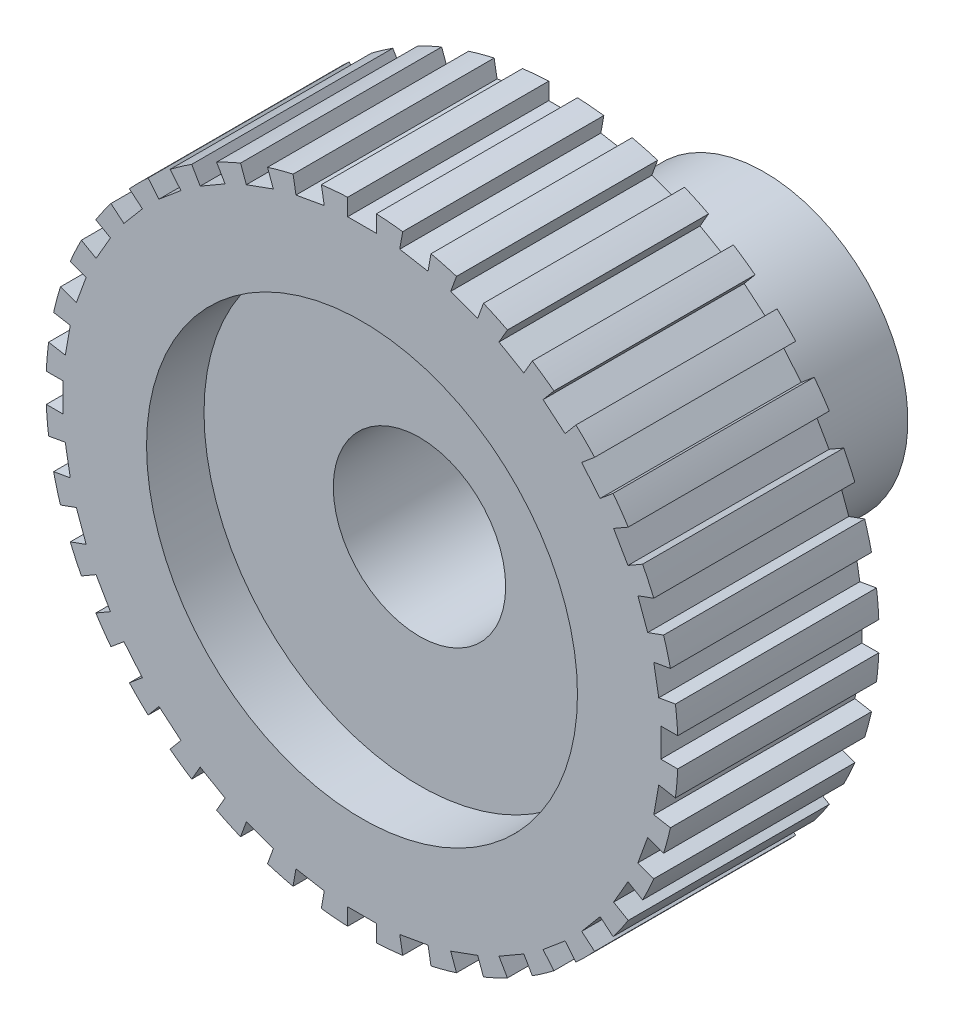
ISO-10303-21;
HEADER;
FILE_DESCRIPTION(('STEP AP214'),'2;1');
FILE_NAME('part.step','',(''),(''),'','','');
FILE_SCHEMA(('AUTOMOTIVE_DESIGN { 1 0 10303 214 1 1 1 1 }'));
ENDSEC;
DATA;
#1=APPLICATION_CONTEXT('core data for automotive mechanical design processes');
#2=APPLICATION_PROTOCOL_DEFINITION('international standard','automotive_design',2000,#1);
#3=PRODUCT_CONTEXT('',#1,'mechanical');
#4=PRODUCT('Part','Part','',(#3));
#5=PRODUCT_RELATED_PRODUCT_CATEGORY('part','',(#4));
#6=PRODUCT_DEFINITION_FORMATION('','',#4);
#7=PRODUCT_DEFINITION_CONTEXT('part definition',#1,'design');
#8=PRODUCT_DEFINITION('design','',#6,#7);
#9=PRODUCT_DEFINITION_SHAPE('','',#8);
#10=(LENGTH_UNIT() NAMED_UNIT(*) SI_UNIT(.MILLI.,.METRE.));
#11=(NAMED_UNIT(*) PLANE_ANGLE_UNIT() SI_UNIT($,.RADIAN.));
#12=(NAMED_UNIT(*) SI_UNIT($,.STERADIAN.) SOLID_ANGLE_UNIT());
#13=UNCERTAINTY_MEASURE_WITH_UNIT(LENGTH_MEASURE(1.E-05),#10,'distance_accuracy_value','');
#14=(GEOMETRIC_REPRESENTATION_CONTEXT(3) GLOBAL_UNCERTAINTY_ASSIGNED_CONTEXT((#13)) GLOBAL_UNIT_ASSIGNED_CONTEXT((#10,
#11,#12)) REPRESENTATION_CONTEXT('',''));
#15=CARTESIAN_POINT('',(0.,0.,0.));
#16=DIRECTION('',(0.,0.,1.));
#17=DIRECTION('',(1.,0.,0.));
#18=AXIS2_PLACEMENT_3D('',#15,#16,#17);
#19=CARTESIAN_POINT('',(0.,0.,7.));
#20=DIRECTION('',(0.,0.,-1.));
#21=DIRECTION('',(-1.,0.,0.));
#22=AXIS2_PLACEMENT_3D('',#19,#20,#21);
#23=CYLINDRICAL_SURFACE('',#22,11.);
#24=CARTESIAN_POINT('',(0.,0.,7.));
#25=DIRECTION('',(0.,0.,1.));
#26=DIRECTION('',(1.,0.,0.));
#27=AXIS2_PLACEMENT_3D('',#24,#25,#26);
#28=CIRCLE('',#27,11.);
#29=CARTESIAN_POINT('',(-2.40055953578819,10.7348644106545,7.));
#30=VERTEX_POINT('',#29);
#31=CARTESIAN_POINT('',(-3.28848666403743,10.4969450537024,7.));
#32=VERTEX_POINT('',#31);
#33=EDGE_CURVE('E1634',#30,#32,#28,.T.);
#34=ORIENTED_EDGE('',*,*,#33,.F.);
#35=DIRECTION('',(0.,0.,-1.));
#36=VECTOR('',#35,1.);
#37=CARTESIAN_POINT('',(-2.40055953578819,10.7348644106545,7.));
#38=LINE('',#37,#36);
#39=CARTESIAN_POINT('',(-2.40055953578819,10.7348644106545,0.));
#40=VERTEX_POINT('',#39);
#41=EDGE_CURVE('E914',#30,#40,#38,.T.);
#42=ORIENTED_EDGE('',*,*,#41,.T.);
#43=CARTESIAN_POINT('',(0.,0.,0.));
#44=DIRECTION('',(0.,0.,1.));
#45=DIRECTION('',(1.,0.,0.));
#46=AXIS2_PLACEMENT_3D('',#43,#44,#45);
#47=CIRCLE('',#46,11.);
#48=CARTESIAN_POINT('',(-3.28848666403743,10.4969450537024,0.));
#49=VERTEX_POINT('',#48);
#50=EDGE_CURVE('E1630',#40,#49,#47,.T.);
#51=ORIENTED_EDGE('',*,*,#50,.T.);
#52=DIRECTION('',(0.,0.,-1.));
#53=VECTOR('',#52,1.);
#54=CARTESIAN_POINT('',(-3.28848666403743,10.4969450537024,7.));
#55=LINE('',#54,#53);
#56=EDGE_CURVE('E949',#49,#32,#55,.F.);
#57=ORIENTED_EDGE('',*,*,#56,.T.);
#58=EDGE_LOOP('',(#34,#42,#51,#57));
#59=FACE_BOUND('',#58,.T.);
#60=ADVANCED_FACE('F28',(#59),#23,.T.);
#61=CARTESIAN_POINT('',(-4.22817928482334,10.1549249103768,7.));
#62=VERTEX_POINT('',#61);
#63=CARTESIAN_POINT('',(-5.06130254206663,9.76643315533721,7.));
#64=VERTEX_POINT('',#63);
#65=EDGE_CURVE('E2085',#62,#64,#28,.T.);
#66=ORIENTED_EDGE('',*,*,#65,.F.);
#67=DIRECTION('',(0.,0.,-1.));
#68=VECTOR('',#67,1.);
#69=CARTESIAN_POINT('',(-4.22817928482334,10.1549249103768,7.));
#70=LINE('',#69,#68);
#71=CARTESIAN_POINT('',(-4.22817928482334,10.1549249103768,0.));
#72=VERTEX_POINT('',#71);
#73=EDGE_CURVE('E952',#62,#72,#70,.T.);
#74=ORIENTED_EDGE('',*,*,#73,.T.);
#75=CARTESIAN_POINT('',(-5.06130254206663,9.76643315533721,0.));
#76=VERTEX_POINT('',#75);
#77=EDGE_CURVE('E2065',#72,#76,#47,.T.);
#78=ORIENTED_EDGE('',*,*,#77,.T.);
#79=DIRECTION('',(0.,0.,-1.));
#80=VECTOR('',#79,1.);
#81=CARTESIAN_POINT('',(-5.06130254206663,9.76643315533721,7.));
#82=LINE('',#81,#80);
#83=EDGE_CURVE('E968',#76,#64,#82,.F.);
#84=ORIENTED_EDGE('',*,*,#83,.T.);
#85=EDGE_LOOP('',(#66,#74,#78,#84));
#86=FACE_BOUND('',#85,.T.);
#87=ADVANCED_FACE('F2086',(#86),#23,.T.);
#88=CARTESIAN_POINT('',(-5.92732794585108,9.26643315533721,7.));
#89=VERTEX_POINT('',#88);
#90=CARTESIAN_POINT('',(-6.68033330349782,8.73917312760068,7.));
#91=VERTEX_POINT('',#90);
#92=EDGE_CURVE('E2087',#89,#91,#28,.T.);
#93=ORIENTED_EDGE('',*,*,#92,.F.);
#94=DIRECTION('',(0.,0.,-1.));
#95=VECTOR('',#94,1.);
#96=CARTESIAN_POINT('',(-5.92732794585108,9.26643315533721,7.));
#97=LINE('',#96,#95);
#98=CARTESIAN_POINT('',(-5.92732794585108,9.26643315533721,0.));
#99=VERTEX_POINT('',#98);
#100=EDGE_CURVE('E971',#89,#99,#97,.T.);
#101=ORIENTED_EDGE('',*,*,#100,.T.);
#102=CARTESIAN_POINT('',(-6.68033330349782,8.73917312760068,0.));
#103=VERTEX_POINT('',#102);
#104=EDGE_CURVE('E2061',#99,#103,#47,.T.);
#105=ORIENTED_EDGE('',*,*,#104,.T.);
#106=DIRECTION('',(0.,0.,-1.));
#107=VECTOR('',#106,1.);
#108=CARTESIAN_POINT('',(-6.68033330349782,8.73917312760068,7.));
#109=LINE('',#108,#107);
#110=EDGE_CURVE('E983',#103,#91,#109,.F.);
#111=ORIENTED_EDGE('',*,*,#110,.T.);
#112=EDGE_LOOP('',(#93,#101,#105,#111));
#113=FACE_BOUND('',#112,.T.);
#114=ADVANCED_FACE('F2567',(#113),#23,.T.);
#115=CARTESIAN_POINT('',(-7.4463777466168,8.09638551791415,7.));
#116=VERTEX_POINT('',#115);
#117=CARTESIAN_POINT('',(-8.09638551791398,7.44637774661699,7.));
#118=VERTEX_POINT('',#117);
#119=EDGE_CURVE('E2088',#116,#118,#28,.T.);
#120=ORIENTED_EDGE('',*,*,#119,.F.);
#121=DIRECTION('',(0.,0.,-1.));
#122=VECTOR('',#121,1.);
#123=CARTESIAN_POINT('',(-7.4463777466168,8.09638551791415,7.));
#124=LINE('',#123,#122);
#125=CARTESIAN_POINT('',(-7.4463777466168,8.09638551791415,0.));
#126=VERTEX_POINT('',#125);
#127=EDGE_CURVE('E990',#116,#126,#124,.T.);
#128=ORIENTED_EDGE('',*,*,#127,.T.);
#129=CARTESIAN_POINT('',(-8.09638551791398,7.44637774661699,0.));
#130=VERTEX_POINT('',#129);
#131=EDGE_CURVE('E2057',#126,#130,#47,.T.);
#132=ORIENTED_EDGE('',*,*,#131,.T.);
#133=DIRECTION('',(0.,0.,-1.));
#134=VECTOR('',#133,1.);
#135=CARTESIAN_POINT('',(-8.09638551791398,7.44637774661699,7.));
#136=LINE('',#135,#134);
#137=EDGE_CURVE('E1006',#130,#118,#136,.F.);
#138=ORIENTED_EDGE('',*,*,#137,.T.);
#139=EDGE_LOOP('',(#120,#128,#132,#138));
#140=FACE_BOUND('',#139,.T.);
#141=ADVANCED_FACE('F2556',(#140),#23,.T.);
#142=CARTESIAN_POINT('',(-8.73917312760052,6.68033330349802,7.));
#143=VERTEX_POINT('',#142);
#144=CARTESIAN_POINT('',(-9.26643315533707,5.9273279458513,7.));
#145=VERTEX_POINT('',#144);
#146=EDGE_CURVE('E2092',#143,#145,#28,.T.);
#147=ORIENTED_EDGE('',*,*,#146,.F.);
#148=DIRECTION('',(0.,0.,-1.));
#149=VECTOR('',#148,1.);
#150=CARTESIAN_POINT('',(-8.73917312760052,6.68033330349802,7.));
#151=LINE('',#150,#149);
#152=CARTESIAN_POINT('',(-8.73917312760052,6.68033330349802,0.));
#153=VERTEX_POINT('',#152);
#154=EDGE_CURVE('E1009',#143,#153,#151,.T.);
#155=ORIENTED_EDGE('',*,*,#154,.T.);
#156=CARTESIAN_POINT('',(-9.26643315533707,5.9273279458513,0.));
#157=VERTEX_POINT('',#156);
#158=EDGE_CURVE('E2053',#153,#157,#47,.T.);
#159=ORIENTED_EDGE('',*,*,#158,.T.);
#160=DIRECTION('',(0.,0.,-1.));
#161=VECTOR('',#160,1.);
#162=CARTESIAN_POINT('',(-9.26643315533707,5.9273279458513,7.));
#163=LINE('',#162,#161);
#164=EDGE_CURVE('E1025',#157,#145,#163,.F.);
#165=ORIENTED_EDGE('',*,*,#164,.T.);
#166=EDGE_LOOP('',(#147,#155,#159,#165));
#167=FACE_BOUND('',#166,.T.);
#168=ADVANCED_FACE('F2545',(#167),#23,.T.);
#169=CARTESIAN_POINT('',(-9.76643315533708,5.06130254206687,7.));
#170=VERTEX_POINT('',#169);
#171=CARTESIAN_POINT('',(-10.1549249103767,4.22817928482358,7.));
#172=VERTEX_POINT('',#171);
#173=EDGE_CURVE('E2096',#170,#172,#28,.T.);
#174=ORIENTED_EDGE('',*,*,#173,.F.);
#175=DIRECTION('',(0.,0.,-1.));
#176=VECTOR('',#175,1.);
#177=CARTESIAN_POINT('',(-9.76643315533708,5.06130254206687,7.));
#178=LINE('',#177,#176);
#179=CARTESIAN_POINT('',(-9.76643315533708,5.06130254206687,0.));
#180=VERTEX_POINT('',#179);
#181=EDGE_CURVE('E1028',#170,#180,#178,.T.);
#182=ORIENTED_EDGE('',*,*,#181,.T.);
#183=CARTESIAN_POINT('',(-10.1549249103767,4.22817928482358,0.));
#184=VERTEX_POINT('',#183);
#185=EDGE_CURVE('E2049',#180,#184,#47,.T.);
#186=ORIENTED_EDGE('',*,*,#185,.T.);
#187=DIRECTION('',(0.,0.,-1.));
#188=VECTOR('',#187,1.);
#189=CARTESIAN_POINT('',(-10.1549249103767,4.22817928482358,7.));
#190=LINE('',#189,#188);
#191=EDGE_CURVE('E1044',#184,#172,#190,.F.);
#192=ORIENTED_EDGE('',*,*,#191,.T.);
#193=EDGE_LOOP('',(#174,#182,#186,#192));
#194=FACE_BOUND('',#193,.T.);
#195=ADVANCED_FACE('F2534',(#194),#23,.T.);
#196=CARTESIAN_POINT('',(-10.4969450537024,3.28848666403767,7.));
#197=VERTEX_POINT('',#196);
#198=CARTESIAN_POINT('',(-10.7348644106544,2.40055953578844,7.));
#199=VERTEX_POINT('',#198);
#200=EDGE_CURVE('E2100',#197,#199,#28,.T.);
#201=ORIENTED_EDGE('',*,*,#200,.F.);
#202=DIRECTION('',(0.,0.,-1.));
#203=VECTOR('',#202,1.);
#204=CARTESIAN_POINT('',(-10.4969450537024,3.28848666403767,7.));
#205=LINE('',#204,#203);
#206=CARTESIAN_POINT('',(-10.4969450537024,3.28848666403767,0.));
#207=VERTEX_POINT('',#206);
#208=EDGE_CURVE('E1047',#197,#207,#205,.T.);
#209=ORIENTED_EDGE('',*,*,#208,.T.);
#210=CARTESIAN_POINT('',(-10.7348644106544,2.40055953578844,0.));
#211=VERTEX_POINT('',#210);
#212=EDGE_CURVE('E2045',#207,#211,#47,.T.);
#213=ORIENTED_EDGE('',*,*,#212,.T.);
#214=DIRECTION('',(0.,0.,-1.));
#215=VECTOR('',#214,1.);
#216=CARTESIAN_POINT('',(-10.7348644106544,2.40055953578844,7.));
#217=LINE('',#216,#215);
#218=EDGE_CURVE('E1063',#211,#199,#217,.F.);
#219=ORIENTED_EDGE('',*,*,#218,.T.);
#220=EDGE_LOOP('',(#201,#209,#213,#219));
#221=FACE_BOUND('',#220,.T.);
#222=ADVANCED_FACE('F2523',(#221),#23,.T.);
#223=CARTESIAN_POINT('',(-10.9085125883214,1.41575178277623,7.));
#224=VERTEX_POINT('',#223);
#225=CARTESIAN_POINT('',(-10.988630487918,0.500000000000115,7.));
#226=VERTEX_POINT('',#225);
#227=EDGE_CURVE('E2104',#224,#226,#28,.T.);
#228=ORIENTED_EDGE('',*,*,#227,.F.);
#229=DIRECTION('',(0.,0.,-1.));
#230=VECTOR('',#229,1.);
#231=CARTESIAN_POINT('',(-10.9085125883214,1.41575178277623,7.));
#232=LINE('',#231,#230);
#233=CARTESIAN_POINT('',(-10.9085125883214,1.41575178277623,0.));
#234=VERTEX_POINT('',#233);
#235=EDGE_CURVE('E1066',#224,#234,#232,.T.);
#236=ORIENTED_EDGE('',*,*,#235,.T.);
#237=CARTESIAN_POINT('',(-10.988630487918,0.500000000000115,0.));
#238=VERTEX_POINT('',#237);
#239=EDGE_CURVE('E2041',#234,#238,#47,.T.);
#240=ORIENTED_EDGE('',*,*,#239,.T.);
#241=DIRECTION('',(0.,0.,-1.));
#242=VECTOR('',#241,1.);
#243=CARTESIAN_POINT('',(-10.988630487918,0.500000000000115,7.));
#244=LINE('',#243,#242);
#245=EDGE_CURVE('E1082',#238,#226,#244,.F.);
#246=ORIENTED_EDGE('',*,*,#245,.T.);
#247=EDGE_LOOP('',(#228,#236,#240,#246));
#248=FACE_BOUND('',#247,.T.);
#249=ADVANCED_FACE('F2512',(#248),#23,.T.);
#250=CARTESIAN_POINT('',(-10.988630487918,-0.499999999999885,7.));
#251=VERTEX_POINT('',#250);
#252=CARTESIAN_POINT('',(-10.9085125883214,-1.41575178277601,7.));
#253=VERTEX_POINT('',#252);
#254=EDGE_CURVE('E2108',#251,#253,#28,.T.);
#255=ORIENTED_EDGE('',*,*,#254,.F.);
#256=DIRECTION('',(0.,0.,-1.));
#257=VECTOR('',#256,1.);
#258=CARTESIAN_POINT('',(-10.988630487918,-0.499999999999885,7.));
#259=LINE('',#258,#257);
#260=CARTESIAN_POINT('',(-10.988630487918,-0.499999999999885,0.));
#261=VERTEX_POINT('',#260);
#262=EDGE_CURVE('E1085',#251,#261,#259,.T.);
#263=ORIENTED_EDGE('',*,*,#262,.T.);
#264=CARTESIAN_POINT('',(-10.9085125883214,-1.41575178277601,0.));
#265=VERTEX_POINT('',#264);
#266=EDGE_CURVE('E2037',#261,#265,#47,.T.);
#267=ORIENTED_EDGE('',*,*,#266,.T.);
#268=DIRECTION('',(0.,0.,-1.));
#269=VECTOR('',#268,1.);
#270=CARTESIAN_POINT('',(-10.9085125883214,-1.41575178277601,7.));
#271=LINE('',#270,#269);
#272=EDGE_CURVE('E1101',#265,#253,#271,.F.);
#273=ORIENTED_EDGE('',*,*,#272,.T.);
#274=EDGE_LOOP('',(#255,#263,#267,#273));
#275=FACE_BOUND('',#274,.T.);
#276=ADVANCED_FACE('F2501',(#275),#23,.T.);
#277=CARTESIAN_POINT('',(-10.7348644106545,-2.40055953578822,7.));
#278=VERTEX_POINT('',#277);
#279=CARTESIAN_POINT('',(-10.4969450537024,-3.28848666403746,7.));
#280=VERTEX_POINT('',#279);
#281=EDGE_CURVE('E2112',#278,#280,#28,.T.);
#282=ORIENTED_EDGE('',*,*,#281,.F.);
#283=DIRECTION('',(0.,0.,-1.));
#284=VECTOR('',#283,1.);
#285=CARTESIAN_POINT('',(-10.7348644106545,-2.40055953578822,7.));
#286=LINE('',#285,#284);
#287=CARTESIAN_POINT('',(-10.7348644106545,-2.40055953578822,0.));
#288=VERTEX_POINT('',#287);
#289=EDGE_CURVE('E1104',#278,#288,#286,.T.);
#290=ORIENTED_EDGE('',*,*,#289,.T.);
#291=CARTESIAN_POINT('',(-10.4969450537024,-3.28848666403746,0.));
#292=VERTEX_POINT('',#291);
#293=EDGE_CURVE('E2033',#288,#292,#47,.T.);
#294=ORIENTED_EDGE('',*,*,#293,.T.);
#295=DIRECTION('',(0.,0.,-1.));
#296=VECTOR('',#295,1.);
#297=CARTESIAN_POINT('',(-10.4969450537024,-3.28848666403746,7.));
#298=LINE('',#297,#296);
#299=EDGE_CURVE('E1120',#292,#280,#298,.F.);
#300=ORIENTED_EDGE('',*,*,#299,.T.);
#301=EDGE_LOOP('',(#282,#290,#294,#300));
#302=FACE_BOUND('',#301,.T.);
#303=ADVANCED_FACE('F2490',(#302),#23,.T.);
#304=CARTESIAN_POINT('',(-10.1549249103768,-4.22817928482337,7.));
#305=VERTEX_POINT('',#304);
#306=CARTESIAN_POINT('',(-9.76643315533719,-5.06130254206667,7.));
#307=VERTEX_POINT('',#306);
#308=EDGE_CURVE('E2116',#305,#307,#28,.T.);
#309=ORIENTED_EDGE('',*,*,#308,.F.);
#310=DIRECTION('',(0.,0.,-1.));
#311=VECTOR('',#310,1.);
#312=CARTESIAN_POINT('',(-10.1549249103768,-4.22817928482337,7.));
#313=LINE('',#312,#311);
#314=CARTESIAN_POINT('',(-10.1549249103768,-4.22817928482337,0.));
#315=VERTEX_POINT('',#314);
#316=EDGE_CURVE('E1123',#305,#315,#313,.T.);
#317=ORIENTED_EDGE('',*,*,#316,.T.);
#318=CARTESIAN_POINT('',(-9.76643315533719,-5.06130254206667,0.));
#319=VERTEX_POINT('',#318);
#320=EDGE_CURVE('E2029',#315,#319,#47,.T.);
#321=ORIENTED_EDGE('',*,*,#320,.T.);
#322=DIRECTION('',(0.,0.,-1.));
#323=VECTOR('',#322,1.);
#324=CARTESIAN_POINT('',(-9.76643315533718,-5.06130254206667,7.));
#325=LINE('',#324,#323);
#326=EDGE_CURVE('E1139',#319,#307,#325,.F.);
#327=ORIENTED_EDGE('',*,*,#326,.T.);
#328=EDGE_LOOP('',(#309,#317,#321,#327));
#329=FACE_BOUND('',#328,.T.);
#330=ADVANCED_FACE('F2479',(#329),#23,.T.);
#331=CARTESIAN_POINT('',(-9.26643315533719,-5.92732794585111,7.));
#332=VERTEX_POINT('',#331);
#333=CARTESIAN_POINT('',(-8.73917312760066,-6.68033330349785,7.));
#334=VERTEX_POINT('',#333);
#335=EDGE_CURVE('E2120',#332,#334,#28,.T.);
#336=ORIENTED_EDGE('',*,*,#335,.F.);
#337=DIRECTION('',(0.,0.,-1.));
#338=VECTOR('',#337,1.);
#339=CARTESIAN_POINT('',(-9.26643315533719,-5.92732794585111,7.));
#340=LINE('',#339,#338);
#341=CARTESIAN_POINT('',(-9.26643315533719,-5.92732794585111,0.));
#342=VERTEX_POINT('',#341);
#343=EDGE_CURVE('E1142',#332,#342,#340,.T.);
#344=ORIENTED_EDGE('',*,*,#343,.T.);
#345=CARTESIAN_POINT('',(-8.73917312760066,-6.68033330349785,0.));
#346=VERTEX_POINT('',#345);
#347=EDGE_CURVE('E2025',#342,#346,#47,.T.);
#348=ORIENTED_EDGE('',*,*,#347,.T.);
#349=DIRECTION('',(0.,0.,-1.));
#350=VECTOR('',#349,1.);
#351=CARTESIAN_POINT('',(-8.73917312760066,-6.68033330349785,7.));
#352=LINE('',#351,#350);
#353=EDGE_CURVE('E1154',#346,#334,#352,.F.);
#354=ORIENTED_EDGE('',*,*,#353,.T.);
#355=EDGE_LOOP('',(#336,#344,#348,#354));
#356=FACE_BOUND('',#355,.T.);
#357=ADVANCED_FACE('F2468',(#356),#23,.T.);
#358=CARTESIAN_POINT('',(-8.09638551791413,-7.44637774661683,7.));
#359=VERTEX_POINT('',#358);
#360=CARTESIAN_POINT('',(-7.44637774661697,-8.096385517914,7.));
#361=VERTEX_POINT('',#360);
#362=EDGE_CURVE('E2124',#359,#361,#28,.T.);
#363=ORIENTED_EDGE('',*,*,#362,.F.);
#364=DIRECTION('',(0.,0.,-1.));
#365=VECTOR('',#364,1.);
#366=CARTESIAN_POINT('',(-8.09638551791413,-7.44637774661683,7.));
#367=LINE('',#366,#365);
#368=CARTESIAN_POINT('',(-8.09638551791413,-7.44637774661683,0.));
#369=VERTEX_POINT('',#368);
#370=EDGE_CURVE('E1161',#359,#369,#367,.T.);
#371=ORIENTED_EDGE('',*,*,#370,.T.);
#372=CARTESIAN_POINT('',(-7.44637774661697,-8.096385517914,0.));
#373=VERTEX_POINT('',#372);
#374=EDGE_CURVE('E2021',#369,#373,#47,.T.);
#375=ORIENTED_EDGE('',*,*,#374,.T.);
#376=DIRECTION('',(0.,0.,-1.));
#377=VECTOR('',#376,1.);
#378=CARTESIAN_POINT('',(-7.44637774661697,-8.096385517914,7.));
#379=LINE('',#378,#377);
#380=EDGE_CURVE('E1177',#373,#361,#379,.F.);
#381=ORIENTED_EDGE('',*,*,#380,.T.);
#382=EDGE_LOOP('',(#363,#371,#375,#381));
#383=FACE_BOUND('',#382,.T.);
#384=ADVANCED_FACE('F2457',(#383),#23,.T.);
#385=CARTESIAN_POINT('',(-6.680333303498,-8.73917312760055,7.));
#386=VERTEX_POINT('',#385);
#387=CARTESIAN_POINT('',(-5.92732794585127,-9.26643315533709,7.));
#388=VERTEX_POINT('',#387);
#389=EDGE_CURVE('E2128',#386,#388,#28,.T.);
#390=ORIENTED_EDGE('',*,*,#389,.F.);
#391=DIRECTION('',(0.,0.,-1.));
#392=VECTOR('',#391,1.);
#393=CARTESIAN_POINT('',(-6.680333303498,-8.73917312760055,7.));
#394=LINE('',#393,#392);
#395=CARTESIAN_POINT('',(-6.680333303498,-8.73917312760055,0.));
#396=VERTEX_POINT('',#395);
#397=EDGE_CURVE('E1180',#386,#396,#394,.T.);
#398=ORIENTED_EDGE('',*,*,#397,.T.);
#399=CARTESIAN_POINT('',(-5.92732794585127,-9.26643315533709,0.));
#400=VERTEX_POINT('',#399);
#401=EDGE_CURVE('E2017',#396,#400,#47,.T.);
#402=ORIENTED_EDGE('',*,*,#401,.T.);
#403=DIRECTION('',(0.,0.,-1.));
#404=VECTOR('',#403,1.);
#405=CARTESIAN_POINT('',(-5.92732794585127,-9.26643315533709,7.));
#406=LINE('',#405,#404);
#407=EDGE_CURVE('E1196',#400,#388,#406,.F.);
#408=ORIENTED_EDGE('',*,*,#407,.T.);
#409=EDGE_LOOP('',(#390,#398,#402,#408));
#410=FACE_BOUND('',#409,.T.);
#411=ADVANCED_FACE('F2446',(#410),#23,.T.);
#412=CARTESIAN_POINT('',(-5.06130254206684,-9.7664331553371,7.));
#413=VERTEX_POINT('',#412);
#414=CARTESIAN_POINT('',(-4.22817928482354,-10.1549249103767,7.));
#415=VERTEX_POINT('',#414);
#416=EDGE_CURVE('E2132',#413,#415,#28,.T.);
#417=ORIENTED_EDGE('',*,*,#416,.F.);
#418=DIRECTION('',(0.,0.,-1.));
#419=VECTOR('',#418,1.);
#420=CARTESIAN_POINT('',(-5.06130254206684,-9.7664331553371,7.));
#421=LINE('',#420,#419);
#422=CARTESIAN_POINT('',(-5.06130254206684,-9.7664331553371,0.));
#423=VERTEX_POINT('',#422);
#424=EDGE_CURVE('E1199',#413,#423,#421,.T.);
#425=ORIENTED_EDGE('',*,*,#424,.T.);
#426=CARTESIAN_POINT('',(-4.22817928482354,-10.1549249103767,0.));
#427=VERTEX_POINT('',#426);
#428=EDGE_CURVE('E2013',#423,#427,#47,.T.);
#429=ORIENTED_EDGE('',*,*,#428,.T.);
#430=DIRECTION('',(0.,0.,-1.));
#431=VECTOR('',#430,1.);
#432=CARTESIAN_POINT('',(-4.22817928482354,-10.1549249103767,7.));
#433=LINE('',#432,#431);
#434=EDGE_CURVE('E1215',#427,#415,#433,.F.);
#435=ORIENTED_EDGE('',*,*,#434,.T.);
#436=EDGE_LOOP('',(#417,#425,#429,#435));
#437=FACE_BOUND('',#436,.T.);
#438=ADVANCED_FACE('F2435',(#437),#23,.T.);
#439=CARTESIAN_POINT('',(-3.28848666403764,-10.4969450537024,7.));
#440=VERTEX_POINT('',#439);
#441=CARTESIAN_POINT('',(-2.40055953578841,-10.7348644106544,7.));
#442=VERTEX_POINT('',#441);
#443=EDGE_CURVE('E2136',#440,#442,#28,.T.);
#444=ORIENTED_EDGE('',*,*,#443,.F.);
#445=DIRECTION('',(0.,0.,-1.));
#446=VECTOR('',#445,1.);
#447=CARTESIAN_POINT('',(-3.28848666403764,-10.4969450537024,7.));
#448=LINE('',#447,#446);
#449=CARTESIAN_POINT('',(-3.28848666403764,-10.4969450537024,0.));
#450=VERTEX_POINT('',#449);
#451=EDGE_CURVE('E1218',#440,#450,#448,.T.);
#452=ORIENTED_EDGE('',*,*,#451,.T.);
#453=CARTESIAN_POINT('',(-2.40055953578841,-10.7348644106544,0.));
#454=VERTEX_POINT('',#453);
#455=EDGE_CURVE('E2009',#450,#454,#47,.T.);
#456=ORIENTED_EDGE('',*,*,#455,.T.);
#457=DIRECTION('',(0.,0.,-1.));
#458=VECTOR('',#457,1.);
#459=CARTESIAN_POINT('',(-2.40055953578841,-10.7348644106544,7.));
#460=LINE('',#459,#458);
#461=EDGE_CURVE('E1234',#454,#442,#460,.F.);
#462=ORIENTED_EDGE('',*,*,#461,.T.);
#463=EDGE_LOOP('',(#444,#452,#456,#462));
#464=FACE_BOUND('',#463,.T.);
#465=ADVANCED_FACE('F2424',(#464),#23,.T.);
#466=CARTESIAN_POINT('',(-1.4157517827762,-10.9085125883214,7.));
#467=VERTEX_POINT('',#466);
#468=CARTESIAN_POINT('',(-0.500000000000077,-10.988630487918,7.));
#469=VERTEX_POINT('',#468);
#470=EDGE_CURVE('E2140',#467,#469,#28,.T.);
#471=ORIENTED_EDGE('',*,*,#470,.F.);
#472=DIRECTION('',(0.,0.,-1.));
#473=VECTOR('',#472,1.);
#474=CARTESIAN_POINT('',(-1.4157517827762,-10.9085125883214,7.));
#475=LINE('',#474,#473);
#476=CARTESIAN_POINT('',(-1.4157517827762,-10.9085125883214,0.));
#477=VERTEX_POINT('',#476);
#478=EDGE_CURVE('E1237',#467,#477,#475,.T.);
#479=ORIENTED_EDGE('',*,*,#478,.T.);
#480=CARTESIAN_POINT('',(-0.500000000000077,-10.988630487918,0.));
#481=VERTEX_POINT('',#480);
#482=EDGE_CURVE('E2005',#477,#481,#47,.T.);
#483=ORIENTED_EDGE('',*,*,#482,.T.);
#484=DIRECTION('',(0.,0.,-1.));
#485=VECTOR('',#484,1.);
#486=CARTESIAN_POINT('',(-0.500000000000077,-10.988630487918,7.));
#487=LINE('',#486,#485);
#488=EDGE_CURVE('E1253',#481,#469,#487,.F.);
#489=ORIENTED_EDGE('',*,*,#488,.T.);
#490=EDGE_LOOP('',(#471,#479,#483,#489));
#491=FACE_BOUND('',#490,.T.);
#492=ADVANCED_FACE('F2413',(#491),#23,.T.);
#493=CARTESIAN_POINT('',(0.499999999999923,-10.988630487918,7.));
#494=VERTEX_POINT('',#493);
#495=CARTESIAN_POINT('',(1.41575178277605,-10.9085125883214,7.));
#496=VERTEX_POINT('',#495);
#497=EDGE_CURVE('E2144',#494,#496,#28,.T.);
#498=ORIENTED_EDGE('',*,*,#497,.F.);
#499=DIRECTION('',(0.,0.,-1.));
#500=VECTOR('',#499,1.);
#501=CARTESIAN_POINT('',(0.499999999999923,-10.988630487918,7.));
#502=LINE('',#501,#500);
#503=CARTESIAN_POINT('',(0.499999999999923,-10.988630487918,0.));
#504=VERTEX_POINT('',#503);
#505=EDGE_CURVE('E1256',#494,#504,#502,.T.);
#506=ORIENTED_EDGE('',*,*,#505,.T.);
#507=CARTESIAN_POINT('',(1.41575178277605,-10.9085125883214,0.));
#508=VERTEX_POINT('',#507);
#509=EDGE_CURVE('E2001',#504,#508,#47,.T.);
#510=ORIENTED_EDGE('',*,*,#509,.T.);
#511=DIRECTION('',(0.,0.,-1.));
#512=VECTOR('',#511,1.);
#513=CARTESIAN_POINT('',(1.41575178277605,-10.9085125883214,7.));
#514=LINE('',#513,#512);
#515=EDGE_CURVE('E1272',#508,#496,#514,.F.);
#516=ORIENTED_EDGE('',*,*,#515,.T.);
#517=EDGE_LOOP('',(#498,#506,#510,#516));
#518=FACE_BOUND('',#517,.T.);
#519=ADVANCED_FACE('F2402',(#518),#23,.T.);
#520=CARTESIAN_POINT('',(2.40055953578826,-10.7348644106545,7.));
#521=VERTEX_POINT('',#520);
#522=CARTESIAN_POINT('',(3.2884866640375,-10.4969450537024,7.));
#523=VERTEX_POINT('',#522);
#524=EDGE_CURVE('E2148',#521,#523,#28,.T.);
#525=ORIENTED_EDGE('',*,*,#524,.F.);
#526=DIRECTION('',(0.,0.,-1.));
#527=VECTOR('',#526,1.);
#528=CARTESIAN_POINT('',(2.40055953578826,-10.7348644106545,7.));
#529=LINE('',#528,#527);
#530=CARTESIAN_POINT('',(2.40055953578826,-10.7348644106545,0.));
#531=VERTEX_POINT('',#530);
#532=EDGE_CURVE('E1275',#521,#531,#529,.T.);
#533=ORIENTED_EDGE('',*,*,#532,.T.);
#534=CARTESIAN_POINT('',(3.2884866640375,-10.4969450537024,0.));
#535=VERTEX_POINT('',#534);
#536=EDGE_CURVE('E1997',#531,#535,#47,.T.);
#537=ORIENTED_EDGE('',*,*,#536,.T.);
#538=DIRECTION('',(0.,0.,-1.));
#539=VECTOR('',#538,1.);
#540=CARTESIAN_POINT('',(3.2884866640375,-10.4969450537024,7.));
#541=LINE('',#540,#539);
#542=EDGE_CURVE('E1291',#535,#523,#541,.F.);
#543=ORIENTED_EDGE('',*,*,#542,.T.);
#544=EDGE_LOOP('',(#525,#533,#537,#543));
#545=FACE_BOUND('',#544,.T.);
#546=ADVANCED_FACE('F2391',(#545),#23,.T.);
#547=CARTESIAN_POINT('',(4.2281792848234,-10.1549249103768,7.));
#548=VERTEX_POINT('',#547);
#549=CARTESIAN_POINT('',(5.0613025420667,-9.76643315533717,7.));
#550=VERTEX_POINT('',#549);
#551=EDGE_CURVE('E2152',#548,#550,#28,.T.);
#552=ORIENTED_EDGE('',*,*,#551,.F.);
#553=DIRECTION('',(0.,0.,-1.));
#554=VECTOR('',#553,1.);
#555=CARTESIAN_POINT('',(4.2281792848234,-10.1549249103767,7.));
#556=LINE('',#555,#554);
#557=CARTESIAN_POINT('',(4.2281792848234,-10.1549249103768,0.));
#558=VERTEX_POINT('',#557);
#559=EDGE_CURVE('E1294',#548,#558,#556,.T.);
#560=ORIENTED_EDGE('',*,*,#559,.T.);
#561=CARTESIAN_POINT('',(5.0613025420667,-9.76643315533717,0.));
#562=VERTEX_POINT('',#561);
#563=EDGE_CURVE('E1993',#558,#562,#47,.T.);
#564=ORIENTED_EDGE('',*,*,#563,.T.);
#565=DIRECTION('',(0.,0.,-1.));
#566=VECTOR('',#565,1.);
#567=CARTESIAN_POINT('',(5.0613025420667,-9.76643315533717,7.));
#568=LINE('',#567,#566);
#569=EDGE_CURVE('E1310',#562,#550,#568,.F.);
#570=ORIENTED_EDGE('',*,*,#569,.T.);
#571=EDGE_LOOP('',(#552,#560,#564,#570));
#572=FACE_BOUND('',#571,.T.);
#573=ADVANCED_FACE('F2380',(#572),#23,.T.);
#574=CARTESIAN_POINT('',(5.92732794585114,-9.26643315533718,7.));
#575=VERTEX_POINT('',#574);
#576=CARTESIAN_POINT('',(6.68033330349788,-8.73917312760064,7.));
#577=VERTEX_POINT('',#576);
#578=EDGE_CURVE('E2156',#575,#577,#28,.T.);
#579=ORIENTED_EDGE('',*,*,#578,.F.);
#580=DIRECTION('',(0.,0.,-1.));
#581=VECTOR('',#580,1.);
#582=CARTESIAN_POINT('',(5.92732794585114,-9.26643315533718,7.));
#583=LINE('',#582,#581);
#584=CARTESIAN_POINT('',(5.92732794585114,-9.26643315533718,0.));
#585=VERTEX_POINT('',#584);
#586=EDGE_CURVE('E1313',#575,#585,#583,.T.);
#587=ORIENTED_EDGE('',*,*,#586,.T.);
#588=CARTESIAN_POINT('',(6.68033330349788,-8.73917312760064,0.));
#589=VERTEX_POINT('',#588);
#590=EDGE_CURVE('E1989',#585,#589,#47,.T.);
#591=ORIENTED_EDGE('',*,*,#590,.T.);
#592=DIRECTION('',(0.,0.,-1.));
#593=VECTOR('',#592,1.);
#594=CARTESIAN_POINT('',(6.68033330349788,-8.73917312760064,7.));
#595=LINE('',#594,#593);
#596=EDGE_CURVE('E1325',#589,#577,#595,.F.);
#597=ORIENTED_EDGE('',*,*,#596,.T.);
#598=EDGE_LOOP('',(#579,#587,#591,#597));
#599=FACE_BOUND('',#598,.T.);
#600=ADVANCED_FACE('F2369',(#599),#23,.T.);
#601=CARTESIAN_POINT('',(7.44637774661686,-8.0963855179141,7.));
#602=VERTEX_POINT('',#601);
#603=CARTESIAN_POINT('',(8.09638551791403,-7.44637774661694,7.));
#604=VERTEX_POINT('',#603);
#605=EDGE_CURVE('E2160',#602,#604,#28,.T.);
#606=ORIENTED_EDGE('',*,*,#605,.F.);
#607=DIRECTION('',(0.,0.,-1.));
#608=VECTOR('',#607,1.);
#609=CARTESIAN_POINT('',(7.44637774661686,-8.0963855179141,7.));
#610=LINE('',#609,#608);
#611=CARTESIAN_POINT('',(7.44637774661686,-8.0963855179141,0.));
#612=VERTEX_POINT('',#611);
#613=EDGE_CURVE('E1332',#602,#612,#610,.T.);
#614=ORIENTED_EDGE('',*,*,#613,.T.);
#615=CARTESIAN_POINT('',(8.09638551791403,-7.44637774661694,0.));
#616=VERTEX_POINT('',#615);
#617=EDGE_CURVE('E1985',#612,#616,#47,.T.);
#618=ORIENTED_EDGE('',*,*,#617,.T.);
#619=DIRECTION('',(0.,0.,-1.));
#620=VECTOR('',#619,1.);
#621=CARTESIAN_POINT('',(8.09638551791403,-7.44637774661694,7.));
#622=LINE('',#621,#620);
#623=EDGE_CURVE('E1348',#616,#604,#622,.F.);
#624=ORIENTED_EDGE('',*,*,#623,.T.);
#625=EDGE_LOOP('',(#606,#614,#618,#624));
#626=FACE_BOUND('',#625,.T.);
#627=ADVANCED_FACE('F2358',(#626),#23,.T.);
#628=CARTESIAN_POINT('',(8.73917312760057,-6.68033330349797,7.));
#629=VERTEX_POINT('',#628);
#630=CARTESIAN_POINT('',(9.26643315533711,-5.92732794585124,7.));
#631=VERTEX_POINT('',#630);
#632=EDGE_CURVE('E2164',#629,#631,#28,.T.);
#633=ORIENTED_EDGE('',*,*,#632,.F.);
#634=DIRECTION('',(0.,0.,-1.));
#635=VECTOR('',#634,1.);
#636=CARTESIAN_POINT('',(8.73917312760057,-6.68033330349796,7.));
#637=LINE('',#636,#635);
#638=CARTESIAN_POINT('',(8.73917312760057,-6.68033330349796,0.));
#639=VERTEX_POINT('',#638);
#640=EDGE_CURVE('E1351',#629,#639,#637,.T.);
#641=ORIENTED_EDGE('',*,*,#640,.T.);
#642=CARTESIAN_POINT('',(9.26643315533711,-5.92732794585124,0.));
#643=VERTEX_POINT('',#642);
#644=EDGE_CURVE('E1981',#639,#643,#47,.T.);
#645=ORIENTED_EDGE('',*,*,#644,.T.);
#646=DIRECTION('',(0.,0.,-1.));
#647=VECTOR('',#646,1.);
#648=CARTESIAN_POINT('',(9.26643315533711,-5.92732794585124,7.));
#649=LINE('',#648,#647);
#650=EDGE_CURVE('E1367',#643,#631,#649,.F.);
#651=ORIENTED_EDGE('',*,*,#650,.T.);
#652=EDGE_LOOP('',(#633,#641,#645,#651));
#653=FACE_BOUND('',#652,.T.);
#654=ADVANCED_FACE('F2347',(#653),#23,.T.);
#655=CARTESIAN_POINT('',(9.76643315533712,-5.0613025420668,7.));
#656=VERTEX_POINT('',#655);
#657=CARTESIAN_POINT('',(10.1549249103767,-4.22817928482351,7.));
#658=VERTEX_POINT('',#657);
#659=EDGE_CURVE('E2168',#656,#658,#28,.T.);
#660=ORIENTED_EDGE('',*,*,#659,.F.);
#661=DIRECTION('',(0.,0.,-1.));
#662=VECTOR('',#661,1.);
#663=CARTESIAN_POINT('',(9.76643315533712,-5.0613025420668,7.));
#664=LINE('',#663,#662);
#665=CARTESIAN_POINT('',(9.76643315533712,-5.0613025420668,0.));
#666=VERTEX_POINT('',#665);
#667=EDGE_CURVE('E1370',#656,#666,#664,.T.);
#668=ORIENTED_EDGE('',*,*,#667,.T.);
#669=CARTESIAN_POINT('',(10.1549249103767,-4.22817928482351,0.));
#670=VERTEX_POINT('',#669);
#671=EDGE_CURVE('E1977',#666,#670,#47,.T.);
#672=ORIENTED_EDGE('',*,*,#671,.T.);
#673=DIRECTION('',(0.,0.,-1.));
#674=VECTOR('',#673,1.);
#675=CARTESIAN_POINT('',(10.1549249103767,-4.22817928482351,7.));
#676=LINE('',#675,#674);
#677=EDGE_CURVE('E1386',#670,#658,#676,.F.);
#678=ORIENTED_EDGE('',*,*,#677,.T.);
#679=EDGE_LOOP('',(#660,#668,#672,#678));
#680=FACE_BOUND('',#679,.T.);
#681=ADVANCED_FACE('F2336',(#680),#23,.T.);
#682=CARTESIAN_POINT('',(10.4969450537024,-3.2884866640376,7.));
#683=VERTEX_POINT('',#682);
#684=CARTESIAN_POINT('',(10.7348644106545,-2.40055953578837,7.));
#685=VERTEX_POINT('',#684);
#686=EDGE_CURVE('E2172',#683,#685,#28,.T.);
#687=ORIENTED_EDGE('',*,*,#686,.F.);
#688=DIRECTION('',(0.,0.,-1.));
#689=VECTOR('',#688,1.);
#690=CARTESIAN_POINT('',(10.4969450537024,-3.2884866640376,7.));
#691=LINE('',#690,#689);
#692=CARTESIAN_POINT('',(10.4969450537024,-3.2884866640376,0.));
#693=VERTEX_POINT('',#692);
#694=EDGE_CURVE('E1389',#683,#693,#691,.T.);
#695=ORIENTED_EDGE('',*,*,#694,.T.);
#696=CARTESIAN_POINT('',(10.7348644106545,-2.40055953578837,0.));
#697=VERTEX_POINT('',#696);
#698=EDGE_CURVE('E1973',#693,#697,#47,.T.);
#699=ORIENTED_EDGE('',*,*,#698,.T.);
#700=DIRECTION('',(0.,0.,-1.));
#701=VECTOR('',#700,1.);
#702=CARTESIAN_POINT('',(10.7348644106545,-2.40055953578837,7.));
#703=LINE('',#702,#701);
#704=EDGE_CURVE('E1405',#697,#685,#703,.F.);
#705=ORIENTED_EDGE('',*,*,#704,.T.);
#706=EDGE_LOOP('',(#687,#695,#699,#705));
#707=FACE_BOUND('',#706,.T.);
#708=ADVANCED_FACE('F2325',(#707),#23,.T.);
#709=CARTESIAN_POINT('',(10.9085125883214,-1.41575178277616,7.));
#710=VERTEX_POINT('',#709);
#711=CARTESIAN_POINT('',(10.988630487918,-0.500000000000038,7.));
#712=VERTEX_POINT('',#711);
#713=EDGE_CURVE('E2176',#710,#712,#28,.T.);
#714=ORIENTED_EDGE('',*,*,#713,.F.);
#715=DIRECTION('',(0.,0.,-1.));
#716=VECTOR('',#715,1.);
#717=CARTESIAN_POINT('',(10.9085125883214,-1.41575178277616,7.));
#718=LINE('',#717,#716);
#719=CARTESIAN_POINT('',(10.9085125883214,-1.41575178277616,0.));
#720=VERTEX_POINT('',#719);
#721=EDGE_CURVE('E1408',#710,#720,#718,.T.);
#722=ORIENTED_EDGE('',*,*,#721,.T.);
#723=CARTESIAN_POINT('',(10.988630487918,-0.500000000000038,0.));
#724=VERTEX_POINT('',#723);
#725=EDGE_CURVE('E1969',#720,#724,#47,.T.);
#726=ORIENTED_EDGE('',*,*,#725,.T.);
#727=DIRECTION('',(0.,0.,-1.));
#728=VECTOR('',#727,1.);
#729=CARTESIAN_POINT('',(10.988630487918,-0.500000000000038,7.));
#730=LINE('',#729,#728);
#731=EDGE_CURVE('E1424',#724,#712,#730,.F.);
#732=ORIENTED_EDGE('',*,*,#731,.T.);
#733=EDGE_LOOP('',(#714,#722,#726,#732));
#734=FACE_BOUND('',#733,.T.);
#735=ADVANCED_FACE('F2314',(#734),#23,.T.);
#736=CARTESIAN_POINT('',(10.988630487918,0.499999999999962,7.));
#737=VERTEX_POINT('',#736);
#738=CARTESIAN_POINT('',(10.9085125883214,1.41575178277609,7.));
#739=VERTEX_POINT('',#738);
#740=EDGE_CURVE('E2180',#737,#739,#28,.T.);
#741=ORIENTED_EDGE('',*,*,#740,.F.);
#742=DIRECTION('',(0.,0.,-1.));
#743=VECTOR('',#742,1.);
#744=CARTESIAN_POINT('',(10.988630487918,0.499999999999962,7.));
#745=LINE('',#744,#743);
#746=CARTESIAN_POINT('',(10.988630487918,0.499999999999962,0.));
#747=VERTEX_POINT('',#746);
#748=EDGE_CURVE('E1427',#737,#747,#745,.T.);
#749=ORIENTED_EDGE('',*,*,#748,.T.);
#750=CARTESIAN_POINT('',(10.9085125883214,1.41575178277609,0.));
#751=VERTEX_POINT('',#750);
#752=EDGE_CURVE('E1965',#747,#751,#47,.T.);
#753=ORIENTED_EDGE('',*,*,#752,.T.);
#754=DIRECTION('',(0.,0.,-1.));
#755=VECTOR('',#754,1.);
#756=CARTESIAN_POINT('',(10.9085125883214,1.41575178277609,7.));
#757=LINE('',#756,#755);
#758=EDGE_CURVE('E1443',#751,#739,#757,.F.);
#759=ORIENTED_EDGE('',*,*,#758,.T.);
#760=EDGE_LOOP('',(#741,#749,#753,#759));
#761=FACE_BOUND('',#760,.T.);
#762=ADVANCED_FACE('F2303',(#761),#23,.T.);
#763=CARTESIAN_POINT('',(10.7348644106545,2.4005595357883,7.));
#764=VERTEX_POINT('',#763);
#765=CARTESIAN_POINT('',(10.4969450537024,3.28848666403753,7.));
#766=VERTEX_POINT('',#765);
#767=EDGE_CURVE('E2184',#764,#766,#28,.T.);
#768=ORIENTED_EDGE('',*,*,#767,.F.);
#769=DIRECTION('',(0.,0.,-1.));
#770=VECTOR('',#769,1.);
#771=CARTESIAN_POINT('',(10.7348644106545,2.4005595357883,7.));
#772=LINE('',#771,#770);
#773=CARTESIAN_POINT('',(10.7348644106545,2.4005595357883,0.));
#774=VERTEX_POINT('',#773);
#775=EDGE_CURVE('E1446',#764,#774,#772,.T.);
#776=ORIENTED_EDGE('',*,*,#775,.T.);
#777=CARTESIAN_POINT('',(10.4969450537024,3.28848666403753,0.));
#778=VERTEX_POINT('',#777);
#779=EDGE_CURVE('E1961',#774,#778,#47,.T.);
#780=ORIENTED_EDGE('',*,*,#779,.T.);
#781=DIRECTION('',(0.,0.,-1.));
#782=VECTOR('',#781,1.);
#783=CARTESIAN_POINT('',(10.4969450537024,3.28848666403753,7.));
#784=LINE('',#783,#782);
#785=EDGE_CURVE('E1462',#778,#766,#784,.F.);
#786=ORIENTED_EDGE('',*,*,#785,.T.);
#787=EDGE_LOOP('',(#768,#776,#780,#786));
#788=FACE_BOUND('',#787,.T.);
#789=ADVANCED_FACE('F2292',(#788),#23,.T.);
#790=CARTESIAN_POINT('',(10.1549249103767,4.22817928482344,7.));
#791=VERTEX_POINT('',#790);
#792=CARTESIAN_POINT('',(9.76643315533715,5.06130254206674,7.));
#793=VERTEX_POINT('',#792);
#794=EDGE_CURVE('E2188',#791,#793,#28,.T.);
#795=ORIENTED_EDGE('',*,*,#794,.F.);
#796=DIRECTION('',(0.,0.,-1.));
#797=VECTOR('',#796,1.);
#798=CARTESIAN_POINT('',(10.1549249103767,4.22817928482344,7.));
#799=LINE('',#798,#797);
#800=CARTESIAN_POINT('',(10.1549249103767,4.22817928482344,0.));
#801=VERTEX_POINT('',#800);
#802=EDGE_CURVE('E1465',#791,#801,#799,.T.);
#803=ORIENTED_EDGE('',*,*,#802,.T.);
#804=CARTESIAN_POINT('',(9.76643315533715,5.06130254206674,0.));
#805=VERTEX_POINT('',#804);
#806=EDGE_CURVE('E1957',#801,#805,#47,.T.);
#807=ORIENTED_EDGE('',*,*,#806,.T.);
#808=DIRECTION('',(0.,0.,-1.));
#809=VECTOR('',#808,1.);
#810=CARTESIAN_POINT('',(9.76643315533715,5.06130254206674,7.));
#811=LINE('',#810,#809);
#812=EDGE_CURVE('E1481',#805,#793,#811,.F.);
#813=ORIENTED_EDGE('',*,*,#812,.T.);
#814=EDGE_LOOP('',(#795,#803,#807,#813));
#815=FACE_BOUND('',#814,.T.);
#816=ADVANCED_FACE('F2281',(#815),#23,.T.);
#817=CARTESIAN_POINT('',(9.26643315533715,5.92732794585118,7.));
#818=VERTEX_POINT('',#817);
#819=CARTESIAN_POINT('',(8.73917312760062,6.68033330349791,7.));
#820=VERTEX_POINT('',#819);
#821=EDGE_CURVE('E2192',#818,#820,#28,.T.);
#822=ORIENTED_EDGE('',*,*,#821,.F.);
#823=DIRECTION('',(0.,0.,-1.));
#824=VECTOR('',#823,1.);
#825=CARTESIAN_POINT('',(9.26643315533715,5.92732794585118,7.));
#826=LINE('',#825,#824);
#827=CARTESIAN_POINT('',(9.26643315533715,5.92732794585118,0.));
#828=VERTEX_POINT('',#827);
#829=EDGE_CURVE('E1484',#818,#828,#826,.T.);
#830=ORIENTED_EDGE('',*,*,#829,.T.);
#831=CARTESIAN_POINT('',(8.73917312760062,6.68033330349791,0.));
#832=VERTEX_POINT('',#831);
#833=EDGE_CURVE('E1953',#828,#832,#47,.T.);
#834=ORIENTED_EDGE('',*,*,#833,.T.);
#835=DIRECTION('',(0.,0.,-1.));
#836=VECTOR('',#835,1.);
#837=CARTESIAN_POINT('',(8.73917312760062,6.68033330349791,7.));
#838=LINE('',#837,#836);
#839=EDGE_CURVE('E1496',#832,#820,#838,.F.);
#840=ORIENTED_EDGE('',*,*,#839,.T.);
#841=EDGE_LOOP('',(#822,#830,#834,#840));
#842=FACE_BOUND('',#841,.T.);
#843=ADVANCED_FACE('F2270',(#842),#23,.T.);
#844=CARTESIAN_POINT('',(8.09638551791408,7.44637774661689,7.));
#845=VERTEX_POINT('',#844);
#846=CARTESIAN_POINT('',(7.44637774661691,8.09638551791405,7.));
#847=VERTEX_POINT('',#846);
#848=EDGE_CURVE('E2196',#845,#847,#28,.T.);
#849=ORIENTED_EDGE('',*,*,#848,.F.);
#850=DIRECTION('',(0.,0.,-1.));
#851=VECTOR('',#850,1.);
#852=CARTESIAN_POINT('',(8.09638551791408,7.44637774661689,7.));
#853=LINE('',#852,#851);
#854=CARTESIAN_POINT('',(8.09638551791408,7.44637774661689,0.));
#855=VERTEX_POINT('',#854);
#856=EDGE_CURVE('E1503',#845,#855,#853,.T.);
#857=ORIENTED_EDGE('',*,*,#856,.T.);
#858=CARTESIAN_POINT('',(7.44637774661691,8.09638551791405,0.));
#859=VERTEX_POINT('',#858);
#860=EDGE_CURVE('E1949',#855,#859,#47,.T.);
#861=ORIENTED_EDGE('',*,*,#860,.T.);
#862=DIRECTION('',(0.,0.,-1.));
#863=VECTOR('',#862,1.);
#864=CARTESIAN_POINT('',(7.44637774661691,8.09638551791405,7.));
#865=LINE('',#864,#863);
#866=EDGE_CURVE('E1519',#859,#847,#865,.F.);
#867=ORIENTED_EDGE('',*,*,#866,.T.);
#868=EDGE_LOOP('',(#849,#857,#861,#867));
#869=FACE_BOUND('',#868,.T.);
#870=ADVANCED_FACE('F2259',(#869),#23,.T.);
#871=CARTESIAN_POINT('',(6.68033330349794,8.73917312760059,7.));
#872=VERTEX_POINT('',#871);
#873=CARTESIAN_POINT('',(5.92732794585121,9.26643315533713,7.));
#874=VERTEX_POINT('',#873);
#875=EDGE_CURVE('E2200',#872,#874,#28,.T.);
#876=ORIENTED_EDGE('',*,*,#875,.F.);
#877=DIRECTION('',(0.,0.,-1.));
#878=VECTOR('',#877,1.);
#879=CARTESIAN_POINT('',(6.68033330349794,8.73917312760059,7.));
#880=LINE('',#879,#878);
#881=CARTESIAN_POINT('',(6.68033330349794,8.73917312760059,0.));
#882=VERTEX_POINT('',#881);
#883=EDGE_CURVE('E1522',#872,#882,#880,.T.);
#884=ORIENTED_EDGE('',*,*,#883,.T.);
#885=CARTESIAN_POINT('',(5.92732794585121,9.26643315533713,0.));
#886=VERTEX_POINT('',#885);
#887=EDGE_CURVE('E1945',#882,#886,#47,.T.);
#888=ORIENTED_EDGE('',*,*,#887,.T.);
#889=DIRECTION('',(0.,0.,-1.));
#890=VECTOR('',#889,1.);
#891=CARTESIAN_POINT('',(5.92732794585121,9.26643315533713,7.));
#892=LINE('',#891,#890);
#893=EDGE_CURVE('E1538',#886,#874,#892,.F.);
#894=ORIENTED_EDGE('',*,*,#893,.T.);
#895=EDGE_LOOP('',(#876,#884,#888,#894));
#896=FACE_BOUND('',#895,.T.);
#897=ADVANCED_FACE('F2248',(#896),#23,.T.);
#898=CARTESIAN_POINT('',(5.06130254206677,9.76643315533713,7.));
#899=VERTEX_POINT('',#898);
#900=CARTESIAN_POINT('',(4.22817928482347,10.1549249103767,7.));
#901=VERTEX_POINT('',#900);
#902=EDGE_CURVE('E2204',#899,#901,#28,.T.);
#903=ORIENTED_EDGE('',*,*,#902,.F.);
#904=DIRECTION('',(0.,0.,-1.));
#905=VECTOR('',#904,1.);
#906=CARTESIAN_POINT('',(5.06130254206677,9.76643315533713,7.));
#907=LINE('',#906,#905);
#908=CARTESIAN_POINT('',(5.06130254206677,9.76643315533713,0.));
#909=VERTEX_POINT('',#908);
#910=EDGE_CURVE('E1541',#899,#909,#907,.T.);
#911=ORIENTED_EDGE('',*,*,#910,.T.);
#912=CARTESIAN_POINT('',(4.22817928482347,10.1549249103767,0.));
#913=VERTEX_POINT('',#912);
#914=EDGE_CURVE('E1941',#909,#913,#47,.T.);
#915=ORIENTED_EDGE('',*,*,#914,.T.);
#916=DIRECTION('',(0.,0.,-1.));
#917=VECTOR('',#916,1.);
#918=CARTESIAN_POINT('',(4.22817928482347,10.1549249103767,7.));
#919=LINE('',#918,#917);
#920=EDGE_CURVE('E1557',#913,#901,#919,.F.);
#921=ORIENTED_EDGE('',*,*,#920,.T.);
#922=EDGE_LOOP('',(#903,#911,#915,#921));
#923=FACE_BOUND('',#922,.T.);
#924=ADVANCED_FACE('F2237',(#923),#23,.T.);
#925=CARTESIAN_POINT('',(3.28848666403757,10.4969450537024,7.));
#926=VERTEX_POINT('',#925);
#927=CARTESIAN_POINT('',(2.40055953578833,10.7348644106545,7.));
#928=VERTEX_POINT('',#927);
#929=EDGE_CURVE('E2208',#926,#928,#28,.T.);
#930=ORIENTED_EDGE('',*,*,#929,.F.);
#931=DIRECTION('',(0.,0.,-1.));
#932=VECTOR('',#931,1.);
#933=CARTESIAN_POINT('',(3.28848666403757,10.4969450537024,7.));
#934=LINE('',#933,#932);
#935=CARTESIAN_POINT('',(3.28848666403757,10.4969450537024,0.));
#936=VERTEX_POINT('',#935);
#937=EDGE_CURVE('E1560',#926,#936,#934,.T.);
#938=ORIENTED_EDGE('',*,*,#937,.T.);
#939=CARTESIAN_POINT('',(2.40055953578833,10.7348644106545,0.));
#940=VERTEX_POINT('',#939);
#941=EDGE_CURVE('E1940',#936,#940,#47,.T.);
#942=ORIENTED_EDGE('',*,*,#941,.T.);
#943=DIRECTION('',(0.,0.,-1.));
#944=VECTOR('',#943,1.);
#945=CARTESIAN_POINT('',(2.40055953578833,10.7348644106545,7.));
#946=LINE('',#945,#944);
#947=EDGE_CURVE('E1576',#940,#928,#946,.F.);
#948=ORIENTED_EDGE('',*,*,#947,.T.);
#949=EDGE_LOOP('',(#930,#938,#942,#948));
#950=FACE_BOUND('',#949,.T.);
#951=ADVANCED_FACE('F2226',(#950),#23,.T.);
#952=CARTESIAN_POINT('',(1.41575178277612,10.9085125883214,7.));
#953=VERTEX_POINT('',#952);
#954=CARTESIAN_POINT('',(0.5,10.988630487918,7.));
#955=VERTEX_POINT('',#954);
#956=EDGE_CURVE('E1629',#953,#955,#28,.T.);
#957=ORIENTED_EDGE('',*,*,#956,.F.);
#958=DIRECTION('',(0.,0.,-1.));
#959=VECTOR('',#958,1.);
#960=CARTESIAN_POINT('',(1.41575178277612,10.9085125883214,7.));
#961=LINE('',#960,#959);
#962=CARTESIAN_POINT('',(1.41575178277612,10.9085125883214,0.));
#963=VERTEX_POINT('',#962);
#964=EDGE_CURVE('E1579',#953,#963,#961,.T.);
#965=ORIENTED_EDGE('',*,*,#964,.T.);
#966=CARTESIAN_POINT('',(0.5,10.988630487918,0.));
#967=VERTEX_POINT('',#966);
#968=EDGE_CURVE('E1625',#963,#967,#47,.T.);
#969=ORIENTED_EDGE('',*,*,#968,.T.);
#970=DIRECTION('',(0.,0.,-1.));
#971=VECTOR('',#970,1.);
#972=CARTESIAN_POINT('',(0.5,10.988630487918,7.));
#973=LINE('',#972,#971);
#974=EDGE_CURVE('E1595',#967,#955,#973,.F.);
#975=ORIENTED_EDGE('',*,*,#974,.T.);
#976=EDGE_LOOP('',(#957,#965,#969,#975));
#977=FACE_BOUND('',#976,.T.);
#978=ADVANCED_FACE('F1939',(#977),#23,.T.);
#979=CARTESIAN_POINT('',(0.,0.,1.));
#980=DIRECTION('',(0.,0.,-1.));
#981=DIRECTION('',(-1.,0.,0.));
#982=AXIS2_PLACEMENT_3D('',#979,#980,#981);
#983=PLANE('',#982);
#984=CARTESIAN_POINT('',(0.,0.,1.));
#985=DIRECTION('',(0.,0.,-1.));
#986=DIRECTION('',(-1.,0.,0.));
#987=AXIS2_PLACEMENT_3D('',#984,#985,#986);
#988=CIRCLE('',#987,7.5);
#989=CARTESIAN_POINT('',(-7.5,0.,1.));
#990=VERTEX_POINT('',#989);
#991=EDGE_CURVE('E1616',#990,#990,#988,.T.);
#992=ORIENTED_EDGE('',*,*,#991,.T.);
#993=EDGE_LOOP('',(#992));
#994=FACE_BOUND('',#993,.T.);
#995=CARTESIAN_POINT('',(0.,0.,1.));
#996=DIRECTION('',(0.,0.,-1.));
#997=DIRECTION('',(-1.,0.,0.));
#998=AXIS2_PLACEMENT_3D('',#995,#996,#997);
#999=CIRCLE('',#998,5.);
#1000=CARTESIAN_POINT('',(-5.,0.,1.));
#1001=VERTEX_POINT('',#1000);
#1002=EDGE_CURVE('E1607',#1001,#1001,#999,.T.);
#1003=ORIENTED_EDGE('',*,*,#1002,.F.);
#1004=EDGE_LOOP('',(#1003));
#1005=FACE_BOUND('',#1004,.T.);
#1006=ADVANCED_FACE('F2592',(#994,#1005),#983,.T.);
#1007=CARTESIAN_POINT('',(-0.5,10.988630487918,0.));
#1008=VERTEX_POINT('',#1007);
#1009=CARTESIAN_POINT('',(-1.41575178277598,10.9085125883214,0.));
#1010=VERTEX_POINT('',#1009);
#1011=EDGE_CURVE('E1626',#1008,#1010,#47,.T.);
#1012=ORIENTED_EDGE('',*,*,#1011,.T.);
#1013=DIRECTION('',(0.,0.,-1.));
#1014=VECTOR('',#1013,1.);
#1015=CARTESIAN_POINT('',(-1.41575178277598,10.9085125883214,7.));
#1016=LINE('',#1015,#1014);
#1017=CARTESIAN_POINT('',(-1.41575178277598,10.9085125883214,7.));
#1018=VERTEX_POINT('',#1017);
#1019=EDGE_CURVE('E933',#1010,#1018,#1016,.F.);
#1020=ORIENTED_EDGE('',*,*,#1019,.T.);
#1021=CARTESIAN_POINT('',(-0.5,10.988630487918,7.));
#1022=VERTEX_POINT('',#1021);
#1023=EDGE_CURVE('E1631',#1022,#1018,#28,.T.);
#1024=ORIENTED_EDGE('',*,*,#1023,.F.);
#1025=DIRECTION('',(0.,0.,-1.));
#1026=VECTOR('',#1025,1.);
#1027=CARTESIAN_POINT('',(-0.5,10.988630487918,7.));
#1028=LINE('',#1027,#1026);
#1029=EDGE_CURVE('E1598',#1022,#1008,#1028,.T.);
#1030=ORIENTED_EDGE('',*,*,#1029,.T.);
#1031=EDGE_LOOP('',(#1012,#1020,#1024,#1030));
#1032=FACE_BOUND('',#1031,.T.);
#1033=ADVANCED_FACE('F30',(#1032),#23,.T.);
#1034=CARTESIAN_POINT('',(0.,0.,7.));
#1035=DIRECTION('',(0.,0.,1.));
#1036=DIRECTION('',(1.,0.,0.));
#1037=AXIS2_PLACEMENT_3D('',#1034,#1035,#1036);
#1038=PLANE('',#1037);
#1039=DIRECTION('',(0.173648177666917,-0.98480775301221,0.));
#1040=VECTOR('',#1039,1.);
#1041=CARTESIAN_POINT('',(-2.47199310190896,11.1399842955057,7.));
#1042=LINE('',#1041,#1040);
#1043=CARTESIAN_POINT('',(-2.29834492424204,10.1551765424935,7.));
#1044=VERTEX_POINT('',#1043);
#1045=EDGE_CURVE('E909',#30,#1044,#1042,.T.);
#1046=ORIENTED_EDGE('',*,*,#1045,.F.);
#1047=ORIENTED_EDGE('',*,*,#33,.T.);
#1048=DIRECTION('',(-0.342020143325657,0.939692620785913,0.));
#1049=VECTOR('',#1048,1.);
#1050=CARTESIAN_POINT('',(-3.08716318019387,9.94381332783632,7.));
#1051=LINE('',#1050,#1049);
#1052=CARTESIAN_POINT('',(-3.08716318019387,9.94381332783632,7.));
#1053=VERTEX_POINT('',#1052);
#1054=EDGE_CURVE('E942',#1053,#32,#1051,.T.);
#1055=ORIENTED_EDGE('',*,*,#1054,.F.);
#1056=DIRECTION('',(-0.939692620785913,-0.342020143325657,0.));
#1057=VECTOR('',#1056,1.);
#1058=CARTESIAN_POINT('',(-3.08716318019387,9.94381332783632,7.));
#1059=LINE('',#1058,#1057);
#1060=CARTESIAN_POINT('',(-4.02685580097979,9.60179318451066,7.));
#1061=VERTEX_POINT('',#1060);
#1062=EDGE_CURVE('E939',#1053,#1061,#1059,.T.);
#1063=ORIENTED_EDGE('',*,*,#1062,.T.);
#1064=DIRECTION('',(0.342020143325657,-0.939692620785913,0.));
#1065=VECTOR('',#1064,1.);
#1066=CARTESIAN_POINT('',(-4.36887594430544,10.5414858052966,7.));
#1067=LINE('',#1066,#1065);
#1068=EDGE_CURVE('E937',#62,#1061,#1067,.T.);
#1069=ORIENTED_EDGE('',*,*,#1068,.F.);
#1070=ORIENTED_EDGE('',*,*,#65,.T.);
#1071=DIRECTION('',(-0.499999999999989,0.866025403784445,0.));
#1072=VECTOR('',#1071,1.);
#1073=CARTESIAN_POINT('',(-4.76698729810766,9.25666419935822,7.));
#1074=LINE('',#1073,#1072);
#1075=CARTESIAN_POINT('',(-4.76698729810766,9.25666419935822,7.));
#1076=VERTEX_POINT('',#1075);
#1077=EDGE_CURVE('E960',#1076,#64,#1074,.T.);
#1078=ORIENTED_EDGE('',*,*,#1077,.F.);
#1079=DIRECTION('',(-0.866025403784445,-0.499999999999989,0.));
#1080=VECTOR('',#1079,1.);
#1081=CARTESIAN_POINT('',(-4.76698729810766,9.25666419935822,7.));
#1082=LINE('',#1081,#1080);
#1083=CARTESIAN_POINT('',(-5.63301270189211,8.75666419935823,7.));
#1084=VERTEX_POINT('',#1083);
#1085=EDGE_CURVE('E957',#1076,#1084,#1082,.T.);
#1086=ORIENTED_EDGE('',*,*,#1085,.T.);
#1087=DIRECTION('',(0.499999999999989,-0.866025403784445,0.));
#1088=VECTOR('',#1087,1.);
#1089=CARTESIAN_POINT('',(-6.1330127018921,9.62268960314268,7.));
#1090=LINE('',#1089,#1088);
#1091=EDGE_CURVE('E955',#89,#1084,#1090,.T.);
#1092=ORIENTED_EDGE('',*,*,#1091,.F.);
#1093=ORIENTED_EDGE('',*,*,#92,.T.);
#1094=DIRECTION('',(-0.64278760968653,0.766044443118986,0.));
#1095=VECTOR('',#1094,1.);
#1096=CARTESIAN_POINT('',(-6.30196891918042,8.28825601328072,7.));
#1097=LINE('',#1096,#1095);
#1098=CARTESIAN_POINT('',(-6.30196891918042,8.28825601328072,7.));
#1099=VERTEX_POINT('',#1098);
#1100=EDGE_CURVE('E980',#1099,#91,#1097,.T.);
#1101=ORIENTED_EDGE('',*,*,#1100,.F.);
#1102=DIRECTION('',(-0.766044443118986,-0.64278760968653,0.));
#1103=VECTOR('',#1102,1.);
#1104=CARTESIAN_POINT('',(-6.30196891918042,8.28825601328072,7.));
#1105=LINE('',#1104,#1103);
#1106=CARTESIAN_POINT('',(-7.06801336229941,7.64546840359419,7.));
#1107=VERTEX_POINT('',#1106);
#1108=EDGE_CURVE('E977',#1099,#1107,#1105,.T.);
#1109=ORIENTED_EDGE('',*,*,#1108,.T.);
#1110=DIRECTION('',(0.64278760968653,-0.766044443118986,0.));
#1111=VECTOR('',#1110,1.);
#1112=CARTESIAN_POINT('',(-7.71080097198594,8.41151284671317,7.));
#1113=LINE('',#1112,#1111);
#1114=EDGE_CURVE('E984',#116,#1107,#1113,.T.);
#1115=ORIENTED_EDGE('',*,*,#1114,.F.);
#1116=ORIENTED_EDGE('',*,*,#119,.T.);
#1117=DIRECTION('',(-0.766044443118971,0.642787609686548,0.));
#1118=VECTOR('',#1117,1.);
#1119=CARTESIAN_POINT('',(-7.64546840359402,7.06801336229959,7.));
#1120=LINE('',#1119,#1118);
#1121=CARTESIAN_POINT('',(-7.64546840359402,7.06801336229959,7.));
#1122=VERTEX_POINT('',#1121);
#1123=EDGE_CURVE('E998',#1122,#118,#1120,.T.);
#1124=ORIENTED_EDGE('',*,*,#1123,.F.);
#1125=DIRECTION('',(-0.642787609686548,-0.766044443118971,0.));
#1126=VECTOR('',#1125,1.);
#1127=CARTESIAN_POINT('',(-7.64546840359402,7.06801336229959,7.));
#1128=LINE('',#1127,#1126);
#1129=CARTESIAN_POINT('',(-8.28825601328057,6.30196891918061,7.));
#1130=VERTEX_POINT('',#1129);
#1131=EDGE_CURVE('E995',#1122,#1130,#1128,.T.);
#1132=ORIENTED_EDGE('',*,*,#1131,.T.);
#1133=DIRECTION('',(0.76604444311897,-0.642787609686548,0.));
#1134=VECTOR('',#1133,1.);
#1135=CARTESIAN_POINT('',(-9.05430045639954,6.94475652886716,7.));
#1136=LINE('',#1135,#1134);
#1137=EDGE_CURVE('E993',#143,#1130,#1136,.T.);
#1138=ORIENTED_EDGE('',*,*,#1137,.F.);
#1139=ORIENTED_EDGE('',*,*,#146,.T.);
#1140=DIRECTION('',(-0.866025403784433,0.50000000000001,0.));
#1141=VECTOR('',#1140,1.);
#1142=CARTESIAN_POINT('',(-8.7566641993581,5.63301270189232,7.));
#1143=LINE('',#1142,#1141);
#1144=CARTESIAN_POINT('',(-8.7566641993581,5.63301270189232,7.));
#1145=VERTEX_POINT('',#1144);
#1146=EDGE_CURVE('E1017',#1145,#145,#1143,.T.);
#1147=ORIENTED_EDGE('',*,*,#1146,.F.);
#1148=DIRECTION('',(-0.50000000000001,-0.866025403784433,0.));
#1149=VECTOR('',#1148,1.);
#1150=CARTESIAN_POINT('',(-8.7566641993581,5.63301270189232,7.));
#1151=LINE('',#1150,#1149);
#1152=CARTESIAN_POINT('',(-9.25666419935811,4.76698729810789,7.));
#1153=VERTEX_POINT('',#1152);
#1154=EDGE_CURVE('E1014',#1145,#1153,#1151,.T.);
#1155=ORIENTED_EDGE('',*,*,#1154,.T.);
#1156=DIRECTION('',(0.866025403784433,-0.50000000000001,0.));
#1157=VECTOR('',#1156,1.);
#1158=CARTESIAN_POINT('',(-10.1226896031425,5.2669872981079,7.));
#1159=LINE('',#1158,#1157);
#1160=EDGE_CURVE('E1012',#170,#1153,#1159,.T.);
#1161=ORIENTED_EDGE('',*,*,#1160,.F.);
#1162=ORIENTED_EDGE('',*,*,#173,.T.);
#1163=DIRECTION('',(-0.939692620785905,0.342020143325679,0.));
#1164=VECTOR('',#1163,1.);
#1165=CARTESIAN_POINT('',(-9.60179318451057,4.02685580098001,7.));
#1166=LINE('',#1165,#1164);
#1167=CARTESIAN_POINT('',(-9.60179318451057,4.02685580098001,7.));
#1168=VERTEX_POINT('',#1167);
#1169=EDGE_CURVE('E1036',#1168,#172,#1166,.T.);
#1170=ORIENTED_EDGE('',*,*,#1169,.F.);
#1171=DIRECTION('',(-0.342020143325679,-0.939692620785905,0.));
#1172=VECTOR('',#1171,1.);
#1173=CARTESIAN_POINT('',(-9.60179318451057,4.02685580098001,7.));
#1174=LINE('',#1173,#1172);
#1175=CARTESIAN_POINT('',(-9.94381332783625,3.08716318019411,7.));
#1176=VERTEX_POINT('',#1175);
#1177=EDGE_CURVE('E1033',#1168,#1176,#1174,.T.);
#1178=ORIENTED_EDGE('',*,*,#1177,.T.);
#1179=DIRECTION('',(0.939692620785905,-0.342020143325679,0.));
#1180=VECTOR('',#1179,1.);
#1181=CARTESIAN_POINT('',(-10.8835059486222,3.42918332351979,7.));
#1182=LINE('',#1181,#1180);
#1183=EDGE_CURVE('E1031',#197,#1176,#1182,.T.);
#1184=ORIENTED_EDGE('',*,*,#1183,.F.);
#1185=ORIENTED_EDGE('',*,*,#200,.T.);
#1186=DIRECTION('',(-0.984807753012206,0.173648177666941,0.));
#1187=VECTOR('',#1186,1.);
#1188=CARTESIAN_POINT('',(-10.1551765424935,2.29834492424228,7.));
#1189=LINE('',#1188,#1187);
#1190=CARTESIAN_POINT('',(-10.1551765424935,2.29834492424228,7.));
#1191=VERTEX_POINT('',#1190);
#1192=EDGE_CURVE('E1055',#1191,#199,#1189,.T.);
#1193=ORIENTED_EDGE('',*,*,#1192,.F.);
#1194=DIRECTION('',(-0.17364817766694,-0.984807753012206,0.));
#1195=VECTOR('',#1194,1.);
#1196=CARTESIAN_POINT('',(-10.1551765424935,2.29834492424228,7.));
#1197=LINE('',#1196,#1195);
#1198=CARTESIAN_POINT('',(-10.3288247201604,1.31353717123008,7.));
#1199=VERTEX_POINT('',#1198);
#1200=EDGE_CURVE('E1052',#1191,#1199,#1197,.T.);
#1201=ORIENTED_EDGE('',*,*,#1200,.T.);
#1202=DIRECTION('',(0.984807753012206,-0.173648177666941,0.));
#1203=VECTOR('',#1202,1.);
#1204=CARTESIAN_POINT('',(-11.3136324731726,1.48718534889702,7.));
#1205=LINE('',#1204,#1203);
#1206=EDGE_CURVE('E1050',#224,#1199,#1205,.T.);
#1207=ORIENTED_EDGE('',*,*,#1206,.F.);
#1208=ORIENTED_EDGE('',*,*,#227,.T.);
#1209=DIRECTION('',(-1.,0.,0.));
#1210=VECTOR('',#1209,1.);
#1211=CARTESIAN_POINT('',(-10.4,0.500000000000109,7.));
#1212=LINE('',#1211,#1210);
#1213=CARTESIAN_POINT('',(-10.4,0.500000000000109,7.));
#1214=VERTEX_POINT('',#1213);
#1215=EDGE_CURVE('E1074',#1214,#226,#1212,.T.);
#1216=ORIENTED_EDGE('',*,*,#1215,.F.);
#1217=DIRECTION('',(0.,-1.,0.));
#1218=VECTOR('',#1217,1.);
#1219=CARTESIAN_POINT('',(-10.4,0.500000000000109,7.));
#1220=LINE('',#1219,#1218);
#1221=CARTESIAN_POINT('',(-10.4,-0.499999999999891,7.));
#1222=VERTEX_POINT('',#1221);
#1223=EDGE_CURVE('E1071',#1214,#1222,#1220,.T.);
#1224=ORIENTED_EDGE('',*,*,#1223,.T.);
#1225=DIRECTION('',(1.,0.,0.));
#1226=VECTOR('',#1225,1.);
#1227=CARTESIAN_POINT('',(-11.4,-0.499999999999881,7.));
#1228=LINE('',#1227,#1226);
#1229=EDGE_CURVE('E1069',#251,#1222,#1228,.T.);
#1230=ORIENTED_EDGE('',*,*,#1229,.F.);
#1231=ORIENTED_EDGE('',*,*,#254,.T.);
#1232=DIRECTION('',(-0.98480775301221,-0.173648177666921,0.));
#1233=VECTOR('',#1232,1.);
#1234=CARTESIAN_POINT('',(-10.3288247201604,-1.31353717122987,7.));
#1235=LINE('',#1234,#1233);
#1236=CARTESIAN_POINT('',(-10.3288247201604,-1.31353717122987,7.));
#1237=VERTEX_POINT('',#1236);
#1238=EDGE_CURVE('E1093',#1237,#253,#1235,.T.);
#1239=ORIENTED_EDGE('',*,*,#1238,.F.);
#1240=DIRECTION('',(0.173648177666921,-0.98480775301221,0.));
#1241=VECTOR('',#1240,1.);
#1242=CARTESIAN_POINT('',(-10.3288247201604,-1.31353717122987,7.));
#1243=LINE('',#1242,#1241);
#1244=CARTESIAN_POINT('',(-10.1551765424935,-2.29834492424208,7.));
#1245=VERTEX_POINT('',#1244);
#1246=EDGE_CURVE('E1090',#1237,#1245,#1243,.T.);
#1247=ORIENTED_EDGE('',*,*,#1246,.T.);
#1248=DIRECTION('',(0.98480775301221,0.17364817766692,0.));
#1249=VECTOR('',#1248,1.);
#1250=CARTESIAN_POINT('',(-11.1399842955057,-2.471993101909,7.));
#1251=LINE('',#1250,#1249);
#1252=EDGE_CURVE('E1088',#278,#1245,#1251,.T.);
#1253=ORIENTED_EDGE('',*,*,#1252,.F.);
#1254=ORIENTED_EDGE('',*,*,#281,.T.);
#1255=DIRECTION('',(-0.939692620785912,-0.34202014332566,0.));
#1256=VECTOR('',#1255,1.);
#1257=CARTESIAN_POINT('',(-9.94381332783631,-3.08716318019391,7.));
#1258=LINE('',#1257,#1256);
#1259=CARTESIAN_POINT('',(-9.94381332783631,-3.08716318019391,7.));
#1260=VERTEX_POINT('',#1259);
#1261=EDGE_CURVE('E1112',#1260,#280,#1258,.T.);
#1262=ORIENTED_EDGE('',*,*,#1261,.F.);
#1263=DIRECTION('',(0.34202014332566,-0.939692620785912,0.));
#1264=VECTOR('',#1263,1.);
#1265=CARTESIAN_POINT('',(-9.94381332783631,-3.08716318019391,7.));
#1266=LINE('',#1265,#1264);
#1267=CARTESIAN_POINT('',(-9.60179318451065,-4.02685580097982,7.));
#1268=VERTEX_POINT('',#1267);
#1269=EDGE_CURVE('E1109',#1260,#1268,#1266,.T.);
#1270=ORIENTED_EDGE('',*,*,#1269,.T.);
#1271=DIRECTION('',(0.939692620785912,0.34202014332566,0.));
#1272=VECTOR('',#1271,1.);
#1273=CARTESIAN_POINT('',(-10.5414858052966,-4.36887594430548,7.));
#1274=LINE('',#1273,#1272);
#1275=EDGE_CURVE('E1107',#305,#1268,#1274,.T.);
#1276=ORIENTED_EDGE('',*,*,#1275,.F.);
#1277=ORIENTED_EDGE('',*,*,#308,.T.);
#1278=DIRECTION('',(-0.866025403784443,-0.499999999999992,0.));
#1279=VECTOR('',#1278,1.);
#1280=CARTESIAN_POINT('',(-9.25666419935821,-4.76698729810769,7.));
#1281=LINE('',#1280,#1279);
#1282=CARTESIAN_POINT('',(-9.25666419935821,-4.76698729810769,7.));
#1283=VERTEX_POINT('',#1282);
#1284=EDGE_CURVE('E1131',#1283,#307,#1281,.T.);
#1285=ORIENTED_EDGE('',*,*,#1284,.F.);
#1286=DIRECTION('',(0.499999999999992,-0.866025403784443,0.));
#1287=VECTOR('',#1286,1.);
#1288=CARTESIAN_POINT('',(-9.25666419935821,-4.76698729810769,7.));
#1289=LINE('',#1288,#1287);
#1290=CARTESIAN_POINT('',(-8.75666419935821,-5.63301270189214,7.));
#1291=VERTEX_POINT('',#1290);
#1292=EDGE_CURVE('E1128',#1283,#1291,#1289,.T.);
#1293=ORIENTED_EDGE('',*,*,#1292,.T.);
#1294=DIRECTION('',(0.866025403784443,0.499999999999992,0.));
#1295=VECTOR('',#1294,1.);
#1296=CARTESIAN_POINT('',(-9.62268960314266,-6.13301270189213,7.));
#1297=LINE('',#1296,#1295);
#1298=EDGE_CURVE('E1126',#332,#1291,#1297,.T.);
#1299=ORIENTED_EDGE('',*,*,#1298,.F.);
#1300=ORIENTED_EDGE('',*,*,#335,.T.);
#1301=DIRECTION('',(-0.766044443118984,-0.642787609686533,0.));
#1302=VECTOR('',#1301,1.);
#1303=CARTESIAN_POINT('',(-8.28825601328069,-6.30196891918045,7.));
#1304=LINE('',#1303,#1302);
#1305=CARTESIAN_POINT('',(-8.28825601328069,-6.30196891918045,7.));
#1306=VERTEX_POINT('',#1305);
#1307=EDGE_CURVE('E1151',#1306,#334,#1304,.T.);
#1308=ORIENTED_EDGE('',*,*,#1307,.F.);
#1309=DIRECTION('',(0.642787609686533,-0.766044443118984,0.));
#1310=VECTOR('',#1309,1.);
#1311=CARTESIAN_POINT('',(-8.28825601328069,-6.30196891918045,7.));
#1312=LINE('',#1311,#1310);
#1313=CARTESIAN_POINT('',(-7.64546840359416,-7.06801336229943,7.));
#1314=VERTEX_POINT('',#1313);
#1315=EDGE_CURVE('E1148',#1306,#1314,#1312,.T.);
#1316=ORIENTED_EDGE('',*,*,#1315,.T.);
#1317=DIRECTION('',(0.766044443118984,0.642787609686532,0.));
#1318=VECTOR('',#1317,1.);
#1319=CARTESIAN_POINT('',(-8.41151284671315,-7.71080097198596,7.));
#1320=LINE('',#1319,#1318);
#1321=EDGE_CURVE('E1155',#359,#1314,#1320,.T.);
#1322=ORIENTED_EDGE('',*,*,#1321,.F.);
#1323=ORIENTED_EDGE('',*,*,#362,.T.);
#1324=DIRECTION('',(-0.642787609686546,-0.766044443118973,0.));
#1325=VECTOR('',#1324,1.);
#1326=CARTESIAN_POINT('',(-7.06801336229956,-7.64546840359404,7.));
#1327=LINE('',#1326,#1325);
#1328=CARTESIAN_POINT('',(-7.06801336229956,-7.64546840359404,7.));
#1329=VERTEX_POINT('',#1328);
#1330=EDGE_CURVE('E1169',#1329,#361,#1327,.T.);
#1331=ORIENTED_EDGE('',*,*,#1330,.F.);
#1332=DIRECTION('',(0.766044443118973,-0.642787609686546,0.));
#1333=VECTOR('',#1332,1.);
#1334=CARTESIAN_POINT('',(-7.06801336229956,-7.64546840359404,7.));
#1335=LINE('',#1334,#1333);
#1336=CARTESIAN_POINT('',(-6.30196891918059,-8.28825601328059,7.));
#1337=VERTEX_POINT('',#1336);
#1338=EDGE_CURVE('E1166',#1329,#1337,#1335,.T.);
#1339=ORIENTED_EDGE('',*,*,#1338,.T.);
#1340=DIRECTION('',(0.642787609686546,0.766044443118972,0.));
#1341=VECTOR('',#1340,1.);
#1342=CARTESIAN_POINT('',(-6.94475652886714,-9.05430045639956,7.));
#1343=LINE('',#1342,#1341);
#1344=EDGE_CURVE('E1164',#386,#1337,#1343,.T.);
#1345=ORIENTED_EDGE('',*,*,#1344,.F.);
#1346=ORIENTED_EDGE('',*,*,#389,.T.);
#1347=DIRECTION('',(-0.500000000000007,-0.866025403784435,0.));
#1348=VECTOR('',#1347,1.);
#1349=CARTESIAN_POINT('',(-5.63301270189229,-8.75666419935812,7.));
#1350=LINE('',#1349,#1348);
#1351=CARTESIAN_POINT('',(-5.63301270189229,-8.75666419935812,7.));
#1352=VERTEX_POINT('',#1351);
#1353=EDGE_CURVE('E1188',#1352,#388,#1350,.T.);
#1354=ORIENTED_EDGE('',*,*,#1353,.F.);
#1355=DIRECTION('',(0.866025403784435,-0.500000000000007,0.));
#1356=VECTOR('',#1355,1.);
#1357=CARTESIAN_POINT('',(-5.63301270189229,-8.75666419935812,7.));
#1358=LINE('',#1357,#1356);
#1359=CARTESIAN_POINT('',(-4.76698729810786,-9.25666419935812,7.));
#1360=VERTEX_POINT('',#1359);
#1361=EDGE_CURVE('E1185',#1352,#1360,#1358,.T.);
#1362=ORIENTED_EDGE('',*,*,#1361,.T.);
#1363=DIRECTION('',(0.500000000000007,0.866025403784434,0.));
#1364=VECTOR('',#1363,1.);
#1365=CARTESIAN_POINT('',(-5.26698729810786,-10.1226896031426,7.));
#1366=LINE('',#1365,#1364);
#1367=EDGE_CURVE('E1183',#413,#1360,#1366,.T.);
#1368=ORIENTED_EDGE('',*,*,#1367,.F.);
#1369=ORIENTED_EDGE('',*,*,#416,.T.);
#1370=DIRECTION('',(-0.342020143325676,-0.939692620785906,0.));
#1371=VECTOR('',#1370,1.);
#1372=CARTESIAN_POINT('',(-4.02685580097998,-9.60179318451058,7.));
#1373=LINE('',#1372,#1371);
#1374=CARTESIAN_POINT('',(-4.02685580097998,-9.60179318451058,7.));
#1375=VERTEX_POINT('',#1374);
#1376=EDGE_CURVE('E1207',#1375,#415,#1373,.T.);
#1377=ORIENTED_EDGE('',*,*,#1376,.F.);
#1378=DIRECTION('',(0.939692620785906,-0.342020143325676,0.));
#1379=VECTOR('',#1378,1.);
#1380=CARTESIAN_POINT('',(-4.02685580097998,-9.60179318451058,7.));
#1381=LINE('',#1380,#1379);
#1382=CARTESIAN_POINT('',(-3.08716318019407,-9.94381332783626,7.));
#1383=VERTEX_POINT('',#1382);
#1384=EDGE_CURVE('E1204',#1375,#1383,#1381,.T.);
#1385=ORIENTED_EDGE('',*,*,#1384,.T.);
#1386=DIRECTION('',(0.342020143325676,0.939692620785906,0.));
#1387=VECTOR('',#1386,1.);
#1388=CARTESIAN_POINT('',(-3.42918332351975,-10.8835059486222,7.));
#1389=LINE('',#1388,#1387);
#1390=EDGE_CURVE('E1202',#440,#1383,#1389,.T.);
#1391=ORIENTED_EDGE('',*,*,#1390,.F.);
#1392=ORIENTED_EDGE('',*,*,#443,.T.);
#1393=DIRECTION('',(-0.173648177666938,-0.984807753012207,0.));
#1394=VECTOR('',#1393,1.);
#1395=CARTESIAN_POINT('',(-2.29834492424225,-10.1551765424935,7.));
#1396=LINE('',#1395,#1394);
#1397=CARTESIAN_POINT('',(-2.29834492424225,-10.1551765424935,7.));
#1398=VERTEX_POINT('',#1397);
#1399=EDGE_CURVE('E1226',#1398,#442,#1396,.T.);
#1400=ORIENTED_EDGE('',*,*,#1399,.F.);
#1401=DIRECTION('',(0.984807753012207,-0.173648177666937,0.));
#1402=VECTOR('',#1401,1.);
#1403=CARTESIAN_POINT('',(-2.29834492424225,-10.1551765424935,7.));
#1404=LINE('',#1403,#1402);
#1405=CARTESIAN_POINT('',(-1.31353717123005,-10.3288247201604,7.));
#1406=VERTEX_POINT('',#1405);
#1407=EDGE_CURVE('E1223',#1398,#1406,#1404,.T.);
#1408=ORIENTED_EDGE('',*,*,#1407,.T.);
#1409=DIRECTION('',(0.173648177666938,0.984807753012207,0.));
#1410=VECTOR('',#1409,1.);
#1411=CARTESIAN_POINT('',(-1.48718534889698,-11.3136324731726,7.));
#1412=LINE('',#1411,#1410);
#1413=EDGE_CURVE('E1221',#467,#1406,#1412,.T.);
#1414=ORIENTED_EDGE('',*,*,#1413,.F.);
#1415=ORIENTED_EDGE('',*,*,#470,.T.);
#1416=DIRECTION('',(0.,-1.,0.));
#1417=VECTOR('',#1416,1.);
#1418=CARTESIAN_POINT('',(-0.500000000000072,-10.4,7.));
#1419=LINE('',#1418,#1417);
#1420=CARTESIAN_POINT('',(-0.500000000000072,-10.4,7.));
#1421=VERTEX_POINT('',#1420);
#1422=EDGE_CURVE('E1245',#1421,#469,#1419,.T.);
#1423=ORIENTED_EDGE('',*,*,#1422,.F.);
#1424=DIRECTION('',(1.,0.,0.));
#1425=VECTOR('',#1424,1.);
#1426=CARTESIAN_POINT('',(-0.500000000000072,-10.4,7.));
#1427=LINE('',#1426,#1425);
#1428=CARTESIAN_POINT('',(0.499999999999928,-10.4,7.));
#1429=VERTEX_POINT('',#1428);
#1430=EDGE_CURVE('E1242',#1421,#1429,#1427,.T.);
#1431=ORIENTED_EDGE('',*,*,#1430,.T.);
#1432=DIRECTION('',(0.,1.,0.));
#1433=VECTOR('',#1432,1.);
#1434=CARTESIAN_POINT('',(0.49999999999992,-11.4,7.));
#1435=LINE('',#1434,#1433);
#1436=EDGE_CURVE('E1240',#494,#1429,#1435,.T.);
#1437=ORIENTED_EDGE('',*,*,#1436,.F.);
#1438=ORIENTED_EDGE('',*,*,#497,.T.);
#1439=DIRECTION('',(0.173648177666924,-0.984807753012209,0.));
#1440=VECTOR('',#1439,1.);
#1441=CARTESIAN_POINT('',(1.31353717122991,-10.3288247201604,7.));
#1442=LINE('',#1441,#1440);
#1443=CARTESIAN_POINT('',(1.31353717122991,-10.3288247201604,7.));
#1444=VERTEX_POINT('',#1443);
#1445=EDGE_CURVE('E1264',#1444,#496,#1442,.T.);
#1446=ORIENTED_EDGE('',*,*,#1445,.F.);
#1447=DIRECTION('',(0.984807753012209,0.173648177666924,0.));
#1448=VECTOR('',#1447,1.);
#1449=CARTESIAN_POINT('',(1.31353717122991,-10.3288247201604,7.));
#1450=LINE('',#1449,#1448);
#1451=CARTESIAN_POINT('',(2.29834492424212,-10.1551765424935,7.));
#1452=VERTEX_POINT('',#1451);
#1453=EDGE_CURVE('E1261',#1444,#1452,#1450,.T.);
#1454=ORIENTED_EDGE('',*,*,#1453,.T.);
#1455=DIRECTION('',(-0.173648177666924,0.984807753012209,0.));
#1456=VECTOR('',#1455,1.);
#1457=CARTESIAN_POINT('',(2.47199310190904,-11.1399842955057,7.));
#1458=LINE('',#1457,#1456);
#1459=EDGE_CURVE('E1259',#521,#1452,#1458,.T.);
#1460=ORIENTED_EDGE('',*,*,#1459,.F.);
#1461=ORIENTED_EDGE('',*,*,#524,.T.);
#1462=DIRECTION('',(0.342020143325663,-0.93969262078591,0.));
#1463=VECTOR('',#1462,1.);
#1464=CARTESIAN_POINT('',(3.08716318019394,-9.9438133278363,7.));
#1465=LINE('',#1464,#1463);
#1466=CARTESIAN_POINT('',(3.08716318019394,-9.9438133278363,7.));
#1467=VERTEX_POINT('',#1466);
#1468=EDGE_CURVE('E1283',#1467,#523,#1465,.T.);
#1469=ORIENTED_EDGE('',*,*,#1468,.F.);
#1470=DIRECTION('',(0.93969262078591,0.342020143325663,0.));
#1471=VECTOR('',#1470,1.);
#1472=CARTESIAN_POINT('',(3.08716318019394,-9.9438133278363,7.));
#1473=LINE('',#1472,#1471);
#1474=CARTESIAN_POINT('',(4.02685580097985,-9.60179318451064,7.));
#1475=VERTEX_POINT('',#1474);
#1476=EDGE_CURVE('E1280',#1467,#1475,#1473,.T.);
#1477=ORIENTED_EDGE('',*,*,#1476,.T.);
#1478=DIRECTION('',(-0.342020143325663,0.939692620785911,0.));
#1479=VECTOR('',#1478,1.);
#1480=CARTESIAN_POINT('',(4.36887594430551,-10.5414858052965,7.));
#1481=LINE('',#1480,#1479);
#1482=EDGE_CURVE('E1278',#548,#1475,#1481,.T.);
#1483=ORIENTED_EDGE('',*,*,#1482,.F.);
#1484=ORIENTED_EDGE('',*,*,#551,.T.);
#1485=DIRECTION('',(0.499999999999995,-0.866025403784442,0.));
#1486=VECTOR('',#1485,1.);
#1487=CARTESIAN_POINT('',(4.76698729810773,-9.25666419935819,7.));
#1488=LINE('',#1487,#1486);
#1489=CARTESIAN_POINT('',(4.76698729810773,-9.25666419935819,7.));
#1490=VERTEX_POINT('',#1489);
#1491=EDGE_CURVE('E1302',#1490,#550,#1488,.T.);
#1492=ORIENTED_EDGE('',*,*,#1491,.F.);
#1493=DIRECTION('',(0.866025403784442,0.499999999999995,0.));
#1494=VECTOR('',#1493,1.);
#1495=CARTESIAN_POINT('',(4.76698729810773,-9.25666419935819,7.));
#1496=LINE('',#1495,#1494);
#1497=CARTESIAN_POINT('',(5.63301270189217,-8.75666419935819,7.));
#1498=VERTEX_POINT('',#1497);
#1499=EDGE_CURVE('E1299',#1490,#1498,#1496,.T.);
#1500=ORIENTED_EDGE('',*,*,#1499,.T.);
#1501=DIRECTION('',(-0.499999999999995,0.866025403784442,0.));
#1502=VECTOR('',#1501,1.);
#1503=CARTESIAN_POINT('',(6.13301270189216,-9.62268960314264,7.));
#1504=LINE('',#1503,#1502);
#1505=EDGE_CURVE('E1297',#575,#1498,#1504,.T.);
#1506=ORIENTED_EDGE('',*,*,#1505,.F.);
#1507=ORIENTED_EDGE('',*,*,#578,.T.);
#1508=DIRECTION('',(0.642787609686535,-0.766044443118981,0.));
#1509=VECTOR('',#1508,1.);
#1510=CARTESIAN_POINT('',(6.30196891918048,-8.28825601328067,7.));
#1511=LINE('',#1510,#1509);
#1512=CARTESIAN_POINT('',(6.30196891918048,-8.28825601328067,7.));
#1513=VERTEX_POINT('',#1512);
#1514=EDGE_CURVE('E1322',#1513,#577,#1511,.T.);
#1515=ORIENTED_EDGE('',*,*,#1514,.F.);
#1516=DIRECTION('',(0.766044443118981,0.642787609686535,0.));
#1517=VECTOR('',#1516,1.);
#1518=CARTESIAN_POINT('',(6.30196891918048,-8.28825601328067,7.));
#1519=LINE('',#1518,#1517);
#1520=CARTESIAN_POINT('',(7.06801336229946,-7.64546840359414,7.));
#1521=VERTEX_POINT('',#1520);
#1522=EDGE_CURVE('E1319',#1513,#1521,#1519,.T.);
#1523=ORIENTED_EDGE('',*,*,#1522,.T.);
#1524=DIRECTION('',(-0.642787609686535,0.766044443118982,0.));
#1525=VECTOR('',#1524,1.);
#1526=CARTESIAN_POINT('',(7.71080097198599,-8.41151284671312,7.));
#1527=LINE('',#1526,#1525);
#1528=EDGE_CURVE('E1326',#602,#1521,#1527,.T.);
#1529=ORIENTED_EDGE('',*,*,#1528,.F.);
#1530=ORIENTED_EDGE('',*,*,#605,.T.);
#1531=DIRECTION('',(0.766044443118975,-0.642787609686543,0.));
#1532=VECTOR('',#1531,1.);
#1533=CARTESIAN_POINT('',(7.64546840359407,-7.06801336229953,7.));
#1534=LINE('',#1533,#1532);
#1535=CARTESIAN_POINT('',(7.64546840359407,-7.06801336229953,7.));
#1536=VERTEX_POINT('',#1535);
#1537=EDGE_CURVE('E1340',#1536,#604,#1534,.T.);
#1538=ORIENTED_EDGE('',*,*,#1537,.F.);
#1539=DIRECTION('',(0.642787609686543,0.766044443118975,0.));
#1540=VECTOR('',#1539,1.);
#1541=CARTESIAN_POINT('',(7.64546840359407,-7.06801336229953,7.));
#1542=LINE('',#1541,#1540);
#1543=CARTESIAN_POINT('',(8.28825601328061,-6.30196891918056,7.));
#1544=VERTEX_POINT('',#1543);
#1545=EDGE_CURVE('E1337',#1536,#1544,#1542,.T.);
#1546=ORIENTED_EDGE('',*,*,#1545,.T.);
#1547=DIRECTION('',(-0.766044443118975,0.642787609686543,0.));
#1548=VECTOR('',#1547,1.);
#1549=CARTESIAN_POINT('',(9.05430045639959,-6.9447565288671,7.));
#1550=LINE('',#1549,#1548);
#1551=EDGE_CURVE('E1335',#629,#1544,#1550,.T.);
#1552=ORIENTED_EDGE('',*,*,#1551,.F.);
#1553=ORIENTED_EDGE('',*,*,#632,.T.);
#1554=DIRECTION('',(0.866025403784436,-0.500000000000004,0.));
#1555=VECTOR('',#1554,1.);
#1556=CARTESIAN_POINT('',(8.75666419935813,-5.63301270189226,7.));
#1557=LINE('',#1556,#1555);
#1558=CARTESIAN_POINT('',(8.75666419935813,-5.63301270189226,7.));
#1559=VERTEX_POINT('',#1558);
#1560=EDGE_CURVE('E1359',#1559,#631,#1557,.T.);
#1561=ORIENTED_EDGE('',*,*,#1560,.F.);
#1562=DIRECTION('',(0.500000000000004,0.866025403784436,0.));
#1563=VECTOR('',#1562,1.);
#1564=CARTESIAN_POINT('',(8.75666419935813,-5.63301270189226,7.));
#1565=LINE('',#1564,#1563);
#1566=CARTESIAN_POINT('',(9.25666419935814,-4.76698729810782,7.));
#1567=VERTEX_POINT('',#1566);
#1568=EDGE_CURVE('E1356',#1559,#1567,#1565,.T.);
#1569=ORIENTED_EDGE('',*,*,#1568,.T.);
#1570=DIRECTION('',(-0.866025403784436,0.500000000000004,0.));
#1571=VECTOR('',#1570,1.);
#1572=CARTESIAN_POINT('',(10.1226896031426,-5.26698729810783,7.));
#1573=LINE('',#1572,#1571);
#1574=EDGE_CURVE('E1354',#656,#1567,#1573,.T.);
#1575=ORIENTED_EDGE('',*,*,#1574,.F.);
#1576=ORIENTED_EDGE('',*,*,#659,.T.);
#1577=DIRECTION('',(0.939692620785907,-0.342020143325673,0.));
#1578=VECTOR('',#1577,1.);
#1579=CARTESIAN_POINT('',(9.6017931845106,-4.02685580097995,7.));
#1580=LINE('',#1579,#1578);
#1581=CARTESIAN_POINT('',(9.6017931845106,-4.02685580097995,7.));
#1582=VERTEX_POINT('',#1581);
#1583=EDGE_CURVE('E1378',#1582,#658,#1580,.T.);
#1584=ORIENTED_EDGE('',*,*,#1583,.F.);
#1585=DIRECTION('',(0.342020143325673,0.939692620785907,0.));
#1586=VECTOR('',#1585,1.);
#1587=CARTESIAN_POINT('',(9.6017931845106,-4.02685580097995,7.));
#1588=LINE('',#1587,#1586);
#1589=CARTESIAN_POINT('',(9.94381332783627,-3.08716318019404,7.));
#1590=VERTEX_POINT('',#1589);
#1591=EDGE_CURVE('E1375',#1582,#1590,#1588,.T.);
#1592=ORIENTED_EDGE('',*,*,#1591,.T.);
#1593=DIRECTION('',(-0.939692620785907,0.342020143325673,0.));
#1594=VECTOR('',#1593,1.);
#1595=CARTESIAN_POINT('',(10.8835059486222,-3.42918332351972,7.));
#1596=LINE('',#1595,#1594);
#1597=EDGE_CURVE('E1373',#683,#1590,#1596,.T.);
#1598=ORIENTED_EDGE('',*,*,#1597,.F.);
#1599=ORIENTED_EDGE('',*,*,#686,.T.);
#1600=DIRECTION('',(0.984807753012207,-0.173648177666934,0.));
#1601=VECTOR('',#1600,1.);
#1602=CARTESIAN_POINT('',(10.1551765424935,-2.29834492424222,7.));
#1603=LINE('',#1602,#1601);
#1604=CARTESIAN_POINT('',(10.1551765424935,-2.29834492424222,7.));
#1605=VERTEX_POINT('',#1604);
#1606=EDGE_CURVE('E1397',#1605,#685,#1603,.T.);
#1607=ORIENTED_EDGE('',*,*,#1606,.F.);
#1608=DIRECTION('',(0.173648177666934,0.984807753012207,0.));
#1609=VECTOR('',#1608,1.);
#1610=CARTESIAN_POINT('',(10.1551765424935,-2.29834492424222,7.));
#1611=LINE('',#1610,#1609);
#1612=CARTESIAN_POINT('',(10.3288247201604,-1.31353717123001,7.));
#1613=VERTEX_POINT('',#1612);
#1614=EDGE_CURVE('E1394',#1605,#1613,#1611,.T.);
#1615=ORIENTED_EDGE('',*,*,#1614,.T.);
#1616=DIRECTION('',(-0.984807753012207,0.173648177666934,0.));
#1617=VECTOR('',#1616,1.);
#1618=CARTESIAN_POINT('',(11.3136324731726,-1.48718534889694,7.));
#1619=LINE('',#1618,#1617);
#1620=EDGE_CURVE('E1392',#710,#1613,#1619,.T.);
#1621=ORIENTED_EDGE('',*,*,#1620,.F.);
#1622=ORIENTED_EDGE('',*,*,#713,.T.);
#1623=DIRECTION('',(1.,0.,0.));
#1624=VECTOR('',#1623,1.);
#1625=CARTESIAN_POINT('',(10.4,-0.500000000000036,7.));
#1626=LINE('',#1625,#1624);
#1627=CARTESIAN_POINT('',(10.4,-0.500000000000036,7.));
#1628=VERTEX_POINT('',#1627);
#1629=EDGE_CURVE('E1416',#1628,#712,#1626,.T.);
#1630=ORIENTED_EDGE('',*,*,#1629,.F.);
#1631=DIRECTION('',(0.,1.,0.));
#1632=VECTOR('',#1631,1.);
#1633=CARTESIAN_POINT('',(10.4,-0.500000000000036,7.));
#1634=LINE('',#1633,#1632);
#1635=CARTESIAN_POINT('',(10.4,0.499999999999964,7.));
#1636=VERTEX_POINT('',#1635);
#1637=EDGE_CURVE('E1413',#1628,#1636,#1634,.T.);
#1638=ORIENTED_EDGE('',*,*,#1637,.T.);
#1639=DIRECTION('',(-1.,0.,0.));
#1640=VECTOR('',#1639,1.);
#1641=CARTESIAN_POINT('',(11.4,0.49999999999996,7.));
#1642=LINE('',#1641,#1640);
#1643=EDGE_CURVE('E1411',#737,#1636,#1642,.T.);
#1644=ORIENTED_EDGE('',*,*,#1643,.F.);
#1645=ORIENTED_EDGE('',*,*,#740,.T.);
#1646=DIRECTION('',(0.984807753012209,0.173648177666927,0.));
#1647=VECTOR('',#1646,1.);
#1648=CARTESIAN_POINT('',(10.3288247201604,1.31353717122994,7.));
#1649=LINE('',#1648,#1647);
#1650=CARTESIAN_POINT('',(10.3288247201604,1.31353717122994,7.));
#1651=VERTEX_POINT('',#1650);
#1652=EDGE_CURVE('E1435',#1651,#739,#1649,.T.);
#1653=ORIENTED_EDGE('',*,*,#1652,.F.);
#1654=DIRECTION('',(-0.173648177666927,0.984807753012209,0.));
#1655=VECTOR('',#1654,1.);
#1656=CARTESIAN_POINT('',(10.3288247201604,1.31353717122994,7.));
#1657=LINE('',#1656,#1655);
#1658=CARTESIAN_POINT('',(10.1551765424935,2.29834492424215,7.));
#1659=VERTEX_POINT('',#1658);
#1660=EDGE_CURVE('E1432',#1651,#1659,#1657,.T.);
#1661=ORIENTED_EDGE('',*,*,#1660,.T.);
#1662=DIRECTION('',(-0.984807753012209,-0.173648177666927,0.));
#1663=VECTOR('',#1662,1.);
#1664=CARTESIAN_POINT('',(11.1399842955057,2.47199310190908,7.));
#1665=LINE('',#1664,#1663);
#1666=EDGE_CURVE('E1430',#764,#1659,#1665,.T.);
#1667=ORIENTED_EDGE('',*,*,#1666,.F.);
#1668=ORIENTED_EDGE('',*,*,#767,.T.);
#1669=DIRECTION('',(0.939692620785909,0.342020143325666,0.));
#1670=VECTOR('',#1669,1.);
#1671=CARTESIAN_POINT('',(9.94381332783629,3.08716318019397,7.));
#1672=LINE('',#1671,#1670);
#1673=CARTESIAN_POINT('',(9.94381332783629,3.08716318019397,7.));
#1674=VERTEX_POINT('',#1673);
#1675=EDGE_CURVE('E1454',#1674,#766,#1672,.T.);
#1676=ORIENTED_EDGE('',*,*,#1675,.F.);
#1677=DIRECTION('',(-0.342020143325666,0.939692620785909,0.));
#1678=VECTOR('',#1677,1.);
#1679=CARTESIAN_POINT('',(9.94381332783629,3.08716318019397,7.));
#1680=LINE('',#1679,#1678);
#1681=CARTESIAN_POINT('',(9.60179318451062,4.02685580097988,7.));
#1682=VERTEX_POINT('',#1681);
#1683=EDGE_CURVE('E1451',#1674,#1682,#1680,.T.);
#1684=ORIENTED_EDGE('',*,*,#1683,.T.);
#1685=DIRECTION('',(-0.939692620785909,-0.342020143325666,0.));
#1686=VECTOR('',#1685,1.);
#1687=CARTESIAN_POINT('',(10.5414858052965,4.36887594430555,7.));
#1688=LINE('',#1687,#1686);
#1689=EDGE_CURVE('E1449',#791,#1682,#1688,.T.);
#1690=ORIENTED_EDGE('',*,*,#1689,.F.);
#1691=ORIENTED_EDGE('',*,*,#794,.T.);
#1692=DIRECTION('',(0.86602540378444,0.499999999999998,0.));
#1693=VECTOR('',#1692,1.);
#1694=CARTESIAN_POINT('',(9.25666419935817,4.76698729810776,7.));
#1695=LINE('',#1694,#1693);
#1696=CARTESIAN_POINT('',(9.25666419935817,4.76698729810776,7.));
#1697=VERTEX_POINT('',#1696);
#1698=EDGE_CURVE('E1473',#1697,#793,#1695,.T.);
#1699=ORIENTED_EDGE('',*,*,#1698,.F.);
#1700=DIRECTION('',(-0.499999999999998,0.86602540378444,0.));
#1701=VECTOR('',#1700,1.);
#1702=CARTESIAN_POINT('',(9.25666419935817,4.76698729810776,7.));
#1703=LINE('',#1702,#1701);
#1704=CARTESIAN_POINT('',(8.75666419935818,5.6330127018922,7.));
#1705=VERTEX_POINT('',#1704);
#1706=EDGE_CURVE('E1470',#1697,#1705,#1703,.T.);
#1707=ORIENTED_EDGE('',*,*,#1706,.T.);
#1708=DIRECTION('',(-0.86602540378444,-0.499999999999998,0.));
#1709=VECTOR('',#1708,1.);
#1710=CARTESIAN_POINT('',(9.62268960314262,6.1330127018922,7.));
#1711=LINE('',#1710,#1709);
#1712=EDGE_CURVE('E1468',#818,#1705,#1711,.T.);
#1713=ORIENTED_EDGE('',*,*,#1712,.F.);
#1714=ORIENTED_EDGE('',*,*,#821,.T.);
#1715=DIRECTION('',(0.766044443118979,0.642787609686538,0.));
#1716=VECTOR('',#1715,1.);
#1717=CARTESIAN_POINT('',(8.28825601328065,6.3019689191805,7.));
#1718=LINE('',#1717,#1716);
#1719=CARTESIAN_POINT('',(8.28825601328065,6.3019689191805,7.));
#1720=VERTEX_POINT('',#1719);
#1721=EDGE_CURVE('E1493',#1720,#820,#1718,.T.);
#1722=ORIENTED_EDGE('',*,*,#1721,.F.);
#1723=DIRECTION('',(-0.642787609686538,0.766044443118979,0.));
#1724=VECTOR('',#1723,1.);
#1725=CARTESIAN_POINT('',(8.28825601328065,6.3019689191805,7.));
#1726=LINE('',#1725,#1724);
#1727=CARTESIAN_POINT('',(7.64546840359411,7.06801336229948,7.));
#1728=VERTEX_POINT('',#1727);
#1729=EDGE_CURVE('E1490',#1720,#1728,#1726,.T.);
#1730=ORIENTED_EDGE('',*,*,#1729,.T.);
#1731=DIRECTION('',(-0.76604444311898,-0.642787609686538,0.));
#1732=VECTOR('',#1731,1.);
#1733=CARTESIAN_POINT('',(8.41151284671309,7.71080097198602,7.));
#1734=LINE('',#1733,#1732);
#1735=EDGE_CURVE('E1497',#845,#1728,#1734,.T.);
#1736=ORIENTED_EDGE('',*,*,#1735,.F.);
#1737=ORIENTED_EDGE('',*,*,#848,.T.);
#1738=DIRECTION('',(0.642787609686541,0.766044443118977,0.));
#1739=VECTOR('',#1738,1.);
#1740=CARTESIAN_POINT('',(7.06801336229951,7.64546840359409,7.));
#1741=LINE('',#1740,#1739);
#1742=CARTESIAN_POINT('',(7.06801336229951,7.64546840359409,7.));
#1743=VERTEX_POINT('',#1742);
#1744=EDGE_CURVE('E1511',#1743,#847,#1741,.T.);
#1745=ORIENTED_EDGE('',*,*,#1744,.F.);
#1746=DIRECTION('',(-0.766044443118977,0.64278760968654,0.));
#1747=VECTOR('',#1746,1.);
#1748=CARTESIAN_POINT('',(7.06801336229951,7.64546840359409,7.));
#1749=LINE('',#1748,#1747);
#1750=CARTESIAN_POINT('',(6.30196891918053,8.28825601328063,7.));
#1751=VERTEX_POINT('',#1750);
#1752=EDGE_CURVE('E1508',#1743,#1751,#1749,.T.);
#1753=ORIENTED_EDGE('',*,*,#1752,.T.);
#1754=DIRECTION('',(-0.642787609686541,-0.766044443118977,0.));
#1755=VECTOR('',#1754,1.);
#1756=CARTESIAN_POINT('',(6.94475652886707,9.05430045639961,7.));
#1757=LINE('',#1756,#1755);
#1758=EDGE_CURVE('E1506',#872,#1751,#1757,.T.);
#1759=ORIENTED_EDGE('',*,*,#1758,.F.);
#1760=ORIENTED_EDGE('',*,*,#875,.T.);
#1761=DIRECTION('',(0.500000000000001,0.866025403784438,0.));
#1762=VECTOR('',#1761,1.);
#1763=CARTESIAN_POINT('',(5.63301270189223,8.75666419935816,7.));
#1764=LINE('',#1763,#1762);
#1765=CARTESIAN_POINT('',(5.63301270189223,8.75666419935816,7.));
#1766=VERTEX_POINT('',#1765);
#1767=EDGE_CURVE('E1530',#1766,#874,#1764,.T.);
#1768=ORIENTED_EDGE('',*,*,#1767,.F.);
#1769=DIRECTION('',(-0.866025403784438,0.500000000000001,0.));
#1770=VECTOR('',#1769,1.);
#1771=CARTESIAN_POINT('',(5.63301270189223,8.75666419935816,7.));
#1772=LINE('',#1771,#1770);
#1773=CARTESIAN_POINT('',(4.76698729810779,9.25666419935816,7.));
#1774=VERTEX_POINT('',#1773);
#1775=EDGE_CURVE('E1527',#1766,#1774,#1772,.T.);
#1776=ORIENTED_EDGE('',*,*,#1775,.T.);
#1777=DIRECTION('',(-0.500000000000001,-0.866025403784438,0.));
#1778=VECTOR('',#1777,1.);
#1779=CARTESIAN_POINT('',(5.26698729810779,10.1226896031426,7.));
#1780=LINE('',#1779,#1778);
#1781=EDGE_CURVE('E1525',#899,#1774,#1780,.T.);
#1782=ORIENTED_EDGE('',*,*,#1781,.F.);
#1783=ORIENTED_EDGE('',*,*,#902,.T.);
#1784=DIRECTION('',(0.34202014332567,0.939692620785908,0.));
#1785=VECTOR('',#1784,1.);
#1786=CARTESIAN_POINT('',(4.02685580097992,9.60179318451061,7.));
#1787=LINE('',#1786,#1785);
#1788=CARTESIAN_POINT('',(4.02685580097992,9.60179318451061,7.));
#1789=VERTEX_POINT('',#1788);
#1790=EDGE_CURVE('E1549',#1789,#901,#1787,.T.);
#1791=ORIENTED_EDGE('',*,*,#1790,.F.);
#1792=DIRECTION('',(-0.939692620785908,0.342020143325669,0.));
#1793=VECTOR('',#1792,1.);
#1794=CARTESIAN_POINT('',(4.02685580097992,9.60179318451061,7.));
#1795=LINE('',#1794,#1793);
#1796=CARTESIAN_POINT('',(3.08716318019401,9.94381332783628,7.));
#1797=VERTEX_POINT('',#1796);
#1798=EDGE_CURVE('E1546',#1789,#1797,#1795,.T.);
#1799=ORIENTED_EDGE('',*,*,#1798,.T.);
#1800=DIRECTION('',(-0.34202014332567,-0.939692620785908,0.));
#1801=VECTOR('',#1800,1.);
#1802=CARTESIAN_POINT('',(3.42918332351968,10.8835059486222,7.));
#1803=LINE('',#1802,#1801);
#1804=EDGE_CURVE('E1544',#926,#1797,#1803,.T.);
#1805=ORIENTED_EDGE('',*,*,#1804,.F.);
#1806=ORIENTED_EDGE('',*,*,#929,.T.);
#1807=DIRECTION('',(0.173648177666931,0.984807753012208,0.));
#1808=VECTOR('',#1807,1.);
#1809=CARTESIAN_POINT('',(2.29834492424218,10.1551765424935,7.));
#1810=LINE('',#1809,#1808);
#1811=CARTESIAN_POINT('',(2.29834492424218,10.1551765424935,7.));
#1812=VERTEX_POINT('',#1811);
#1813=EDGE_CURVE('E1568',#1812,#928,#1810,.T.);
#1814=ORIENTED_EDGE('',*,*,#1813,.F.);
#1815=DIRECTION('',(-0.984807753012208,0.173648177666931,0.));
#1816=VECTOR('',#1815,1.);
#1817=CARTESIAN_POINT('',(2.29834492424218,10.1551765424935,7.));
#1818=LINE('',#1817,#1816);
#1819=CARTESIAN_POINT('',(1.31353717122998,10.3288247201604,7.));
#1820=VERTEX_POINT('',#1819);
#1821=EDGE_CURVE('E1565',#1812,#1820,#1818,.T.);
#1822=ORIENTED_EDGE('',*,*,#1821,.T.);
#1823=DIRECTION('',(-0.173648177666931,-0.984807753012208,0.));
#1824=VECTOR('',#1823,1.);
#1825=CARTESIAN_POINT('',(1.48718534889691,11.3136324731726,7.));
#1826=LINE('',#1825,#1824);
#1827=EDGE_CURVE('E1563',#953,#1820,#1826,.T.);
#1828=ORIENTED_EDGE('',*,*,#1827,.F.);
#1829=ORIENTED_EDGE('',*,*,#956,.T.);
#1830=DIRECTION('',(0.,1.,0.));
#1831=VECTOR('',#1830,1.);
#1832=CARTESIAN_POINT('',(0.5,10.4,7.));
#1833=LINE('',#1832,#1831);
#1834=CARTESIAN_POINT('',(0.5,10.4,7.));
#1835=VERTEX_POINT('',#1834);
#1836=EDGE_CURVE('E1587',#1835,#955,#1833,.T.);
#1837=ORIENTED_EDGE('',*,*,#1836,.F.);
#1838=DIRECTION('',(-1.,0.,0.));
#1839=VECTOR('',#1838,1.);
#1840=CARTESIAN_POINT('',(0.5,10.4,7.));
#1841=LINE('',#1840,#1839);
#1842=CARTESIAN_POINT('',(-0.5,10.4,7.));
#1843=VERTEX_POINT('',#1842);
#1844=EDGE_CURVE('E1584',#1835,#1843,#1841,.T.);
#1845=ORIENTED_EDGE('',*,*,#1844,.T.);
#1846=DIRECTION('',(0.,-1.,0.));
#1847=VECTOR('',#1846,1.);
#1848=CARTESIAN_POINT('',(-0.5,11.4,7.));
#1849=LINE('',#1848,#1847);
#1850=EDGE_CURVE('E1582',#1022,#1843,#1849,.T.);
#1851=ORIENTED_EDGE('',*,*,#1850,.F.);
#1852=ORIENTED_EDGE('',*,*,#1023,.T.);
#1853=DIRECTION('',(-0.173648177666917,0.98480775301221,0.));
#1854=VECTOR('',#1853,1.);
#1855=CARTESIAN_POINT('',(-1.31353717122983,10.3288247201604,7.));
#1856=LINE('',#1855,#1854);
#1857=CARTESIAN_POINT('',(-1.31353717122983,10.3288247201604,7.));
#1858=VERTEX_POINT('',#1857);
#1859=EDGE_CURVE('E924',#1858,#1018,#1856,.T.);
#1860=ORIENTED_EDGE('',*,*,#1859,.F.);
#1861=DIRECTION('',(-0.98480775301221,-0.173648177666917,0.));
#1862=VECTOR('',#1861,1.);
#1863=CARTESIAN_POINT('',(-1.31353717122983,10.3288247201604,7.));
#1864=LINE('',#1863,#1862);
#1865=EDGE_CURVE('E918',#1858,#1044,#1864,.T.);
#1866=ORIENTED_EDGE('',*,*,#1865,.T.);
#1867=EDGE_LOOP('',(#1046,#1047,#1055,#1063,#1069,#1070,#1078,#1086,#1092,#1093,#1101,#1109,
#1115,#1116,#1124,#1132,#1138,#1139,#1147,#1155,#1161,#1162,#1170,#1178,#1184,#1185,#1193,#1201,
#1207,#1208,#1216,#1224,#1230,#1231,#1239,#1247,#1253,#1254,#1262,#1270,#1276,#1277,#1285,#1293,
#1299,#1300,#1308,#1316,#1322,#1323,#1331,#1339,#1345,#1346,#1354,#1362,#1368,#1369,#1377,#1385,
#1391,#1392,#1400,#1408,#1414,#1415,#1423,#1431,#1437,#1438,#1446,#1454,#1460,#1461,#1469,#1477,
#1483,#1484,#1492,#1500,#1506,#1507,#1515,#1523,#1529,#1530,#1538,#1546,#1552,#1553,#1561,#1569,
#1575,#1576,#1584,#1592,#1598,#1599,#1607,#1615,#1621,#1622,#1630,#1638,#1644,#1645,#1653,#1661,
#1667,#1668,#1676,#1684,#1690,#1691,#1699,#1707,#1713,#1714,#1722,#1730,#1736,#1737,#1745,#1753,
#1759,#1760,#1768,#1776,#1782,#1783,#1791,#1799,#1805,#1806,#1814,#1822,#1828,#1829,#1837,#1845,
#1851,#1852,#1860,#1866));
#1868=FACE_BOUND('',#1867,.T.);
#1869=CARTESIAN_POINT('',(0.,0.,7.));
#1870=DIRECTION('',(0.,0.,1.));
#1871=DIRECTION('',(1.,0.,0.));
#1872=AXIS2_PLACEMENT_3D('',#1869,#1870,#1871);
#1873=CIRCLE('',#1872,7.5);
#1874=CARTESIAN_POINT('',(7.5,0.,7.));
#1875=VERTEX_POINT('',#1874);
#1876=EDGE_CURVE('E1619',#1875,#1875,#1873,.T.);
#1877=ORIENTED_EDGE('',*,*,#1876,.F.);
#1878=EDGE_LOOP('',(#1877));
#1879=FACE_BOUND('',#1878,.T.);
#1880=ADVANCED_FACE('F926',(#1868,#1879),#1038,.T.);
#1881=CARTESIAN_POINT('',(0.,0.,0.));
#1882=DIRECTION('',(0.,0.,1.));
#1883=DIRECTION('',(1.,0.,0.));
#1884=AXIS2_PLACEMENT_3D('',#1881,#1882,#1883);
#1885=PLANE('',#1884);
#1886=ORIENTED_EDGE('',*,*,#50,.F.);
#1887=DIRECTION('',(0.173648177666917,-0.98480775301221,0.));
#1888=VECTOR('',#1887,1.);
#1889=CARTESIAN_POINT('',(-0.49240387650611,-0.0868240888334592,0.));
#1890=LINE('',#1889,#1888);
#1891=CARTESIAN_POINT('',(-2.29834492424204,10.1551765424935,0.));
#1892=VERTEX_POINT('',#1891);
#1893=EDGE_CURVE('E11',#40,#1892,#1890,.T.);
#1894=ORIENTED_EDGE('',*,*,#1893,.T.);
#1895=DIRECTION('',(-0.984807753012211,-0.173648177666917,0.));
#1896=VECTOR('',#1895,1.);
#1897=CARTESIAN_POINT('',(-1.80594104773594,10.242000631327,0.));
#1898=LINE('',#1897,#1896);
#1899=CARTESIAN_POINT('',(-1.31353717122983,10.3288247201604,0.));
#1900=VERTEX_POINT('',#1899);
#1901=EDGE_CURVE('E923',#1900,#1892,#1898,.T.);
#1902=ORIENTED_EDGE('',*,*,#1901,.F.);
#1903=DIRECTION('',(-0.173648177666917,0.984807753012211,0.));
#1904=VECTOR('',#1903,1.);
#1905=CARTESIAN_POINT('',(0.492403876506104,0.0868240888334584,0.));
#1906=LINE('',#1905,#1904);
#1907=EDGE_CURVE('E36',#1900,#1010,#1906,.T.);
#1908=ORIENTED_EDGE('',*,*,#1907,.T.);
#1909=ORIENTED_EDGE('',*,*,#1011,.F.);
#1910=DIRECTION('',(0.,-1.,0.));
#1911=VECTOR('',#1910,1.);
#1912=CARTESIAN_POINT('',(-0.500000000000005,0.,0.));
#1913=LINE('',#1912,#1911);
#1914=CARTESIAN_POINT('',(-0.5,10.4,0.));
#1915=VERTEX_POINT('',#1914);
#1916=EDGE_CURVE('E1639',#1008,#1915,#1913,.T.);
#1917=ORIENTED_EDGE('',*,*,#1916,.T.);
#1918=DIRECTION('',(-1.,0.,0.));
#1919=VECTOR('',#1918,1.);
#1920=CARTESIAN_POINT('',(0.,10.4,0.));
#1921=LINE('',#1920,#1919);
#1922=CARTESIAN_POINT('',(0.5,10.4,0.));
#1923=VERTEX_POINT('',#1922);
#1924=EDGE_CURVE('E1633',#1923,#1915,#1921,.T.);
#1925=ORIENTED_EDGE('',*,*,#1924,.F.);
#1926=DIRECTION('',(0.,1.,0.));
#1927=VECTOR('',#1926,1.);
#1928=CARTESIAN_POINT('',(0.499999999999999,0.,0.));
#1929=LINE('',#1928,#1927);
#1930=EDGE_CURVE('E1636',#1923,#967,#1929,.T.);
#1931=ORIENTED_EDGE('',*,*,#1930,.T.);
#1932=ORIENTED_EDGE('',*,*,#968,.F.);
#1933=DIRECTION('',(-0.173648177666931,-0.984807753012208,0.));
#1934=VECTOR('',#1933,1.);
#1935=CARTESIAN_POINT('',(-0.492403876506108,0.0868240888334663,0.));
#1936=LINE('',#1935,#1934);
#1937=CARTESIAN_POINT('',(1.31353717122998,10.3288247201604,0.));
#1938=VERTEX_POINT('',#1937);
#1939=EDGE_CURVE('E1647',#963,#1938,#1936,.T.);
#1940=ORIENTED_EDGE('',*,*,#1939,.T.);
#1941=DIRECTION('',(-0.984807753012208,0.173648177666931,0.));
#1942=VECTOR('',#1941,1.);
#1943=CARTESIAN_POINT('',(1.80594104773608,10.242000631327,0.));
#1944=LINE('',#1943,#1942);
#1945=CARTESIAN_POINT('',(2.29834492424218,10.1551765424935,0.));
#1946=VERTEX_POINT('',#1945);
#1947=EDGE_CURVE('E1642',#1946,#1938,#1944,.T.);
#1948=ORIENTED_EDGE('',*,*,#1947,.F.);
#1949=DIRECTION('',(0.173648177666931,0.984807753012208,0.));
#1950=VECTOR('',#1949,1.);
#1951=CARTESIAN_POINT('',(0.492403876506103,-0.0868240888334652,0.));
#1952=LINE('',#1951,#1950);
#1953=EDGE_CURVE('E1644',#1946,#940,#1952,.T.);
#1954=ORIENTED_EDGE('',*,*,#1953,.T.);
#1955=ORIENTED_EDGE('',*,*,#941,.F.);
#1956=DIRECTION('',(-0.34202014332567,-0.939692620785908,0.));
#1957=VECTOR('',#1956,1.);
#1958=CARTESIAN_POINT('',(-0.469846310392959,0.171010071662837,0.));
#1959=LINE('',#1958,#1957);
#1960=CARTESIAN_POINT('',(3.08716318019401,9.94381332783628,0.));
#1961=VERTEX_POINT('',#1960);
#1962=EDGE_CURVE('E1655',#936,#1961,#1959,.T.);
#1963=ORIENTED_EDGE('',*,*,#1962,.T.);
#1964=DIRECTION('',(-0.939692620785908,0.342020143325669,0.));
#1965=VECTOR('',#1964,1.);
#1966=CARTESIAN_POINT('',(3.55700949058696,9.77280325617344,0.));
#1967=LINE('',#1966,#1965);
#1968=CARTESIAN_POINT('',(4.02685580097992,9.60179318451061,0.));
#1969=VERTEX_POINT('',#1968);
#1970=EDGE_CURVE('E1650',#1969,#1961,#1967,.T.);
#1971=ORIENTED_EDGE('',*,*,#1970,.F.);
#1972=DIRECTION('',(0.34202014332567,0.939692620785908,0.));
#1973=VECTOR('',#1972,1.);
#1974=CARTESIAN_POINT('',(0.469846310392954,-0.171010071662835,0.));
#1975=LINE('',#1974,#1973);
#1976=EDGE_CURVE('E1652',#1969,#913,#1975,.T.);
#1977=ORIENTED_EDGE('',*,*,#1976,.T.);
#1978=ORIENTED_EDGE('',*,*,#914,.F.);
#1979=DIRECTION('',(-0.500000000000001,-0.866025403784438,0.));
#1980=VECTOR('',#1979,1.);
#1981=CARTESIAN_POINT('',(-0.433012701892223,0.250000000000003,0.));
#1982=LINE('',#1981,#1980);
#1983=CARTESIAN_POINT('',(4.76698729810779,9.25666419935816,0.));
#1984=VERTEX_POINT('',#1983);
#1985=EDGE_CURVE('E1663',#909,#1984,#1982,.T.);
#1986=ORIENTED_EDGE('',*,*,#1985,.T.);
#1987=DIRECTION('',(-0.866025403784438,0.500000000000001,0.));
#1988=VECTOR('',#1987,1.);
#1989=CARTESIAN_POINT('',(5.20000000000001,9.00666419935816,0.));
#1990=LINE('',#1989,#1988);
#1991=CARTESIAN_POINT('',(5.63301270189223,8.75666419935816,0.));
#1992=VERTEX_POINT('',#1991);
#1993=EDGE_CURVE('E1658',#1992,#1984,#1990,.T.);
#1994=ORIENTED_EDGE('',*,*,#1993,.F.);
#1995=DIRECTION('',(0.500000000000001,0.866025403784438,0.));
#1996=VECTOR('',#1995,1.);
#1997=CARTESIAN_POINT('',(0.433012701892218,-0.25,0.));
#1998=LINE('',#1997,#1996);
#1999=EDGE_CURVE('E1660',#1992,#886,#1998,.T.);
#2000=ORIENTED_EDGE('',*,*,#1999,.T.);
#2001=ORIENTED_EDGE('',*,*,#887,.F.);
#2002=DIRECTION('',(-0.642787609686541,-0.766044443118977,0.));
#2003=VECTOR('',#2002,1.);
#2004=CARTESIAN_POINT('',(-0.383022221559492,0.321393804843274,0.));
#2005=LINE('',#2004,#2003);
#2006=CARTESIAN_POINT('',(6.30196891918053,8.28825601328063,0.));
#2007=VERTEX_POINT('',#2006);
#2008=EDGE_CURVE('E1671',#882,#2007,#2005,.T.);
#2009=ORIENTED_EDGE('',*,*,#2008,.T.);
#2010=DIRECTION('',(-0.766044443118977,0.642787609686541,0.));
#2011=VECTOR('',#2010,1.);
#2012=CARTESIAN_POINT('',(6.68499114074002,7.96686220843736,0.));
#2013=LINE('',#2012,#2011);
#2014=CARTESIAN_POINT('',(7.06801336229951,7.64546840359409,0.));
#2015=VERTEX_POINT('',#2014);
#2016=EDGE_CURVE('E1666',#2015,#2007,#2013,.T.);
#2017=ORIENTED_EDGE('',*,*,#2016,.F.);
#2018=DIRECTION('',(0.642787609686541,0.766044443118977,0.));
#2019=VECTOR('',#2018,1.);
#2020=CARTESIAN_POINT('',(0.383022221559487,-0.321393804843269,0.));
#2021=LINE('',#2020,#2019);
#2022=EDGE_CURVE('E1668',#2015,#859,#2021,.T.);
#2023=ORIENTED_EDGE('',*,*,#2022,.T.);
#2024=ORIENTED_EDGE('',*,*,#860,.F.);
#2025=DIRECTION('',(-0.76604444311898,-0.642787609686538,0.));
#2026=VECTOR('',#2025,1.);
#2027=CARTESIAN_POINT('',(-0.321393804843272,0.383022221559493,0.));
#2028=LINE('',#2027,#2026);
#2029=CARTESIAN_POINT('',(7.64546840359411,7.06801336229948,0.));
#2030=VERTEX_POINT('',#2029);
#2031=EDGE_CURVE('E1679',#855,#2030,#2028,.T.);
#2032=ORIENTED_EDGE('',*,*,#2031,.T.);
#2033=DIRECTION('',(-0.642787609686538,0.766044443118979,0.));
#2034=VECTOR('',#2033,1.);
#2035=CARTESIAN_POINT('',(7.96686220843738,6.68499114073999,0.));
#2036=LINE('',#2035,#2034);
#2037=CARTESIAN_POINT('',(8.28825601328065,6.3019689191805,0.));
#2038=VERTEX_POINT('',#2037);
#2039=EDGE_CURVE('E1674',#2038,#2030,#2036,.T.);
#2040=ORIENTED_EDGE('',*,*,#2039,.F.);
#2041=DIRECTION('',(0.766044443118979,0.642787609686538,0.));
#2042=VECTOR('',#2041,1.);
#2043=CARTESIAN_POINT('',(0.321393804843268,-0.383022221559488,0.));
#2044=LINE('',#2043,#2042);
#2045=EDGE_CURVE('E1676',#2038,#832,#2044,.T.);
#2046=ORIENTED_EDGE('',*,*,#2045,.T.);
#2047=ORIENTED_EDGE('',*,*,#833,.F.);
#2048=DIRECTION('',(-0.86602540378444,-0.499999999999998,0.));
#2049=VECTOR('',#2048,1.);
#2050=CARTESIAN_POINT('',(-0.250000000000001,0.433012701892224,0.));
#2051=LINE('',#2050,#2049);
#2052=CARTESIAN_POINT('',(8.75666419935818,5.6330127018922,0.));
#2053=VERTEX_POINT('',#2052);
#2054=EDGE_CURVE('E1687',#828,#2053,#2051,.T.);
#2055=ORIENTED_EDGE('',*,*,#2054,.T.);
#2056=DIRECTION('',(-0.499999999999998,0.86602540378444,0.));
#2057=VECTOR('',#2056,1.);
#2058=CARTESIAN_POINT('',(9.00666419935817,5.19999999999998,0.));
#2059=LINE('',#2058,#2057);
#2060=CARTESIAN_POINT('',(9.25666419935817,4.76698729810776,0.));
#2061=VERTEX_POINT('',#2060);
#2062=EDGE_CURVE('E1682',#2061,#2053,#2059,.T.);
#2063=ORIENTED_EDGE('',*,*,#2062,.F.);
#2064=DIRECTION('',(0.86602540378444,0.499999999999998,0.));
#2065=VECTOR('',#2064,1.);
#2066=CARTESIAN_POINT('',(0.249999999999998,-0.433012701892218,0.));
#2067=LINE('',#2066,#2065);
#2068=EDGE_CURVE('E1684',#2061,#805,#2067,.T.);
#2069=ORIENTED_EDGE('',*,*,#2068,.T.);
#2070=ORIENTED_EDGE('',*,*,#806,.F.);
#2071=DIRECTION('',(-0.93969262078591,-0.342020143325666,0.));
#2072=VECTOR('',#2071,1.);
#2073=CARTESIAN_POINT('',(-0.171010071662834,0.469846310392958,0.));
#2074=LINE('',#2073,#2072);
#2075=CARTESIAN_POINT('',(9.60179318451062,4.02685580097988,0.));
#2076=VERTEX_POINT('',#2075);
#2077=EDGE_CURVE('E1695',#801,#2076,#2074,.T.);
#2078=ORIENTED_EDGE('',*,*,#2077,.T.);
#2079=DIRECTION('',(-0.342020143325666,0.939692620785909,0.));
#2080=VECTOR('',#2079,1.);
#2081=CARTESIAN_POINT('',(9.77280325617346,3.55700949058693,0.));
#2082=LINE('',#2081,#2080);
#2083=CARTESIAN_POINT('',(9.94381332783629,3.08716318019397,0.));
#2084=VERTEX_POINT('',#2083);
#2085=EDGE_CURVE('E1690',#2084,#2076,#2082,.T.);
#2086=ORIENTED_EDGE('',*,*,#2085,.F.);
#2087=DIRECTION('',(0.939692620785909,0.342020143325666,0.));
#2088=VECTOR('',#2087,1.);
#2089=CARTESIAN_POINT('',(0.171010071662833,-0.469846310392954,0.));
#2090=LINE('',#2089,#2088);
#2091=EDGE_CURVE('E1692',#2084,#778,#2090,.T.);
#2092=ORIENTED_EDGE('',*,*,#2091,.T.);
#2093=ORIENTED_EDGE('',*,*,#779,.F.);
#2094=DIRECTION('',(-0.984807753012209,-0.173648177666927,0.));
#2095=VECTOR('',#2094,1.);
#2096=CARTESIAN_POINT('',(-0.0868240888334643,0.492403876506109,0.));
#2097=LINE('',#2096,#2095);
#2098=CARTESIAN_POINT('',(10.1551765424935,2.29834492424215,0.));
#2099=VERTEX_POINT('',#2098);
#2100=EDGE_CURVE('E1703',#774,#2099,#2097,.T.);
#2101=ORIENTED_EDGE('',*,*,#2100,.T.);
#2102=DIRECTION('',(-0.173648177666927,0.984807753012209,0.));
#2103=VECTOR('',#2102,1.);
#2104=CARTESIAN_POINT('',(10.242000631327,1.80594104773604,0.));
#2105=LINE('',#2104,#2103);
#2106=CARTESIAN_POINT('',(10.3288247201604,1.31353717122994,0.));
#2107=VERTEX_POINT('',#2106);
#2108=EDGE_CURVE('E1698',#2107,#2099,#2105,.T.);
#2109=ORIENTED_EDGE('',*,*,#2108,.F.);
#2110=DIRECTION('',(0.984807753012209,0.173648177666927,0.));
#2111=VECTOR('',#2110,1.);
#2112=CARTESIAN_POINT('',(0.0868240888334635,-0.492403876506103,0.));
#2113=LINE('',#2112,#2111);
#2114=EDGE_CURVE('E1700',#2107,#751,#2113,.T.);
#2115=ORIENTED_EDGE('',*,*,#2114,.T.);
#2116=ORIENTED_EDGE('',*,*,#752,.F.);
#2117=DIRECTION('',(-1.,0.,0.));
#2118=VECTOR('',#2117,1.);
#2119=CARTESIAN_POINT('',(0.,0.500000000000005,0.));
#2120=LINE('',#2119,#2118);
#2121=CARTESIAN_POINT('',(10.4,0.499999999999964,0.));
#2122=VERTEX_POINT('',#2121);
#2123=EDGE_CURVE('E1711',#747,#2122,#2120,.T.);
#2124=ORIENTED_EDGE('',*,*,#2123,.T.);
#2125=DIRECTION('',(0.,1.,0.));
#2126=VECTOR('',#2125,1.);
#2127=CARTESIAN_POINT('',(10.4,0.,0.));
#2128=LINE('',#2127,#2126);
#2129=CARTESIAN_POINT('',(10.4,-0.500000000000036,0.));
#2130=VERTEX_POINT('',#2129);
#2131=EDGE_CURVE('E1706',#2130,#2122,#2128,.T.);
#2132=ORIENTED_EDGE('',*,*,#2131,.F.);
#2133=DIRECTION('',(1.,0.,0.));
#2134=VECTOR('',#2133,1.);
#2135=CARTESIAN_POINT('',(0.,-0.499999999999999,0.));
#2136=LINE('',#2135,#2134);
#2137=EDGE_CURVE('E1708',#2130,#724,#2136,.T.);
#2138=ORIENTED_EDGE('',*,*,#2137,.T.);
#2139=ORIENTED_EDGE('',*,*,#725,.F.);
#2140=DIRECTION('',(-0.984807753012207,0.173648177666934,0.));
#2141=VECTOR('',#2140,1.);
#2142=CARTESIAN_POINT('',(0.086824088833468,0.492403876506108,0.));
#2143=LINE('',#2142,#2141);
#2144=CARTESIAN_POINT('',(10.3288247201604,-1.31353717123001,0.));
#2145=VERTEX_POINT('',#2144);
#2146=EDGE_CURVE('E1719',#720,#2145,#2143,.T.);
#2147=ORIENTED_EDGE('',*,*,#2146,.T.);
#2148=DIRECTION('',(0.173648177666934,0.984807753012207,0.));
#2149=VECTOR('',#2148,1.);
#2150=CARTESIAN_POINT('',(10.242000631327,-1.80594104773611,0.));
#2151=LINE('',#2150,#2149);
#2152=CARTESIAN_POINT('',(10.1551765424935,-2.29834492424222,0.));
#2153=VERTEX_POINT('',#2152);
#2154=EDGE_CURVE('E1714',#2153,#2145,#2151,.T.);
#2155=ORIENTED_EDGE('',*,*,#2154,.F.);
#2156=DIRECTION('',(0.984807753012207,-0.173648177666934,0.));
#2157=VECTOR('',#2156,1.);
#2158=CARTESIAN_POINT('',(-0.0868240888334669,-0.492403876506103,0.));
#2159=LINE('',#2158,#2157);
#2160=EDGE_CURVE('E1716',#2153,#697,#2159,.T.);
#2161=ORIENTED_EDGE('',*,*,#2160,.T.);
#2162=ORIENTED_EDGE('',*,*,#698,.F.);
#2163=DIRECTION('',(-0.939692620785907,0.342020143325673,0.));
#2164=VECTOR('',#2163,1.);
#2165=CARTESIAN_POINT('',(0.171010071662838,0.469846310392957,0.));
#2166=LINE('',#2165,#2164);
#2167=CARTESIAN_POINT('',(9.94381332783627,-3.08716318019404,0.));
#2168=VERTEX_POINT('',#2167);
#2169=EDGE_CURVE('E1727',#693,#2168,#2166,.T.);
#2170=ORIENTED_EDGE('',*,*,#2169,.T.);
#2171=DIRECTION('',(0.342020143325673,0.939692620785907,0.));
#2172=VECTOR('',#2171,1.);
#2173=CARTESIAN_POINT('',(9.77280325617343,-3.557009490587,0.));
#2174=LINE('',#2173,#2172);
#2175=CARTESIAN_POINT('',(9.6017931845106,-4.02685580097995,0.));
#2176=VERTEX_POINT('',#2175);
#2177=EDGE_CURVE('E1722',#2176,#2168,#2174,.T.);
#2178=ORIENTED_EDGE('',*,*,#2177,.F.);
#2179=DIRECTION('',(0.939692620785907,-0.342020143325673,0.));
#2180=VECTOR('',#2179,1.);
#2181=CARTESIAN_POINT('',(-0.171010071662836,-0.469846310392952,0.));
#2182=LINE('',#2181,#2180);
#2183=EDGE_CURVE('E1724',#2176,#670,#2182,.T.);
#2184=ORIENTED_EDGE('',*,*,#2183,.T.);
#2185=ORIENTED_EDGE('',*,*,#671,.F.);
#2186=DIRECTION('',(-0.866025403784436,0.500000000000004,0.));
#2187=VECTOR('',#2186,1.);
#2188=CARTESIAN_POINT('',(0.250000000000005,0.433012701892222,0.));
#2189=LINE('',#2188,#2187);
#2190=CARTESIAN_POINT('',(9.25666419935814,-4.76698729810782,0.));
#2191=VERTEX_POINT('',#2190);
#2192=EDGE_CURVE('E1735',#666,#2191,#2189,.T.);
#2193=ORIENTED_EDGE('',*,*,#2192,.T.);
#2194=DIRECTION('',(0.500000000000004,0.866025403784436,0.));
#2195=VECTOR('',#2194,1.);
#2196=CARTESIAN_POINT('',(9.00666419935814,-5.20000000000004,0.));
#2197=LINE('',#2196,#2195);
#2198=CARTESIAN_POINT('',(8.75666419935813,-5.63301270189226,0.));
#2199=VERTEX_POINT('',#2198);
#2200=EDGE_CURVE('E1730',#2199,#2191,#2197,.T.);
#2201=ORIENTED_EDGE('',*,*,#2200,.F.);
#2202=DIRECTION('',(0.866025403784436,-0.500000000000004,0.));
#2203=VECTOR('',#2202,1.);
#2204=CARTESIAN_POINT('',(-0.250000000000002,-0.433012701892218,0.));
#2205=LINE('',#2204,#2203);
#2206=EDGE_CURVE('E1732',#2199,#643,#2205,.T.);
#2207=ORIENTED_EDGE('',*,*,#2206,.T.);
#2208=ORIENTED_EDGE('',*,*,#644,.F.);
#2209=DIRECTION('',(-0.766044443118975,0.642787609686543,0.));
#2210=VECTOR('',#2209,1.);
#2211=CARTESIAN_POINT('',(0.321393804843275,0.383022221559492,0.));
#2212=LINE('',#2211,#2210);
#2213=CARTESIAN_POINT('',(8.28825601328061,-6.30196891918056,0.));
#2214=VERTEX_POINT('',#2213);
#2215=EDGE_CURVE('E1743',#639,#2214,#2212,.T.);
#2216=ORIENTED_EDGE('',*,*,#2215,.T.);
#2217=DIRECTION('',(0.642787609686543,0.766044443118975,0.));
#2218=VECTOR('',#2217,1.);
#2219=CARTESIAN_POINT('',(7.96686220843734,-6.68499114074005,0.));
#2220=LINE('',#2219,#2218);
#2221=CARTESIAN_POINT('',(7.64546840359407,-7.06801336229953,0.));
#2222=VERTEX_POINT('',#2221);
#2223=EDGE_CURVE('E1738',#2222,#2214,#2220,.T.);
#2224=ORIENTED_EDGE('',*,*,#2223,.F.);
#2225=DIRECTION('',(0.766044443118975,-0.642787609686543,0.));
#2226=VECTOR('',#2225,1.);
#2227=CARTESIAN_POINT('',(-0.321393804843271,-0.383022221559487,0.));
#2228=LINE('',#2227,#2226);
#2229=EDGE_CURVE('E1740',#2222,#616,#2228,.T.);
#2230=ORIENTED_EDGE('',*,*,#2229,.T.);
#2231=ORIENTED_EDGE('',*,*,#617,.F.);
#2232=DIRECTION('',(-0.642787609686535,0.766044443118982,0.));
#2233=VECTOR('',#2232,1.);
#2234=CARTESIAN_POINT('',(0.383022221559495,0.321393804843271,0.));
#2235=LINE('',#2234,#2233);
#2236=CARTESIAN_POINT('',(7.06801336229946,-7.64546840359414,0.));
#2237=VERTEX_POINT('',#2236);
#2238=EDGE_CURVE('E1751',#612,#2237,#2235,.T.);
#2239=ORIENTED_EDGE('',*,*,#2238,.T.);
#2240=DIRECTION('',(0.766044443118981,0.642787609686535,0.));
#2241=VECTOR('',#2240,1.);
#2242=CARTESIAN_POINT('',(6.68499114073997,-7.96686220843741,0.));
#2243=LINE('',#2242,#2241);
#2244=CARTESIAN_POINT('',(6.30196891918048,-8.28825601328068,0.));
#2245=VERTEX_POINT('',#2244);
#2246=EDGE_CURVE('E1746',#2245,#2237,#2243,.T.);
#2247=ORIENTED_EDGE('',*,*,#2246,.F.);
#2248=DIRECTION('',(0.642787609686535,-0.766044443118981,0.));
#2249=VECTOR('',#2248,1.);
#2250=CARTESIAN_POINT('',(-0.38302222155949,-0.321393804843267,0.));
#2251=LINE('',#2250,#2249);
#2252=EDGE_CURVE('E1748',#2245,#589,#2251,.T.);
#2253=ORIENTED_EDGE('',*,*,#2252,.T.);
#2254=ORIENTED_EDGE('',*,*,#590,.F.);
#2255=DIRECTION('',(-0.499999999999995,0.866025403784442,0.));
#2256=VECTOR('',#2255,1.);
#2257=CARTESIAN_POINT('',(0.433012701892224,0.249999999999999,0.));
#2258=LINE('',#2257,#2256);
#2259=CARTESIAN_POINT('',(5.63301270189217,-8.75666419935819,0.));
#2260=VERTEX_POINT('',#2259);
#2261=EDGE_CURVE('E1759',#585,#2260,#2258,.T.);
#2262=ORIENTED_EDGE('',*,*,#2261,.T.);
#2263=DIRECTION('',(0.866025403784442,0.499999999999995,0.));
#2264=VECTOR('',#2263,1.);
#2265=CARTESIAN_POINT('',(5.19999999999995,-9.00666419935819,0.));
#2266=LINE('',#2265,#2264);
#2267=CARTESIAN_POINT('',(4.76698729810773,-9.25666419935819,0.));
#2268=VERTEX_POINT('',#2267);
#2269=EDGE_CURVE('E1754',#2268,#2260,#2266,.T.);
#2270=ORIENTED_EDGE('',*,*,#2269,.F.);
#2271=DIRECTION('',(0.499999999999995,-0.866025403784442,0.));
#2272=VECTOR('',#2271,1.);
#2273=CARTESIAN_POINT('',(-0.433012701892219,-0.249999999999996,0.));
#2274=LINE('',#2273,#2272);
#2275=EDGE_CURVE('E1756',#2268,#562,#2274,.T.);
#2276=ORIENTED_EDGE('',*,*,#2275,.T.);
#2277=ORIENTED_EDGE('',*,*,#563,.F.);
#2278=DIRECTION('',(-0.342020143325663,0.939692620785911,0.));
#2279=VECTOR('',#2278,1.);
#2280=CARTESIAN_POINT('',(0.469846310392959,0.171010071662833,0.));
#2281=LINE('',#2280,#2279);
#2282=CARTESIAN_POINT('',(4.02685580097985,-9.60179318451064,0.));
#2283=VERTEX_POINT('',#2282);
#2284=EDGE_CURVE('E1767',#558,#2283,#2281,.T.);
#2285=ORIENTED_EDGE('',*,*,#2284,.T.);
#2286=DIRECTION('',(0.939692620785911,0.342020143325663,0.));
#2287=VECTOR('',#2286,1.);
#2288=CARTESIAN_POINT('',(3.55700949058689,-9.77280325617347,0.));
#2289=LINE('',#2288,#2287);
#2290=CARTESIAN_POINT('',(3.08716318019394,-9.9438133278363,0.));
#2291=VERTEX_POINT('',#2290);
#2292=EDGE_CURVE('E1762',#2291,#2283,#2289,.T.);
#2293=ORIENTED_EDGE('',*,*,#2292,.F.);
#2294=DIRECTION('',(0.342020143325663,-0.939692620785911,0.));
#2295=VECTOR('',#2294,1.);
#2296=CARTESIAN_POINT('',(-0.469846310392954,-0.171010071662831,0.));
#2297=LINE('',#2296,#2295);
#2298=EDGE_CURVE('E1764',#2291,#535,#2297,.T.);
#2299=ORIENTED_EDGE('',*,*,#2298,.T.);
#2300=ORIENTED_EDGE('',*,*,#536,.F.);
#2301=DIRECTION('',(-0.173648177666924,0.984807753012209,0.));
#2302=VECTOR('',#2301,1.);
#2303=CARTESIAN_POINT('',(0.492403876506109,0.0868240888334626,0.));
#2304=LINE('',#2303,#2302);
#2305=CARTESIAN_POINT('',(2.29834492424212,-10.1551765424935,0.));
#2306=VERTEX_POINT('',#2305);
#2307=EDGE_CURVE('E1775',#531,#2306,#2304,.T.);
#2308=ORIENTED_EDGE('',*,*,#2307,.T.);
#2309=DIRECTION('',(0.984807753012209,0.173648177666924,0.));
#2310=VECTOR('',#2309,1.);
#2311=CARTESIAN_POINT('',(1.80594104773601,-10.242000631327,0.));
#2312=LINE('',#2311,#2310);
#2313=CARTESIAN_POINT('',(1.31353717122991,-10.3288247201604,0.));
#2314=VERTEX_POINT('',#2313);
#2315=EDGE_CURVE('E1770',#2314,#2306,#2312,.T.);
#2316=ORIENTED_EDGE('',*,*,#2315,.F.);
#2317=DIRECTION('',(0.173648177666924,-0.984807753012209,0.));
#2318=VECTOR('',#2317,1.);
#2319=CARTESIAN_POINT('',(-0.492403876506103,-0.0868240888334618,0.));
#2320=LINE('',#2319,#2318);
#2321=EDGE_CURVE('E1772',#2314,#508,#2320,.T.);
#2322=ORIENTED_EDGE('',*,*,#2321,.T.);
#2323=ORIENTED_EDGE('',*,*,#509,.F.);
#2324=DIRECTION('',(0.,1.,0.));
#2325=VECTOR('',#2324,1.);
#2326=CARTESIAN_POINT('',(0.500000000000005,0.,0.));
#2327=LINE('',#2326,#2325);
#2328=CARTESIAN_POINT('',(0.499999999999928,-10.4,0.));
#2329=VERTEX_POINT('',#2328);
#2330=EDGE_CURVE('E1783',#504,#2329,#2327,.T.);
#2331=ORIENTED_EDGE('',*,*,#2330,.T.);
#2332=DIRECTION('',(1.,0.,0.));
#2333=VECTOR('',#2332,1.);
#2334=CARTESIAN_POINT('',(0.,-10.4,0.));
#2335=LINE('',#2334,#2333);
#2336=CARTESIAN_POINT('',(-0.500000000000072,-10.4,0.));
#2337=VERTEX_POINT('',#2336);
#2338=EDGE_CURVE('E1778',#2337,#2329,#2335,.T.);
#2339=ORIENTED_EDGE('',*,*,#2338,.F.);
#2340=DIRECTION('',(0.,-1.,0.));
#2341=VECTOR('',#2340,1.);
#2342=CARTESIAN_POINT('',(-0.499999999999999,0.,0.));
#2343=LINE('',#2342,#2341);
#2344=EDGE_CURVE('E1780',#2337,#481,#2343,.T.);
#2345=ORIENTED_EDGE('',*,*,#2344,.T.);
#2346=ORIENTED_EDGE('',*,*,#482,.F.);
#2347=DIRECTION('',(0.173648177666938,0.984807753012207,0.));
#2348=VECTOR('',#2347,1.);
#2349=CARTESIAN_POINT('',(0.492403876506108,-0.0868240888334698,0.));
#2350=LINE('',#2349,#2348);
#2351=CARTESIAN_POINT('',(-1.31353717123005,-10.3288247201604,0.));
#2352=VERTEX_POINT('',#2351);
#2353=EDGE_CURVE('E1791',#477,#2352,#2350,.T.);
#2354=ORIENTED_EDGE('',*,*,#2353,.T.);
#2355=DIRECTION('',(0.984807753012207,-0.173648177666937,0.));
#2356=VECTOR('',#2355,1.);
#2357=CARTESIAN_POINT('',(-1.80594104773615,-10.242000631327,0.));
#2358=LINE('',#2357,#2356);
#2359=CARTESIAN_POINT('',(-2.29834492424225,-10.1551765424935,0.));
#2360=VERTEX_POINT('',#2359);
#2361=EDGE_CURVE('E1786',#2360,#2352,#2358,.T.);
#2362=ORIENTED_EDGE('',*,*,#2361,.F.);
#2363=DIRECTION('',(-0.173648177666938,-0.984807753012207,0.));
#2364=VECTOR('',#2363,1.);
#2365=CARTESIAN_POINT('',(-0.492403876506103,0.0868240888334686,0.));
#2366=LINE('',#2365,#2364);
#2367=EDGE_CURVE('E1788',#2360,#454,#2366,.T.);
#2368=ORIENTED_EDGE('',*,*,#2367,.T.);
#2369=ORIENTED_EDGE('',*,*,#455,.F.);
#2370=DIRECTION('',(0.342020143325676,0.939692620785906,0.));
#2371=VECTOR('',#2370,1.);
#2372=CARTESIAN_POINT('',(0.469846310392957,-0.17101007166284,0.));
#2373=LINE('',#2372,#2371);
#2374=CARTESIAN_POINT('',(-3.08716318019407,-9.94381332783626,0.));
#2375=VERTEX_POINT('',#2374);
#2376=EDGE_CURVE('E1799',#450,#2375,#2373,.T.);
#2377=ORIENTED_EDGE('',*,*,#2376,.T.);
#2378=DIRECTION('',(0.939692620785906,-0.342020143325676,0.));
#2379=VECTOR('',#2378,1.);
#2380=CARTESIAN_POINT('',(-3.55700949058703,-9.77280325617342,0.));
#2381=LINE('',#2380,#2379);
#2382=CARTESIAN_POINT('',(-4.02685580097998,-9.60179318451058,0.));
#2383=VERTEX_POINT('',#2382);
#2384=EDGE_CURVE('E1794',#2383,#2375,#2381,.T.);
#2385=ORIENTED_EDGE('',*,*,#2384,.F.);
#2386=DIRECTION('',(-0.342020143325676,-0.939692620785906,0.));
#2387=VECTOR('',#2386,1.);
#2388=CARTESIAN_POINT('',(-0.469846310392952,0.171010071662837,0.));
#2389=LINE('',#2388,#2387);
#2390=EDGE_CURVE('E1796',#2383,#427,#2389,.T.);
#2391=ORIENTED_EDGE('',*,*,#2390,.T.);
#2392=ORIENTED_EDGE('',*,*,#428,.F.);
#2393=DIRECTION('',(0.500000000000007,0.866025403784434,0.));
#2394=VECTOR('',#2393,1.);
#2395=CARTESIAN_POINT('',(0.433012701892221,-0.250000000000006,0.));
#2396=LINE('',#2395,#2394);
#2397=CARTESIAN_POINT('',(-4.76698729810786,-9.25666419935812,0.));
#2398=VERTEX_POINT('',#2397);
#2399=EDGE_CURVE('E1807',#423,#2398,#2396,.T.);
#2400=ORIENTED_EDGE('',*,*,#2399,.T.);
#2401=DIRECTION('',(0.866025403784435,-0.500000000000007,0.));
#2402=VECTOR('',#2401,1.);
#2403=CARTESIAN_POINT('',(-5.20000000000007,-9.00666419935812,0.));
#2404=LINE('',#2403,#2402);
#2405=CARTESIAN_POINT('',(-5.63301270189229,-8.75666419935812,0.));
#2406=VERTEX_POINT('',#2405);
#2407=EDGE_CURVE('E1802',#2406,#2398,#2404,.T.);
#2408=ORIENTED_EDGE('',*,*,#2407,.F.);
#2409=DIRECTION('',(-0.500000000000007,-0.866025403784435,0.));
#2410=VECTOR('',#2409,1.);
#2411=CARTESIAN_POINT('',(-0.433012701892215,0.250000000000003,0.));
#2412=LINE('',#2411,#2410);
#2413=EDGE_CURVE('E1804',#2406,#400,#2412,.T.);
#2414=ORIENTED_EDGE('',*,*,#2413,.T.);
#2415=ORIENTED_EDGE('',*,*,#401,.F.);
#2416=DIRECTION('',(0.642787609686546,0.766044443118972,0.));
#2417=VECTOR('',#2416,1.);
#2418=CARTESIAN_POINT('',(0.38302222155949,-0.321393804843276,0.));
#2419=LINE('',#2418,#2417);
#2420=CARTESIAN_POINT('',(-6.30196891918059,-8.28825601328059,0.));
#2421=VERTEX_POINT('',#2420);
#2422=EDGE_CURVE('E1815',#396,#2421,#2419,.T.);
#2423=ORIENTED_EDGE('',*,*,#2422,.T.);
#2424=DIRECTION('',(0.766044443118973,-0.642787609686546,0.));
#2425=VECTOR('',#2424,1.);
#2426=CARTESIAN_POINT('',(-6.68499114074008,-7.96686220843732,0.));
#2427=LINE('',#2426,#2425);
#2428=CARTESIAN_POINT('',(-7.06801336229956,-7.64546840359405,0.));
#2429=VERTEX_POINT('',#2428);
#2430=EDGE_CURVE('E1810',#2429,#2421,#2427,.T.);
#2431=ORIENTED_EDGE('',*,*,#2430,.F.);
#2432=DIRECTION('',(-0.642787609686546,-0.766044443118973,0.));
#2433=VECTOR('',#2432,1.);
#2434=CARTESIAN_POINT('',(-0.383022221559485,0.321393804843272,0.));
#2435=LINE('',#2434,#2433);
#2436=EDGE_CURVE('E1812',#2429,#373,#2435,.T.);
#2437=ORIENTED_EDGE('',*,*,#2436,.T.);
#2438=ORIENTED_EDGE('',*,*,#374,.F.);
#2439=DIRECTION('',(0.766044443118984,0.642787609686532,0.));
#2440=VECTOR('',#2439,1.);
#2441=CARTESIAN_POINT('',(0.321393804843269,-0.383022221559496,0.));
#2442=LINE('',#2441,#2440);
#2443=CARTESIAN_POINT('',(-7.64546840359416,-7.06801336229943,0.));
#2444=VERTEX_POINT('',#2443);
#2445=EDGE_CURVE('E1823',#369,#2444,#2442,.T.);
#2446=ORIENTED_EDGE('',*,*,#2445,.T.);
#2447=DIRECTION('',(0.642787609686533,-0.766044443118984,0.));
#2448=VECTOR('',#2447,1.);
#2449=CARTESIAN_POINT('',(-7.96686220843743,-6.68499114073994,0.));
#2450=LINE('',#2449,#2448);
#2451=CARTESIAN_POINT('',(-8.2882560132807,-6.30196891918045,0.));
#2452=VERTEX_POINT('',#2451);
#2453=EDGE_CURVE('E1818',#2452,#2444,#2450,.T.);
#2454=ORIENTED_EDGE('',*,*,#2453,.F.);
#2455=DIRECTION('',(-0.766044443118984,-0.642787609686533,0.));
#2456=VECTOR('',#2455,1.);
#2457=CARTESIAN_POINT('',(-0.321393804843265,0.383022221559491,0.));
#2458=LINE('',#2457,#2456);
#2459=EDGE_CURVE('E1820',#2452,#346,#2458,.T.);
#2460=ORIENTED_EDGE('',*,*,#2459,.T.);
#2461=ORIENTED_EDGE('',*,*,#347,.F.);
#2462=DIRECTION('',(0.866025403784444,0.499999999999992,0.));
#2463=VECTOR('',#2462,1.);
#2464=CARTESIAN_POINT('',(0.249999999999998,-0.433012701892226,0.));
#2465=LINE('',#2464,#2463);
#2466=CARTESIAN_POINT('',(-8.75666419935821,-5.63301270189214,0.));
#2467=VERTEX_POINT('',#2466);
#2468=EDGE_CURVE('E1831',#342,#2467,#2465,.T.);
#2469=ORIENTED_EDGE('',*,*,#2468,.T.);
#2470=DIRECTION('',(0.499999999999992,-0.866025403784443,0.));
#2471=VECTOR('',#2470,1.);
#2472=CARTESIAN_POINT('',(-9.00666419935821,-5.19999999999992,0.));
#2473=LINE('',#2472,#2471);
#2474=CARTESIAN_POINT('',(-9.25666419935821,-4.76698729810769,0.));
#2475=VERTEX_POINT('',#2474);
#2476=EDGE_CURVE('E1826',#2475,#2467,#2473,.T.);
#2477=ORIENTED_EDGE('',*,*,#2476,.F.);
#2478=DIRECTION('',(-0.866025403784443,-0.499999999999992,0.));
#2479=VECTOR('',#2478,1.);
#2480=CARTESIAN_POINT('',(-0.249999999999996,0.433012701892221,0.));
#2481=LINE('',#2480,#2479);
#2482=EDGE_CURVE('E1828',#2475,#319,#2481,.T.);
#2483=ORIENTED_EDGE('',*,*,#2482,.T.);
#2484=ORIENTED_EDGE('',*,*,#320,.F.);
#2485=DIRECTION('',(0.939692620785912,0.34202014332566,0.));
#2486=VECTOR('',#2485,1.);
#2487=CARTESIAN_POINT('',(0.171010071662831,-0.46984631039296,0.));
#2488=LINE('',#2487,#2486);
#2489=CARTESIAN_POINT('',(-9.60179318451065,-4.02685580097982,0.));
#2490=VERTEX_POINT('',#2489);
#2491=EDGE_CURVE('E1839',#315,#2490,#2488,.T.);
#2492=ORIENTED_EDGE('',*,*,#2491,.T.);
#2493=DIRECTION('',(0.34202014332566,-0.939692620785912,0.));
#2494=VECTOR('',#2493,1.);
#2495=CARTESIAN_POINT('',(-9.77280325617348,-3.55700949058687,0.));
#2496=LINE('',#2495,#2494);
#2497=CARTESIAN_POINT('',(-9.94381332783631,-3.08716318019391,0.));
#2498=VERTEX_POINT('',#2497);
#2499=EDGE_CURVE('E1834',#2498,#2490,#2496,.T.);
#2500=ORIENTED_EDGE('',*,*,#2499,.F.);
#2501=DIRECTION('',(-0.939692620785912,-0.34202014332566,0.));
#2502=VECTOR('',#2501,1.);
#2503=CARTESIAN_POINT('',(-0.17101007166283,0.469846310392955,0.));
#2504=LINE('',#2503,#2502);
#2505=EDGE_CURVE('E1836',#2498,#292,#2504,.T.);
#2506=ORIENTED_EDGE('',*,*,#2505,.T.);
#2507=ORIENTED_EDGE('',*,*,#293,.F.);
#2508=DIRECTION('',(0.98480775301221,0.17364817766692,0.));
#2509=VECTOR('',#2508,1.);
#2510=CARTESIAN_POINT('',(0.0868240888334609,-0.49240387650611,0.));
#2511=LINE('',#2510,#2509);
#2512=CARTESIAN_POINT('',(-10.1551765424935,-2.29834492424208,0.));
#2513=VERTEX_POINT('',#2512);
#2514=EDGE_CURVE('E1847',#288,#2513,#2511,.T.);
#2515=ORIENTED_EDGE('',*,*,#2514,.T.);
#2516=DIRECTION('',(0.173648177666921,-0.98480775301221,0.));
#2517=VECTOR('',#2516,1.);
#2518=CARTESIAN_POINT('',(-10.242000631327,-1.80594104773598,0.));
#2519=LINE('',#2518,#2517);
#2520=CARTESIAN_POINT('',(-10.3288247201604,-1.31353717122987,0.));
#2521=VERTEX_POINT('',#2520);
#2522=EDGE_CURVE('E1842',#2521,#2513,#2519,.T.);
#2523=ORIENTED_EDGE('',*,*,#2522,.F.);
#2524=DIRECTION('',(-0.98480775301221,-0.173648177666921,0.));
#2525=VECTOR('',#2524,1.);
#2526=CARTESIAN_POINT('',(-0.08682408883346,0.492403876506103,0.));
#2527=LINE('',#2526,#2525);
#2528=EDGE_CURVE('E1844',#2521,#265,#2527,.T.);
#2529=ORIENTED_EDGE('',*,*,#2528,.T.);
#2530=ORIENTED_EDGE('',*,*,#266,.F.);
#2531=DIRECTION('',(1.,0.,0.));
#2532=VECTOR('',#2531,1.);
#2533=CARTESIAN_POINT('',(0.,-0.500000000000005,0.));
#2534=LINE('',#2533,#2532);
#2535=CARTESIAN_POINT('',(-10.4,-0.499999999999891,0.));
#2536=VERTEX_POINT('',#2535);
#2537=EDGE_CURVE('E1855',#261,#2536,#2534,.T.);
#2538=ORIENTED_EDGE('',*,*,#2537,.T.);
#2539=DIRECTION('',(0.,-1.,0.));
#2540=VECTOR('',#2539,1.);
#2541=CARTESIAN_POINT('',(-10.4,1.08934219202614E-13,0.));
#2542=LINE('',#2541,#2540);
#2543=CARTESIAN_POINT('',(-10.4,0.500000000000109,0.));
#2544=VERTEX_POINT('',#2543);
#2545=EDGE_CURVE('E1850',#2544,#2536,#2542,.T.);
#2546=ORIENTED_EDGE('',*,*,#2545,.F.);
#2547=DIRECTION('',(-1.,0.,0.));
#2548=VECTOR('',#2547,1.);
#2549=CARTESIAN_POINT('',(0.,0.499999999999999,0.));
#2550=LINE('',#2549,#2548);
#2551=EDGE_CURVE('E1852',#2544,#238,#2550,.T.);
#2552=ORIENTED_EDGE('',*,*,#2551,.T.);
#2553=ORIENTED_EDGE('',*,*,#239,.F.);
#2554=DIRECTION('',(0.984807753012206,-0.173648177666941,0.));
#2555=VECTOR('',#2554,1.);
#2556=CARTESIAN_POINT('',(-0.0868240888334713,-0.492403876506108,0.));
#2557=LINE('',#2556,#2555);
#2558=CARTESIAN_POINT('',(-10.3288247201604,1.31353717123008,0.));
#2559=VERTEX_POINT('',#2558);
#2560=EDGE_CURVE('E1863',#234,#2559,#2557,.T.);
#2561=ORIENTED_EDGE('',*,*,#2560,.T.);
#2562=DIRECTION('',(-0.17364817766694,-0.984807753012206,0.));
#2563=VECTOR('',#2562,1.);
#2564=CARTESIAN_POINT('',(-10.2420006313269,1.80594104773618,0.));
#2565=LINE('',#2564,#2563);
#2566=CARTESIAN_POINT('',(-10.1551765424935,2.29834492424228,0.));
#2567=VERTEX_POINT('',#2566);
#2568=EDGE_CURVE('E1858',#2567,#2559,#2565,.T.);
#2569=ORIENTED_EDGE('',*,*,#2568,.F.);
#2570=DIRECTION('',(-0.984807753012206,0.173648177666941,0.));
#2571=VECTOR('',#2570,1.);
#2572=CARTESIAN_POINT('',(0.0868240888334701,0.492403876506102,0.));
#2573=LINE('',#2572,#2571);
#2574=EDGE_CURVE('E1860',#2567,#211,#2573,.T.);
#2575=ORIENTED_EDGE('',*,*,#2574,.T.);
#2576=ORIENTED_EDGE('',*,*,#212,.F.);
#2577=DIRECTION('',(0.939692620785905,-0.342020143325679,0.));
#2578=VECTOR('',#2577,1.);
#2579=CARTESIAN_POINT('',(-0.171010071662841,-0.469846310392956,0.));
#2580=LINE('',#2579,#2578);
#2581=CARTESIAN_POINT('',(-9.94381332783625,3.08716318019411,0.));
#2582=VERTEX_POINT('',#2581);
#2583=EDGE_CURVE('E1871',#207,#2582,#2580,.T.);
#2584=ORIENTED_EDGE('',*,*,#2583,.T.);
#2585=DIRECTION('',(-0.342020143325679,-0.939692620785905,0.));
#2586=VECTOR('',#2585,1.);
#2587=CARTESIAN_POINT('',(-9.77280325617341,3.55700949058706,0.));
#2588=LINE('',#2587,#2586);
#2589=CARTESIAN_POINT('',(-9.60179318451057,4.02685580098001,0.));
#2590=VERTEX_POINT('',#2589);
#2591=EDGE_CURVE('E1866',#2590,#2582,#2588,.T.);
#2592=ORIENTED_EDGE('',*,*,#2591,.F.);
#2593=DIRECTION('',(-0.939692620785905,0.342020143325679,0.));
#2594=VECTOR('',#2593,1.);
#2595=CARTESIAN_POINT('',(0.17101007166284,0.469846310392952,0.));
#2596=LINE('',#2595,#2594);
#2597=EDGE_CURVE('E1868',#2590,#184,#2596,.T.);
#2598=ORIENTED_EDGE('',*,*,#2597,.T.);
#2599=ORIENTED_EDGE('',*,*,#185,.F.);
#2600=DIRECTION('',(0.866025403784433,-0.50000000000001,0.));
#2601=VECTOR('',#2600,1.);
#2602=CARTESIAN_POINT('',(-0.250000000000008,-0.43301270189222,0.));
#2603=LINE('',#2602,#2601);
#2604=CARTESIAN_POINT('',(-9.25666419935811,4.76698729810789,0.));
#2605=VERTEX_POINT('',#2604);
#2606=EDGE_CURVE('E1879',#180,#2605,#2603,.T.);
#2607=ORIENTED_EDGE('',*,*,#2606,.T.);
#2608=DIRECTION('',(-0.50000000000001,-0.866025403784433,0.));
#2609=VECTOR('',#2608,1.);
#2610=CARTESIAN_POINT('',(-9.0066641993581,5.2000000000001,0.));
#2611=LINE('',#2610,#2609);
#2612=CARTESIAN_POINT('',(-8.7566641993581,5.63301270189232,0.));
#2613=VERTEX_POINT('',#2612);
#2614=EDGE_CURVE('E1874',#2613,#2605,#2611,.T.);
#2615=ORIENTED_EDGE('',*,*,#2614,.F.);
#2616=DIRECTION('',(-0.866025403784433,0.50000000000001,0.));
#2617=VECTOR('',#2616,1.);
#2618=CARTESIAN_POINT('',(0.250000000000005,0.433012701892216,0.));
#2619=LINE('',#2618,#2617);
#2620=EDGE_CURVE('E1876',#2613,#157,#2619,.T.);
#2621=ORIENTED_EDGE('',*,*,#2620,.T.);
#2622=ORIENTED_EDGE('',*,*,#158,.F.);
#2623=DIRECTION('',(0.76604444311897,-0.642787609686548,0.));
#2624=VECTOR('',#2623,1.);
#2625=CARTESIAN_POINT('',(-0.321393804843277,-0.383022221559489,0.));
#2626=LINE('',#2625,#2624);
#2627=CARTESIAN_POINT('',(-8.28825601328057,6.30196891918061,0.));
#2628=VERTEX_POINT('',#2627);
#2629=EDGE_CURVE('E1887',#153,#2628,#2626,.T.);
#2630=ORIENTED_EDGE('',*,*,#2629,.T.);
#2631=DIRECTION('',(-0.642787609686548,-0.766044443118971,0.));
#2632=VECTOR('',#2631,1.);
#2633=CARTESIAN_POINT('',(-7.96686220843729,6.6849911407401,0.));
#2634=LINE('',#2633,#2632);
#2635=CARTESIAN_POINT('',(-7.64546840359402,7.06801336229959,0.));
#2636=VERTEX_POINT('',#2635);
#2637=EDGE_CURVE('E1882',#2636,#2628,#2634,.T.);
#2638=ORIENTED_EDGE('',*,*,#2637,.F.);
#2639=DIRECTION('',(-0.766044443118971,0.642787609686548,0.));
#2640=VECTOR('',#2639,1.);
#2641=CARTESIAN_POINT('',(0.321393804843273,0.383022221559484,0.));
#2642=LINE('',#2641,#2640);
#2643=EDGE_CURVE('E1884',#2636,#130,#2642,.T.);
#2644=ORIENTED_EDGE('',*,*,#2643,.T.);
#2645=ORIENTED_EDGE('',*,*,#131,.F.);
#2646=DIRECTION('',(0.64278760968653,-0.766044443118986,0.));
#2647=VECTOR('',#2646,1.);
#2648=CARTESIAN_POINT('',(-0.383022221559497,-0.321393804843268,0.));
#2649=LINE('',#2648,#2647);
#2650=CARTESIAN_POINT('',(-7.06801336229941,7.64546840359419,0.));
#2651=VERTEX_POINT('',#2650);
#2652=EDGE_CURVE('E1895',#126,#2651,#2649,.T.);
#2653=ORIENTED_EDGE('',*,*,#2652,.T.);
#2654=DIRECTION('',(-0.766044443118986,-0.64278760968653,0.));
#2655=VECTOR('',#2654,1.);
#2656=CARTESIAN_POINT('',(-6.68499114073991,7.96686220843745,0.));
#2657=LINE('',#2656,#2655);
#2658=CARTESIAN_POINT('',(-6.30196891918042,8.28825601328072,0.));
#2659=VERTEX_POINT('',#2658);
#2660=EDGE_CURVE('E1890',#2659,#2651,#2657,.T.);
#2661=ORIENTED_EDGE('',*,*,#2660,.F.);
#2662=DIRECTION('',(-0.64278760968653,0.766044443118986,0.));
#2663=VECTOR('',#2662,1.);
#2664=CARTESIAN_POINT('',(0.383022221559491,0.321393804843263,0.));
#2665=LINE('',#2664,#2663);
#2666=EDGE_CURVE('E1892',#2659,#103,#2665,.T.);
#2667=ORIENTED_EDGE('',*,*,#2666,.T.);
#2668=ORIENTED_EDGE('',*,*,#104,.F.);
#2669=DIRECTION('',(0.499999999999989,-0.866025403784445,0.));
#2670=VECTOR('',#2669,1.);
#2671=CARTESIAN_POINT('',(-0.433012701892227,-0.249999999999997,0.));
#2672=LINE('',#2671,#2670);
#2673=CARTESIAN_POINT('',(-5.63301270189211,8.75666419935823,0.));
#2674=VERTEX_POINT('',#2673);
#2675=EDGE_CURVE('E1903',#99,#2674,#2672,.T.);
#2676=ORIENTED_EDGE('',*,*,#2675,.T.);
#2677=DIRECTION('',(-0.866025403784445,-0.499999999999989,0.));
#2678=VECTOR('',#2677,1.);
#2679=CARTESIAN_POINT('',(-5.19999999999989,9.00666419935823,0.));
#2680=LINE('',#2679,#2678);
#2681=CARTESIAN_POINT('',(-4.76698729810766,9.25666419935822,0.));
#2682=VERTEX_POINT('',#2681);
#2683=EDGE_CURVE('E1898',#2682,#2674,#2680,.T.);
#2684=ORIENTED_EDGE('',*,*,#2683,.F.);
#2685=DIRECTION('',(-0.499999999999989,0.866025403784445,0.));
#2686=VECTOR('',#2685,1.);
#2687=CARTESIAN_POINT('',(0.433012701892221,0.249999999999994,0.));
#2688=LINE('',#2687,#2686);
#2689=EDGE_CURVE('E1900',#2682,#76,#2688,.T.);
#2690=ORIENTED_EDGE('',*,*,#2689,.T.);
#2691=ORIENTED_EDGE('',*,*,#77,.F.);
#2692=DIRECTION('',(0.342020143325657,-0.939692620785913,0.));
#2693=VECTOR('',#2692,1.);
#2694=CARTESIAN_POINT('',(-0.469846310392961,-0.17101007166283,0.));
#2695=LINE('',#2694,#2693);
#2696=CARTESIAN_POINT('',(-4.02685580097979,9.60179318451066,0.));
#2697=VERTEX_POINT('',#2696);
#2698=EDGE_CURVE('E1911',#72,#2697,#2695,.T.);
#2699=ORIENTED_EDGE('',*,*,#2698,.T.);
#2700=DIRECTION('',(-0.939692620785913,-0.342020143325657,0.));
#2701=VECTOR('',#2700,1.);
#2702=CARTESIAN_POINT('',(-3.55700949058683,9.77280325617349,0.));
#2703=LINE('',#2702,#2701);
#2704=CARTESIAN_POINT('',(-3.08716318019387,9.94381332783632,0.));
#2705=VERTEX_POINT('',#2704);
#2706=EDGE_CURVE('E1906',#2705,#2697,#2703,.T.);
#2707=ORIENTED_EDGE('',*,*,#2706,.F.);
#2708=DIRECTION('',(-0.342020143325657,0.939692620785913,0.));
#2709=VECTOR('',#2708,1.);
#2710=CARTESIAN_POINT('',(0.469846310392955,0.171010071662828,0.));
#2711=LINE('',#2710,#2709);
#2712=EDGE_CURVE('E1908',#2705,#49,#2711,.T.);
#2713=ORIENTED_EDGE('',*,*,#2712,.T.);
#2714=EDGE_LOOP('',(#1886,#1894,#1902,#1908,#1909,#1917,#1925,#1931,#1932,#1940,#1948,#1954,
#1955,#1963,#1971,#1977,#1978,#1986,#1994,#2000,#2001,#2009,#2017,#2023,#2024,#2032,#2040,#2046,
#2047,#2055,#2063,#2069,#2070,#2078,#2086,#2092,#2093,#2101,#2109,#2115,#2116,#2124,#2132,#2138,
#2139,#2147,#2155,#2161,#2162,#2170,#2178,#2184,#2185,#2193,#2201,#2207,#2208,#2216,#2224,#2230,
#2231,#2239,#2247,#2253,#2254,#2262,#2270,#2276,#2277,#2285,#2293,#2299,#2300,#2308,#2316,#2322,
#2323,#2331,#2339,#2345,#2346,#2354,#2362,#2368,#2369,#2377,#2385,#2391,#2392,#2400,#2408,#2414,
#2415,#2423,#2431,#2437,#2438,#2446,#2454,#2460,#2461,#2469,#2477,#2483,#2484,#2492,#2500,#2506,
#2507,#2515,#2523,#2529,#2530,#2538,#2546,#2552,#2553,#2561,#2569,#2575,#2576,#2584,#2592,#2598,
#2599,#2607,#2615,#2621,#2622,#2630,#2638,#2644,#2645,#2653,#2661,#2667,#2668,#2676,#2684,#2690,
#2691,#2699,#2707,#2713));
#2715=FACE_BOUND('',#2714,.T.);
#2716=CARTESIAN_POINT('',(0.,0.,0.));
#2717=DIRECTION('',(0.,0.,-1.));
#2718=DIRECTION('',(-1.,0.,0.));
#2719=AXIS2_PLACEMENT_3D('',#2716,#2717,#2718);
#2720=CIRCLE('',#2719,7.5);
#2721=CARTESIAN_POINT('',(-7.5,0.,0.));
#2722=VERTEX_POINT('',#2721);
#2723=EDGE_CURVE('E1613',#2722,#2722,#2720,.T.);
#2724=ORIENTED_EDGE('',*,*,#2723,.F.);
#2725=EDGE_LOOP('',(#2724));
#2726=FACE_BOUND('',#2725,.T.);
#2727=ADVANCED_FACE('F1918',(#2715,#2726),#1885,.F.);
#2728=CARTESIAN_POINT('',(0.,0.,5.));
#2729=DIRECTION('',(0.,0.,1.));
#2730=DIRECTION('',(1.,0.,0.));
#2731=AXIS2_PLACEMENT_3D('',#2728,#2729,#2730);
#2732=CYLINDRICAL_SURFACE('',#2731,7.5);
#2733=CARTESIAN_POINT('',(0.,0.,5.));
#2734=DIRECTION('',(0.,0.,1.));
#2735=DIRECTION('',(1.,0.,0.));
#2736=AXIS2_PLACEMENT_3D('',#2733,#2734,#2735);
#2737=CIRCLE('',#2736,7.5);
#2738=CARTESIAN_POINT('',(7.5,0.,5.));
#2739=VERTEX_POINT('',#2738);
#2740=EDGE_CURVE('E1622',#2739,#2739,#2737,.T.);
#2741=ORIENTED_EDGE('',*,*,#2740,.F.);
#2742=EDGE_LOOP('',(#2741));
#2743=FACE_BOUND('',#2742,.T.);
#2744=ORIENTED_EDGE('',*,*,#1876,.T.);
#2745=EDGE_LOOP('',(#2744));
#2746=FACE_BOUND('',#2745,.T.);
#2747=ADVANCED_FACE('F2601',(#2743,#2746),#2732,.F.);
#2748=CARTESIAN_POINT('',(0.,0.,5.));
#2749=DIRECTION('',(0.,0.,1.));
#2750=DIRECTION('',(1.,0.,0.));
#2751=AXIS2_PLACEMENT_3D('',#2748,#2749,#2750);
#2752=PLANE('',#2751);
#2753=CARTESIAN_POINT('',(0.,0.,5.));
#2754=DIRECTION('',(0.,0.,1.));
#2755=DIRECTION('',(1.,0.,0.));
#2756=AXIS2_PLACEMENT_3D('',#2753,#2754,#2755);
#2757=CIRCLE('',#2756,3.);
#2758=CARTESIAN_POINT('',(3.,0.,5.));
#2759=VERTEX_POINT('',#2758);
#2760=EDGE_CURVE('E1604',#2759,#2759,#2757,.T.);
#2761=ORIENTED_EDGE('',*,*,#2760,.F.);
#2762=EDGE_LOOP('',(#2761));
#2763=FACE_BOUND('',#2762,.T.);
#2764=ORIENTED_EDGE('',*,*,#2740,.T.);
#2765=EDGE_LOOP('',(#2764));
#2766=FACE_BOUND('',#2765,.T.);
#2767=ADVANCED_FACE('F2603',(#2763,#2766),#2752,.T.);
#2768=CARTESIAN_POINT('',(0.,0.,1.));
#2769=DIRECTION('',(0.,0.,-1.));
#2770=DIRECTION('',(-1.,0.,0.));
#2771=AXIS2_PLACEMENT_3D('',#2768,#2769,#2770);
#2772=CYLINDRICAL_SURFACE('',#2771,7.5);
#2773=ORIENTED_EDGE('',*,*,#991,.F.);
#2774=EDGE_LOOP('',(#2773));
#2775=FACE_BOUND('',#2774,.T.);
#2776=ORIENTED_EDGE('',*,*,#2723,.T.);
#2777=EDGE_LOOP('',(#2776));
#2778=FACE_BOUND('',#2777,.T.);
#2779=ADVANCED_FACE('F2609',(#2775,#2778),#2772,.F.);
#2780=CARTESIAN_POINT('',(0.,0.,-7.));
#2781=DIRECTION('',(0.,0.,1.));
#2782=DIRECTION('',(1.,0.,0.));
#2783=AXIS2_PLACEMENT_3D('',#2780,#2781,#2782);
#2784=CYLINDRICAL_SURFACE('',#2783,5.);
#2785=CARTESIAN_POINT('',(0.,0.,-7.));
#2786=DIRECTION('',(0.,0.,-1.));
#2787=DIRECTION('',(-1.,0.,0.));
#2788=AXIS2_PLACEMENT_3D('',#2785,#2786,#2787);
#2789=CIRCLE('',#2788,5.);
#2790=CARTESIAN_POINT('',(-5.,0.,-7.));
#2791=VERTEX_POINT('',#2790);
#2792=EDGE_CURVE('E1610',#2791,#2791,#2789,.T.);
#2793=ORIENTED_EDGE('',*,*,#2792,.F.);
#2794=EDGE_LOOP('',(#2793));
#2795=FACE_BOUND('',#2794,.T.);
#2796=ORIENTED_EDGE('',*,*,#1002,.T.);
#2797=EDGE_LOOP('',(#2796));
#2798=FACE_BOUND('',#2797,.T.);
#2799=ADVANCED_FACE('F2616',(#2795,#2798),#2784,.T.);
#2800=CARTESIAN_POINT('',(0.,0.,-7.));
#2801=DIRECTION('',(0.,0.,-1.));
#2802=DIRECTION('',(-1.,0.,0.));
#2803=AXIS2_PLACEMENT_3D('',#2800,#2801,#2802);
#2804=PLANE('',#2803);
#2805=CARTESIAN_POINT('',(0.,0.,-7.));
#2806=DIRECTION('',(0.,0.,-1.));
#2807=DIRECTION('',(-1.,0.,0.));
#2808=AXIS2_PLACEMENT_3D('',#2805,#2806,#2807);
#2809=CIRCLE('',#2808,3.);
#2810=CARTESIAN_POINT('',(-3.,0.,-7.));
#2811=VERTEX_POINT('',#2810);
#2812=EDGE_CURVE('E1601',#2811,#2811,#2809,.T.);
#2813=ORIENTED_EDGE('',*,*,#2812,.F.);
#2814=EDGE_LOOP('',(#2813));
#2815=FACE_BOUND('',#2814,.T.);
#2816=ORIENTED_EDGE('',*,*,#2792,.T.);
#2817=EDGE_LOOP('',(#2816));
#2818=FACE_BOUND('',#2817,.T.);
#2819=ADVANCED_FACE('F2619',(#2815,#2818),#2804,.T.);
#2820=CARTESIAN_POINT('',(0.,0.,11.));
#2821=DIRECTION('',(0.,0.,-1.));
#2822=DIRECTION('',(-1.,0.,0.));
#2823=AXIS2_PLACEMENT_3D('',#2820,#2821,#2822);
#2824=CYLINDRICAL_SURFACE('',#2823,3.);
#2825=ORIENTED_EDGE('',*,*,#2760,.T.);
#2826=EDGE_LOOP('',(#2825));
#2827=FACE_BOUND('',#2826,.T.);
#2828=ORIENTED_EDGE('',*,*,#2812,.T.);
#2829=EDGE_LOOP('',(#2828));
#2830=FACE_BOUND('',#2829,.T.);
#2831=ADVANCED_FACE('F2626',(#2827,#2830),#2824,.F.);
#2832=CARTESIAN_POINT('',(-0.5,11.4,-11.));
#2833=DIRECTION('',(-1.,0.,0.));
#2834=DIRECTION('',(0.,-1.,0.));
#2835=AXIS2_PLACEMENT_3D('',#2832,#2833,#2834);
#2836=PLANE('',#2835);
#2837=ORIENTED_EDGE('',*,*,#1850,.T.);
#2838=DIRECTION('',(0.,0.,1.));
#2839=VECTOR('',#2838,1.);
#2840=CARTESIAN_POINT('',(-0.5,10.4,-11.));
#2841=LINE('',#2840,#2839);
#2842=EDGE_CURVE('E1590',#1915,#1843,#2841,.T.);
#2843=ORIENTED_EDGE('',*,*,#2842,.F.);
#2844=ORIENTED_EDGE('',*,*,#1916,.F.);
#2845=ORIENTED_EDGE('',*,*,#1029,.F.);
#2846=EDGE_LOOP('',(#2837,#2843,#2844,#2845));
#2847=FACE_BOUND('',#2846,.T.);
#2848=ADVANCED_FACE('F1925',(#2847),#2836,.F.);
#2849=CARTESIAN_POINT('',(0.5,10.4,-11.));
#2850=DIRECTION('',(1.,0.,0.));
#2851=DIRECTION('',(0.,1.,0.));
#2852=AXIS2_PLACEMENT_3D('',#2849,#2850,#2851);
#2853=PLANE('',#2852);
#2854=ORIENTED_EDGE('',*,*,#1930,.F.);
#2855=DIRECTION('',(0.,0.,1.));
#2856=VECTOR('',#2855,1.);
#2857=CARTESIAN_POINT('',(0.5,10.4,-11.));
#2858=LINE('',#2857,#2856);
#2859=EDGE_CURVE('E1593',#1923,#1835,#2858,.T.);
#2860=ORIENTED_EDGE('',*,*,#2859,.T.);
#2861=ORIENTED_EDGE('',*,*,#1836,.T.);
#2862=ORIENTED_EDGE('',*,*,#974,.F.);
#2863=EDGE_LOOP('',(#2854,#2860,#2861,#2862));
#2864=FACE_BOUND('',#2863,.T.);
#2865=ADVANCED_FACE('F1936',(#2864),#2853,.F.);
#2866=CARTESIAN_POINT('',(0.5,10.4,-11.));
#2867=DIRECTION('',(0.,1.,0.));
#2868=DIRECTION('',(0.,0.,1.));
#2869=AXIS2_PLACEMENT_3D('',#2866,#2867,#2868);
#2870=PLANE('',#2869);
#2871=ORIENTED_EDGE('',*,*,#1924,.T.);
#2872=ORIENTED_EDGE('',*,*,#2842,.T.);
#2873=ORIENTED_EDGE('',*,*,#1844,.F.);
#2874=ORIENTED_EDGE('',*,*,#2859,.F.);
#2875=EDGE_LOOP('',(#2871,#2872,#2873,#2874));
#2876=FACE_BOUND('',#2875,.T.);
#2877=ADVANCED_FACE('F1930',(#2876),#2870,.T.);
#2878=CARTESIAN_POINT('',(1.48718534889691,11.3136324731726,-11.));
#2879=DIRECTION('',(-0.984807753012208,0.173648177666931,0.));
#2880=DIRECTION('',(-0.173648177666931,-0.984807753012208,0.));
#2881=AXIS2_PLACEMENT_3D('',#2878,#2879,#2880);
#2882=PLANE('',#2881);
#2883=ORIENTED_EDGE('',*,*,#1827,.T.);
#2884=DIRECTION('',(0.,0.,1.));
#2885=VECTOR('',#2884,1.);
#2886=CARTESIAN_POINT('',(1.31353717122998,10.3288247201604,-11.));
#2887=LINE('',#2886,#2885);
#2888=EDGE_CURVE('E1571',#1938,#1820,#2887,.T.);
#2889=ORIENTED_EDGE('',*,*,#2888,.F.);
#2890=ORIENTED_EDGE('',*,*,#1939,.F.);
#2891=ORIENTED_EDGE('',*,*,#964,.F.);
#2892=EDGE_LOOP('',(#2883,#2889,#2890,#2891));
#2893=FACE_BOUND('',#2892,.T.);
#2894=ADVANCED_FACE('F2219',(#2893),#2882,.F.);
#2895=CARTESIAN_POINT('',(2.29834492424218,10.1551765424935,-11.));
#2896=DIRECTION('',(0.984807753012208,-0.173648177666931,0.));
#2897=DIRECTION('',(0.173648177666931,0.984807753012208,0.));
#2898=AXIS2_PLACEMENT_3D('',#2895,#2896,#2897);
#2899=PLANE('',#2898);
#2900=ORIENTED_EDGE('',*,*,#1953,.F.);
#2901=DIRECTION('',(0.,0.,1.));
#2902=VECTOR('',#2901,1.);
#2903=CARTESIAN_POINT('',(2.29834492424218,10.1551765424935,-11.));
#2904=LINE('',#2903,#2902);
#2905=EDGE_CURVE('E1574',#1946,#1812,#2904,.T.);
#2906=ORIENTED_EDGE('',*,*,#2905,.T.);
#2907=ORIENTED_EDGE('',*,*,#1813,.T.);
#2908=ORIENTED_EDGE('',*,*,#947,.F.);
#2909=EDGE_LOOP('',(#2900,#2906,#2907,#2908));
#2910=FACE_BOUND('',#2909,.T.);
#2911=ADVANCED_FACE('F2225',(#2910),#2899,.F.);
#2912=CARTESIAN_POINT('',(2.29834492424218,10.1551765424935,-11.));
#2913=DIRECTION('',(0.173648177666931,0.984807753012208,0.));
#2914=DIRECTION('',(-0.984807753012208,0.173648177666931,0.));
#2915=AXIS2_PLACEMENT_3D('',#2912,#2913,#2914);
#2916=PLANE('',#2915);
#2917=ORIENTED_EDGE('',*,*,#1947,.T.);
#2918=ORIENTED_EDGE('',*,*,#2888,.T.);
#2919=ORIENTED_EDGE('',*,*,#1821,.F.);
#2920=ORIENTED_EDGE('',*,*,#2905,.F.);
#2921=EDGE_LOOP('',(#2917,#2918,#2919,#2920));
#2922=FACE_BOUND('',#2921,.T.);
#2923=ADVANCED_FACE('F2221',(#2922),#2916,.T.);
#2924=CARTESIAN_POINT('',(3.42918332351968,10.8835059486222,-11.));
#2925=DIRECTION('',(-0.939692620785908,0.34202014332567,0.));
#2926=DIRECTION('',(-0.34202014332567,-0.939692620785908,0.));
#2927=AXIS2_PLACEMENT_3D('',#2924,#2925,#2926);
#2928=PLANE('',#2927);
#2929=ORIENTED_EDGE('',*,*,#1804,.T.);
#2930=DIRECTION('',(0.,0.,1.));
#2931=VECTOR('',#2930,1.);
#2932=CARTESIAN_POINT('',(3.08716318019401,9.94381332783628,-11.));
#2933=LINE('',#2932,#2931);
#2934=EDGE_CURVE('E1552',#1961,#1797,#2933,.T.);
#2935=ORIENTED_EDGE('',*,*,#2934,.F.);
#2936=ORIENTED_EDGE('',*,*,#1962,.F.);
#2937=ORIENTED_EDGE('',*,*,#937,.F.);
#2938=EDGE_LOOP('',(#2929,#2935,#2936,#2937));
#2939=FACE_BOUND('',#2938,.T.);
#2940=ADVANCED_FACE('F2228',(#2939),#2928,.F.);
#2941=CARTESIAN_POINT('',(4.02685580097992,9.60179318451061,-11.));
#2942=DIRECTION('',(0.939692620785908,-0.34202014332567,0.));
#2943=DIRECTION('',(0.34202014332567,0.939692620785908,0.));
#2944=AXIS2_PLACEMENT_3D('',#2941,#2942,#2943);
#2945=PLANE('',#2944);
#2946=ORIENTED_EDGE('',*,*,#1976,.F.);
#2947=DIRECTION('',(0.,0.,1.));
#2948=VECTOR('',#2947,1.);
#2949=CARTESIAN_POINT('',(4.02685580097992,9.60179318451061,-11.));
#2950=LINE('',#2949,#2948);
#2951=EDGE_CURVE('E1555',#1969,#1789,#2950,.T.);
#2952=ORIENTED_EDGE('',*,*,#2951,.T.);
#2953=ORIENTED_EDGE('',*,*,#1790,.T.);
#2954=ORIENTED_EDGE('',*,*,#920,.F.);
#2955=EDGE_LOOP('',(#2946,#2952,#2953,#2954));
#2956=FACE_BOUND('',#2955,.T.);
#2957=ADVANCED_FACE('F2236',(#2956),#2945,.F.);
#2958=CARTESIAN_POINT('',(4.02685580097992,9.60179318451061,-11.));
#2959=DIRECTION('',(0.342020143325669,0.939692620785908,0.));
#2960=DIRECTION('',(-0.939692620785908,0.342020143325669,0.));
#2961=AXIS2_PLACEMENT_3D('',#2958,#2959,#2960);
#2962=PLANE('',#2961);
#2963=ORIENTED_EDGE('',*,*,#1970,.T.);
#2964=ORIENTED_EDGE('',*,*,#2934,.T.);
#2965=ORIENTED_EDGE('',*,*,#1798,.F.);
#2966=ORIENTED_EDGE('',*,*,#2951,.F.);
#2967=EDGE_LOOP('',(#2963,#2964,#2965,#2966));
#2968=FACE_BOUND('',#2967,.T.);
#2969=ADVANCED_FACE('F2232',(#2968),#2962,.T.);
#2970=CARTESIAN_POINT('',(5.26698729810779,10.1226896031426,-11.));
#2971=DIRECTION('',(-0.866025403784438,0.500000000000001,0.));
#2972=DIRECTION('',(-0.500000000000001,-0.866025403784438,0.));
#2973=AXIS2_PLACEMENT_3D('',#2970,#2971,#2972);
#2974=PLANE('',#2973);
#2975=ORIENTED_EDGE('',*,*,#1781,.T.);
#2976=DIRECTION('',(0.,0.,1.));
#2977=VECTOR('',#2976,1.);
#2978=CARTESIAN_POINT('',(4.76698729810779,9.25666419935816,-11.));
#2979=LINE('',#2978,#2977);
#2980=EDGE_CURVE('E1533',#1984,#1774,#2979,.T.);
#2981=ORIENTED_EDGE('',*,*,#2980,.F.);
#2982=ORIENTED_EDGE('',*,*,#1985,.F.);
#2983=ORIENTED_EDGE('',*,*,#910,.F.);
#2984=EDGE_LOOP('',(#2975,#2981,#2982,#2983));
#2985=FACE_BOUND('',#2984,.T.);
#2986=ADVANCED_FACE('F2239',(#2985),#2974,.F.);
#2987=CARTESIAN_POINT('',(5.63301270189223,8.75666419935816,-11.));
#2988=DIRECTION('',(0.866025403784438,-0.500000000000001,0.));
#2989=DIRECTION('',(0.500000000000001,0.866025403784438,0.));
#2990=AXIS2_PLACEMENT_3D('',#2987,#2988,#2989);
#2991=PLANE('',#2990);
#2992=ORIENTED_EDGE('',*,*,#1999,.F.);
#2993=DIRECTION('',(0.,0.,1.));
#2994=VECTOR('',#2993,1.);
#2995=CARTESIAN_POINT('',(5.63301270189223,8.75666419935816,-11.));
#2996=LINE('',#2995,#2994);
#2997=EDGE_CURVE('E1536',#1992,#1766,#2996,.T.);
#2998=ORIENTED_EDGE('',*,*,#2997,.T.);
#2999=ORIENTED_EDGE('',*,*,#1767,.T.);
#3000=ORIENTED_EDGE('',*,*,#893,.F.);
#3001=EDGE_LOOP('',(#2992,#2998,#2999,#3000));
#3002=FACE_BOUND('',#3001,.T.);
#3003=ADVANCED_FACE('F2247',(#3002),#2991,.F.);
#3004=CARTESIAN_POINT('',(5.63301270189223,8.75666419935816,-11.));
#3005=DIRECTION('',(0.500000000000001,0.866025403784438,0.));
#3006=DIRECTION('',(-0.866025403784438,0.500000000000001,0.));
#3007=AXIS2_PLACEMENT_3D('',#3004,#3005,#3006);
#3008=PLANE('',#3007);
#3009=ORIENTED_EDGE('',*,*,#1993,.T.);
#3010=ORIENTED_EDGE('',*,*,#2980,.T.);
#3011=ORIENTED_EDGE('',*,*,#1775,.F.);
#3012=ORIENTED_EDGE('',*,*,#2997,.F.);
#3013=EDGE_LOOP('',(#3009,#3010,#3011,#3012));
#3014=FACE_BOUND('',#3013,.T.);
#3015=ADVANCED_FACE('F2243',(#3014),#3008,.T.);
#3016=CARTESIAN_POINT('',(6.94475652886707,9.05430045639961,-11.));
#3017=DIRECTION('',(-0.766044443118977,0.642787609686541,0.));
#3018=DIRECTION('',(-0.642787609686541,-0.766044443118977,0.));
#3019=AXIS2_PLACEMENT_3D('',#3016,#3017,#3018);
#3020=PLANE('',#3019);
#3021=ORIENTED_EDGE('',*,*,#1758,.T.);
#3022=DIRECTION('',(0.,0.,1.));
#3023=VECTOR('',#3022,1.);
#3024=CARTESIAN_POINT('',(6.30196891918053,8.28825601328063,-11.));
#3025=LINE('',#3024,#3023);
#3026=EDGE_CURVE('E1514',#2007,#1751,#3025,.T.);
#3027=ORIENTED_EDGE('',*,*,#3026,.F.);
#3028=ORIENTED_EDGE('',*,*,#2008,.F.);
#3029=ORIENTED_EDGE('',*,*,#883,.F.);
#3030=EDGE_LOOP('',(#3021,#3027,#3028,#3029));
#3031=FACE_BOUND('',#3030,.T.);
#3032=ADVANCED_FACE('F2250',(#3031),#3020,.F.);
#3033=CARTESIAN_POINT('',(7.06801336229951,7.64546840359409,-11.));
#3034=DIRECTION('',(0.766044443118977,-0.642787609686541,0.));
#3035=DIRECTION('',(0.642787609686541,0.766044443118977,0.));
#3036=AXIS2_PLACEMENT_3D('',#3033,#3034,#3035);
#3037=PLANE('',#3036);
#3038=ORIENTED_EDGE('',*,*,#2022,.F.);
#3039=DIRECTION('',(0.,0.,1.));
#3040=VECTOR('',#3039,1.);
#3041=CARTESIAN_POINT('',(7.06801336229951,7.64546840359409,-11.));
#3042=LINE('',#3041,#3040);
#3043=EDGE_CURVE('E1517',#2015,#1743,#3042,.T.);
#3044=ORIENTED_EDGE('',*,*,#3043,.T.);
#3045=ORIENTED_EDGE('',*,*,#1744,.T.);
#3046=ORIENTED_EDGE('',*,*,#866,.F.);
#3047=EDGE_LOOP('',(#3038,#3044,#3045,#3046));
#3048=FACE_BOUND('',#3047,.T.);
#3049=ADVANCED_FACE('F2258',(#3048),#3037,.F.);
#3050=CARTESIAN_POINT('',(7.06801336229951,7.64546840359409,-11.));
#3051=DIRECTION('',(0.64278760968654,0.766044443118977,0.));
#3052=DIRECTION('',(-0.766044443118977,0.642787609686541,0.));
#3053=AXIS2_PLACEMENT_3D('',#3050,#3051,#3052);
#3054=PLANE('',#3053);
#3055=ORIENTED_EDGE('',*,*,#2016,.T.);
#3056=ORIENTED_EDGE('',*,*,#3026,.T.);
#3057=ORIENTED_EDGE('',*,*,#1752,.F.);
#3058=ORIENTED_EDGE('',*,*,#3043,.F.);
#3059=EDGE_LOOP('',(#3055,#3056,#3057,#3058));
#3060=FACE_BOUND('',#3059,.T.);
#3061=ADVANCED_FACE('F2254',(#3060),#3054,.T.);
#3062=CARTESIAN_POINT('',(8.41151284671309,7.71080097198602,-11.));
#3063=DIRECTION('',(-0.642787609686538,0.76604444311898,0.));
#3064=DIRECTION('',(-0.76604444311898,-0.642787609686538,0.));
#3065=AXIS2_PLACEMENT_3D('',#3062,#3063,#3064);
#3066=PLANE('',#3065);
#3067=ORIENTED_EDGE('',*,*,#1735,.T.);
#3068=DIRECTION('',(0.,0.,1.));
#3069=VECTOR('',#3068,1.);
#3070=CARTESIAN_POINT('',(7.64546840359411,7.06801336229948,-11.));
#3071=LINE('',#3070,#3069);
#3072=EDGE_CURVE('E1487',#2030,#1728,#3071,.T.);
#3073=ORIENTED_EDGE('',*,*,#3072,.F.);
#3074=ORIENTED_EDGE('',*,*,#2031,.F.);
#3075=ORIENTED_EDGE('',*,*,#856,.F.);
#3076=EDGE_LOOP('',(#3067,#3073,#3074,#3075));
#3077=FACE_BOUND('',#3076,.T.);
#3078=ADVANCED_FACE('F2261',(#3077),#3066,.F.);
#3079=CARTESIAN_POINT('',(8.28825601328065,6.3019689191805,-11.));
#3080=DIRECTION('',(0.642787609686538,-0.766044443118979,0.));
#3081=DIRECTION('',(0.766044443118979,0.642787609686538,0.));
#3082=AXIS2_PLACEMENT_3D('',#3079,#3080,#3081);
#3083=PLANE('',#3082);
#3084=ORIENTED_EDGE('',*,*,#2045,.F.);
#3085=DIRECTION('',(0.,0.,1.));
#3086=VECTOR('',#3085,1.);
#3087=CARTESIAN_POINT('',(8.28825601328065,6.3019689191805,-11.));
#3088=LINE('',#3087,#3086);
#3089=EDGE_CURVE('E1488',#2038,#1720,#3088,.T.);
#3090=ORIENTED_EDGE('',*,*,#3089,.T.);
#3091=ORIENTED_EDGE('',*,*,#1721,.T.);
#3092=ORIENTED_EDGE('',*,*,#839,.F.);
#3093=EDGE_LOOP('',(#3084,#3090,#3091,#3092));
#3094=FACE_BOUND('',#3093,.T.);
#3095=ADVANCED_FACE('F2269',(#3094),#3083,.F.);
#3096=CARTESIAN_POINT('',(8.28825601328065,6.3019689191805,-11.));
#3097=DIRECTION('',(0.766044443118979,0.642787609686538,0.));
#3098=DIRECTION('',(-0.642787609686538,0.766044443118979,0.));
#3099=AXIS2_PLACEMENT_3D('',#3096,#3097,#3098);
#3100=PLANE('',#3099);
#3101=ORIENTED_EDGE('',*,*,#2039,.T.);
#3102=ORIENTED_EDGE('',*,*,#3072,.T.);
#3103=ORIENTED_EDGE('',*,*,#1729,.F.);
#3104=ORIENTED_EDGE('',*,*,#3089,.F.);
#3105=EDGE_LOOP('',(#3101,#3102,#3103,#3104));
#3106=FACE_BOUND('',#3105,.T.);
#3107=ADVANCED_FACE('F2265',(#3106),#3100,.T.);
#3108=CARTESIAN_POINT('',(9.62268960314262,6.1330127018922,-11.));
#3109=DIRECTION('',(-0.499999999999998,0.86602540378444,0.));
#3110=DIRECTION('',(-0.86602540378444,-0.499999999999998,0.));
#3111=AXIS2_PLACEMENT_3D('',#3108,#3109,#3110);
#3112=PLANE('',#3111);
#3113=ORIENTED_EDGE('',*,*,#1712,.T.);
#3114=DIRECTION('',(0.,0.,1.));
#3115=VECTOR('',#3114,1.);
#3116=CARTESIAN_POINT('',(8.75666419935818,5.6330127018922,-11.));
#3117=LINE('',#3116,#3115);
#3118=EDGE_CURVE('E1476',#2053,#1705,#3117,.T.);
#3119=ORIENTED_EDGE('',*,*,#3118,.F.);
#3120=ORIENTED_EDGE('',*,*,#2054,.F.);
#3121=ORIENTED_EDGE('',*,*,#829,.F.);
#3122=EDGE_LOOP('',(#3113,#3119,#3120,#3121));
#3123=FACE_BOUND('',#3122,.T.);
#3124=ADVANCED_FACE('F2272',(#3123),#3112,.F.);
#3125=CARTESIAN_POINT('',(9.25666419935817,4.76698729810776,-11.));
#3126=DIRECTION('',(0.499999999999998,-0.86602540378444,0.));
#3127=DIRECTION('',(0.86602540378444,0.499999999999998,0.));
#3128=AXIS2_PLACEMENT_3D('',#3125,#3126,#3127);
#3129=PLANE('',#3128);
#3130=ORIENTED_EDGE('',*,*,#2068,.F.);
#3131=DIRECTION('',(0.,0.,1.));
#3132=VECTOR('',#3131,1.);
#3133=CARTESIAN_POINT('',(9.25666419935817,4.76698729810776,-11.));
#3134=LINE('',#3133,#3132);
#3135=EDGE_CURVE('E1479',#2061,#1697,#3134,.T.);
#3136=ORIENTED_EDGE('',*,*,#3135,.T.);
#3137=ORIENTED_EDGE('',*,*,#1698,.T.);
#3138=ORIENTED_EDGE('',*,*,#812,.F.);
#3139=EDGE_LOOP('',(#3130,#3136,#3137,#3138));
#3140=FACE_BOUND('',#3139,.T.);
#3141=ADVANCED_FACE('F2280',(#3140),#3129,.F.);
#3142=CARTESIAN_POINT('',(9.25666419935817,4.76698729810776,-11.));
#3143=DIRECTION('',(0.86602540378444,0.499999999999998,0.));
#3144=DIRECTION('',(-0.499999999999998,0.86602540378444,0.));
#3145=AXIS2_PLACEMENT_3D('',#3142,#3143,#3144);
#3146=PLANE('',#3145);
#3147=ORIENTED_EDGE('',*,*,#2062,.T.);
#3148=ORIENTED_EDGE('',*,*,#3118,.T.);
#3149=ORIENTED_EDGE('',*,*,#1706,.F.);
#3150=ORIENTED_EDGE('',*,*,#3135,.F.);
#3151=EDGE_LOOP('',(#3147,#3148,#3149,#3150));
#3152=FACE_BOUND('',#3151,.T.);
#3153=ADVANCED_FACE('F2276',(#3152),#3146,.T.);
#3154=CARTESIAN_POINT('',(10.5414858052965,4.36887594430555,-11.));
#3155=DIRECTION('',(-0.342020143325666,0.939692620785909,0.));
#3156=DIRECTION('',(-0.93969262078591,-0.342020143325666,0.));
#3157=AXIS2_PLACEMENT_3D('',#3154,#3155,#3156);
#3158=PLANE('',#3157);
#3159=ORIENTED_EDGE('',*,*,#1689,.T.);
#3160=DIRECTION('',(0.,0.,1.));
#3161=VECTOR('',#3160,1.);
#3162=CARTESIAN_POINT('',(9.60179318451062,4.02685580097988,-11.));
#3163=LINE('',#3162,#3161);
#3164=EDGE_CURVE('E1457',#2076,#1682,#3163,.T.);
#3165=ORIENTED_EDGE('',*,*,#3164,.F.);
#3166=ORIENTED_EDGE('',*,*,#2077,.F.);
#3167=ORIENTED_EDGE('',*,*,#802,.F.);
#3168=EDGE_LOOP('',(#3159,#3165,#3166,#3167));
#3169=FACE_BOUND('',#3168,.T.);
#3170=ADVANCED_FACE('F2283',(#3169),#3158,.F.);
#3171=CARTESIAN_POINT('',(9.94381332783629,3.08716318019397,-11.));
#3172=DIRECTION('',(0.342020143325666,-0.939692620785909,0.));
#3173=DIRECTION('',(0.939692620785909,0.342020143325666,0.));
#3174=AXIS2_PLACEMENT_3D('',#3171,#3172,#3173);
#3175=PLANE('',#3174);
#3176=ORIENTED_EDGE('',*,*,#2091,.F.);
#3177=DIRECTION('',(0.,0.,1.));
#3178=VECTOR('',#3177,1.);
#3179=CARTESIAN_POINT('',(9.94381332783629,3.08716318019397,-11.));
#3180=LINE('',#3179,#3178);
#3181=EDGE_CURVE('E1460',#2084,#1674,#3180,.T.);
#3182=ORIENTED_EDGE('',*,*,#3181,.T.);
#3183=ORIENTED_EDGE('',*,*,#1675,.T.);
#3184=ORIENTED_EDGE('',*,*,#785,.F.);
#3185=EDGE_LOOP('',(#3176,#3182,#3183,#3184));
#3186=FACE_BOUND('',#3185,.T.);
#3187=ADVANCED_FACE('F2291',(#3186),#3175,.F.);
#3188=CARTESIAN_POINT('',(9.94381332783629,3.08716318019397,-11.));
#3189=DIRECTION('',(0.939692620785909,0.342020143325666,0.));
#3190=DIRECTION('',(-0.342020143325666,0.939692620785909,0.));
#3191=AXIS2_PLACEMENT_3D('',#3188,#3189,#3190);
#3192=PLANE('',#3191);
#3193=ORIENTED_EDGE('',*,*,#2085,.T.);
#3194=ORIENTED_EDGE('',*,*,#3164,.T.);
#3195=ORIENTED_EDGE('',*,*,#1683,.F.);
#3196=ORIENTED_EDGE('',*,*,#3181,.F.);
#3197=EDGE_LOOP('',(#3193,#3194,#3195,#3196));
#3198=FACE_BOUND('',#3197,.T.);
#3199=ADVANCED_FACE('F2287',(#3198),#3192,.T.);
#3200=CARTESIAN_POINT('',(11.1399842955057,2.47199310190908,-11.));
#3201=DIRECTION('',(-0.173648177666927,0.984807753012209,0.));
#3202=DIRECTION('',(-0.984807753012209,-0.173648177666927,0.));
#3203=AXIS2_PLACEMENT_3D('',#3200,#3201,#3202);
#3204=PLANE('',#3203);
#3205=ORIENTED_EDGE('',*,*,#1666,.T.);
#3206=DIRECTION('',(0.,0.,1.));
#3207=VECTOR('',#3206,1.);
#3208=CARTESIAN_POINT('',(10.1551765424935,2.29834492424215,-11.));
#3209=LINE('',#3208,#3207);
#3210=EDGE_CURVE('E1438',#2099,#1659,#3209,.T.);
#3211=ORIENTED_EDGE('',*,*,#3210,.F.);
#3212=ORIENTED_EDGE('',*,*,#2100,.F.);
#3213=ORIENTED_EDGE('',*,*,#775,.F.);
#3214=EDGE_LOOP('',(#3205,#3211,#3212,#3213));
#3215=FACE_BOUND('',#3214,.T.);
#3216=ADVANCED_FACE('F2294',(#3215),#3204,.F.);
#3217=CARTESIAN_POINT('',(10.3288247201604,1.31353717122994,-11.));
#3218=DIRECTION('',(0.173648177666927,-0.984807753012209,0.));
#3219=DIRECTION('',(0.984807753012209,0.173648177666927,0.));
#3220=AXIS2_PLACEMENT_3D('',#3217,#3218,#3219);
#3221=PLANE('',#3220);
#3222=ORIENTED_EDGE('',*,*,#2114,.F.);
#3223=DIRECTION('',(0.,0.,1.));
#3224=VECTOR('',#3223,1.);
#3225=CARTESIAN_POINT('',(10.3288247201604,1.31353717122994,-11.));
#3226=LINE('',#3225,#3224);
#3227=EDGE_CURVE('E1441',#2107,#1651,#3226,.T.);
#3228=ORIENTED_EDGE('',*,*,#3227,.T.);
#3229=ORIENTED_EDGE('',*,*,#1652,.T.);
#3230=ORIENTED_EDGE('',*,*,#758,.F.);
#3231=EDGE_LOOP('',(#3222,#3228,#3229,#3230));
#3232=FACE_BOUND('',#3231,.T.);
#3233=ADVANCED_FACE('F2302',(#3232),#3221,.F.);
#3234=CARTESIAN_POINT('',(10.3288247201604,1.31353717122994,-11.));
#3235=DIRECTION('',(0.984807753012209,0.173648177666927,0.));
#3236=DIRECTION('',(-0.173648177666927,0.984807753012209,0.));
#3237=AXIS2_PLACEMENT_3D('',#3234,#3235,#3236);
#3238=PLANE('',#3237);
#3239=ORIENTED_EDGE('',*,*,#2108,.T.);
#3240=ORIENTED_EDGE('',*,*,#3210,.T.);
#3241=ORIENTED_EDGE('',*,*,#1660,.F.);
#3242=ORIENTED_EDGE('',*,*,#3227,.F.);
#3243=EDGE_LOOP('',(#3239,#3240,#3241,#3242));
#3244=FACE_BOUND('',#3243,.T.);
#3245=ADVANCED_FACE('F2298',(#3244),#3238,.T.);
#3246=CARTESIAN_POINT('',(11.4,0.49999999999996,-11.));
#3247=DIRECTION('',(0.,1.,0.));
#3248=DIRECTION('',(-1.,0.,0.));
#3249=AXIS2_PLACEMENT_3D('',#3246,#3247,#3248);
#3250=PLANE('',#3249);
#3251=ORIENTED_EDGE('',*,*,#1643,.T.);
#3252=DIRECTION('',(0.,0.,1.));
#3253=VECTOR('',#3252,1.);
#3254=CARTESIAN_POINT('',(10.4,0.499999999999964,-11.));
#3255=LINE('',#3254,#3253);
#3256=EDGE_CURVE('E1419',#2122,#1636,#3255,.T.);
#3257=ORIENTED_EDGE('',*,*,#3256,.F.);
#3258=ORIENTED_EDGE('',*,*,#2123,.F.);
#3259=ORIENTED_EDGE('',*,*,#748,.F.);
#3260=EDGE_LOOP('',(#3251,#3257,#3258,#3259));
#3261=FACE_BOUND('',#3260,.T.);
#3262=ADVANCED_FACE('F2305',(#3261),#3250,.F.);
#3263=CARTESIAN_POINT('',(10.4,-0.500000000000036,-11.));
#3264=DIRECTION('',(0.,-1.,0.));
#3265=DIRECTION('',(1.,0.,0.));
#3266=AXIS2_PLACEMENT_3D('',#3263,#3264,#3265);
#3267=PLANE('',#3266);
#3268=ORIENTED_EDGE('',*,*,#2137,.F.);
#3269=DIRECTION('',(0.,0.,1.));
#3270=VECTOR('',#3269,1.);
#3271=CARTESIAN_POINT('',(10.4,-0.500000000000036,-11.));
#3272=LINE('',#3271,#3270);
#3273=EDGE_CURVE('E1422',#2130,#1628,#3272,.T.);
#3274=ORIENTED_EDGE('',*,*,#3273,.T.);
#3275=ORIENTED_EDGE('',*,*,#1629,.T.);
#3276=ORIENTED_EDGE('',*,*,#731,.F.);
#3277=EDGE_LOOP('',(#3268,#3274,#3275,#3276));
#3278=FACE_BOUND('',#3277,.T.);
#3279=ADVANCED_FACE('F2313',(#3278),#3267,.F.);
#3280=CARTESIAN_POINT('',(10.4,-0.500000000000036,-11.));
#3281=DIRECTION('',(1.,0.,0.));
#3282=DIRECTION('',(0.,1.,0.));
#3283=AXIS2_PLACEMENT_3D('',#3280,#3281,#3282);
#3284=PLANE('',#3283);
#3285=ORIENTED_EDGE('',*,*,#2131,.T.);
#3286=ORIENTED_EDGE('',*,*,#3256,.T.);
#3287=ORIENTED_EDGE('',*,*,#1637,.F.);
#3288=ORIENTED_EDGE('',*,*,#3273,.F.);
#3289=EDGE_LOOP('',(#3285,#3286,#3287,#3288));
#3290=FACE_BOUND('',#3289,.T.);
#3291=ADVANCED_FACE('F2309',(#3290),#3284,.T.);
#3292=CARTESIAN_POINT('',(11.3136324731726,-1.48718534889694,-11.));
#3293=DIRECTION('',(0.173648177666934,0.984807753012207,0.));
#3294=DIRECTION('',(-0.984807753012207,0.173648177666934,0.));
#3295=AXIS2_PLACEMENT_3D('',#3292,#3293,#3294);
#3296=PLANE('',#3295);
#3297=ORIENTED_EDGE('',*,*,#1620,.T.);
#3298=DIRECTION('',(0.,0.,1.));
#3299=VECTOR('',#3298,1.);
#3300=CARTESIAN_POINT('',(10.3288247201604,-1.31353717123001,-11.));
#3301=LINE('',#3300,#3299);
#3302=EDGE_CURVE('E1400',#2145,#1613,#3301,.T.);
#3303=ORIENTED_EDGE('',*,*,#3302,.F.);
#3304=ORIENTED_EDGE('',*,*,#2146,.F.);
#3305=ORIENTED_EDGE('',*,*,#721,.F.);
#3306=EDGE_LOOP('',(#3297,#3303,#3304,#3305));
#3307=FACE_BOUND('',#3306,.T.);
#3308=ADVANCED_FACE('F2316',(#3307),#3296,.F.);
#3309=CARTESIAN_POINT('',(10.1551765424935,-2.29834492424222,-11.));
#3310=DIRECTION('',(-0.173648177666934,-0.984807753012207,0.));
#3311=DIRECTION('',(0.984807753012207,-0.173648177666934,0.));
#3312=AXIS2_PLACEMENT_3D('',#3309,#3310,#3311);
#3313=PLANE('',#3312);
#3314=ORIENTED_EDGE('',*,*,#2160,.F.);
#3315=DIRECTION('',(0.,0.,1.));
#3316=VECTOR('',#3315,1.);
#3317=CARTESIAN_POINT('',(10.1551765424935,-2.29834492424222,-11.));
#3318=LINE('',#3317,#3316);
#3319=EDGE_CURVE('E1403',#2153,#1605,#3318,.T.);
#3320=ORIENTED_EDGE('',*,*,#3319,.T.);
#3321=ORIENTED_EDGE('',*,*,#1606,.T.);
#3322=ORIENTED_EDGE('',*,*,#704,.F.);
#3323=EDGE_LOOP('',(#3314,#3320,#3321,#3322));
#3324=FACE_BOUND('',#3323,.T.);
#3325=ADVANCED_FACE('F2324',(#3324),#3313,.F.);
#3326=CARTESIAN_POINT('',(10.1551765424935,-2.29834492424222,-11.));
#3327=DIRECTION('',(0.984807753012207,-0.173648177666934,0.));
#3328=DIRECTION('',(0.173648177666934,0.984807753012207,0.));
#3329=AXIS2_PLACEMENT_3D('',#3326,#3327,#3328);
#3330=PLANE('',#3329);
#3331=ORIENTED_EDGE('',*,*,#2154,.T.);
#3332=ORIENTED_EDGE('',*,*,#3302,.T.);
#3333=ORIENTED_EDGE('',*,*,#1614,.F.);
#3334=ORIENTED_EDGE('',*,*,#3319,.F.);
#3335=EDGE_LOOP('',(#3331,#3332,#3333,#3334));
#3336=FACE_BOUND('',#3335,.T.);
#3337=ADVANCED_FACE('F2320',(#3336),#3330,.T.);
#3338=CARTESIAN_POINT('',(10.8835059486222,-3.42918332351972,-11.));
#3339=DIRECTION('',(0.342020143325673,0.939692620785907,0.));
#3340=DIRECTION('',(-0.939692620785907,0.342020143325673,0.));
#3341=AXIS2_PLACEMENT_3D('',#3338,#3339,#3340);
#3342=PLANE('',#3341);
#3343=ORIENTED_EDGE('',*,*,#1597,.T.);
#3344=DIRECTION('',(0.,0.,1.));
#3345=VECTOR('',#3344,1.);
#3346=CARTESIAN_POINT('',(9.94381332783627,-3.08716318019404,-11.));
#3347=LINE('',#3346,#3345);
#3348=EDGE_CURVE('E1381',#2168,#1590,#3347,.T.);
#3349=ORIENTED_EDGE('',*,*,#3348,.F.);
#3350=ORIENTED_EDGE('',*,*,#2169,.F.);
#3351=ORIENTED_EDGE('',*,*,#694,.F.);
#3352=EDGE_LOOP('',(#3343,#3349,#3350,#3351));
#3353=FACE_BOUND('',#3352,.T.);
#3354=ADVANCED_FACE('F2327',(#3353),#3342,.F.);
#3355=CARTESIAN_POINT('',(9.6017931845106,-4.02685580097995,-11.));
#3356=DIRECTION('',(-0.342020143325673,-0.939692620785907,0.));
#3357=DIRECTION('',(0.939692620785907,-0.342020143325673,0.));
#3358=AXIS2_PLACEMENT_3D('',#3355,#3356,#3357);
#3359=PLANE('',#3358);
#3360=ORIENTED_EDGE('',*,*,#2183,.F.);
#3361=DIRECTION('',(0.,0.,1.));
#3362=VECTOR('',#3361,1.);
#3363=CARTESIAN_POINT('',(9.6017931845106,-4.02685580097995,-11.));
#3364=LINE('',#3363,#3362);
#3365=EDGE_CURVE('E1384',#2176,#1582,#3364,.T.);
#3366=ORIENTED_EDGE('',*,*,#3365,.T.);
#3367=ORIENTED_EDGE('',*,*,#1583,.T.);
#3368=ORIENTED_EDGE('',*,*,#677,.F.);
#3369=EDGE_LOOP('',(#3360,#3366,#3367,#3368));
#3370=FACE_BOUND('',#3369,.T.);
#3371=ADVANCED_FACE('F2335',(#3370),#3359,.F.);
#3372=CARTESIAN_POINT('',(9.6017931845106,-4.02685580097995,-11.));
#3373=DIRECTION('',(0.939692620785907,-0.342020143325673,0.));
#3374=DIRECTION('',(0.342020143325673,0.939692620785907,0.));
#3375=AXIS2_PLACEMENT_3D('',#3372,#3373,#3374);
#3376=PLANE('',#3375);
#3377=ORIENTED_EDGE('',*,*,#2177,.T.);
#3378=ORIENTED_EDGE('',*,*,#3348,.T.);
#3379=ORIENTED_EDGE('',*,*,#1591,.F.);
#3380=ORIENTED_EDGE('',*,*,#3365,.F.);
#3381=EDGE_LOOP('',(#3377,#3378,#3379,#3380));
#3382=FACE_BOUND('',#3381,.T.);
#3383=ADVANCED_FACE('F2331',(#3382),#3376,.T.);
#3384=CARTESIAN_POINT('',(10.1226896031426,-5.26698729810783,-11.));
#3385=DIRECTION('',(0.500000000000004,0.866025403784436,0.));
#3386=DIRECTION('',(-0.866025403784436,0.500000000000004,0.));
#3387=AXIS2_PLACEMENT_3D('',#3384,#3385,#3386);
#3388=PLANE('',#3387);
#3389=ORIENTED_EDGE('',*,*,#1574,.T.);
#3390=DIRECTION('',(0.,0.,1.));
#3391=VECTOR('',#3390,1.);
#3392=CARTESIAN_POINT('',(9.25666419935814,-4.76698729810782,-11.));
#3393=LINE('',#3392,#3391);
#3394=EDGE_CURVE('E1362',#2191,#1567,#3393,.T.);
#3395=ORIENTED_EDGE('',*,*,#3394,.F.);
#3396=ORIENTED_EDGE('',*,*,#2192,.F.);
#3397=ORIENTED_EDGE('',*,*,#667,.F.);
#3398=EDGE_LOOP('',(#3389,#3395,#3396,#3397));
#3399=FACE_BOUND('',#3398,.T.);
#3400=ADVANCED_FACE('F2338',(#3399),#3388,.F.);
#3401=CARTESIAN_POINT('',(8.75666419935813,-5.63301270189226,-11.));
#3402=DIRECTION('',(-0.500000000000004,-0.866025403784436,0.));
#3403=DIRECTION('',(0.866025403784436,-0.500000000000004,0.));
#3404=AXIS2_PLACEMENT_3D('',#3401,#3402,#3403);
#3405=PLANE('',#3404);
#3406=ORIENTED_EDGE('',*,*,#2206,.F.);
#3407=DIRECTION('',(0.,0.,1.));
#3408=VECTOR('',#3407,1.);
#3409=CARTESIAN_POINT('',(8.75666419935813,-5.63301270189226,-11.));
#3410=LINE('',#3409,#3408);
#3411=EDGE_CURVE('E1365',#2199,#1559,#3410,.T.);
#3412=ORIENTED_EDGE('',*,*,#3411,.T.);
#3413=ORIENTED_EDGE('',*,*,#1560,.T.);
#3414=ORIENTED_EDGE('',*,*,#650,.F.);
#3415=EDGE_LOOP('',(#3406,#3412,#3413,#3414));
#3416=FACE_BOUND('',#3415,.T.);
#3417=ADVANCED_FACE('F2346',(#3416),#3405,.F.);
#3418=CARTESIAN_POINT('',(8.75666419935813,-5.63301270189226,-11.));
#3419=DIRECTION('',(0.866025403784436,-0.500000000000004,0.));
#3420=DIRECTION('',(0.500000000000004,0.866025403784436,0.));
#3421=AXIS2_PLACEMENT_3D('',#3418,#3419,#3420);
#3422=PLANE('',#3421);
#3423=ORIENTED_EDGE('',*,*,#2200,.T.);
#3424=ORIENTED_EDGE('',*,*,#3394,.T.);
#3425=ORIENTED_EDGE('',*,*,#1568,.F.);
#3426=ORIENTED_EDGE('',*,*,#3411,.F.);
#3427=EDGE_LOOP('',(#3423,#3424,#3425,#3426));
#3428=FACE_BOUND('',#3427,.T.);
#3429=ADVANCED_FACE('F2342',(#3428),#3422,.T.);
#3430=CARTESIAN_POINT('',(9.05430045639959,-6.9447565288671,-11.));
#3431=DIRECTION('',(0.642787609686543,0.766044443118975,0.));
#3432=DIRECTION('',(-0.766044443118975,0.642787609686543,0.));
#3433=AXIS2_PLACEMENT_3D('',#3430,#3431,#3432);
#3434=PLANE('',#3433);
#3435=ORIENTED_EDGE('',*,*,#1551,.T.);
#3436=DIRECTION('',(0.,0.,1.));
#3437=VECTOR('',#3436,1.);
#3438=CARTESIAN_POINT('',(8.28825601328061,-6.30196891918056,-11.));
#3439=LINE('',#3438,#3437);
#3440=EDGE_CURVE('E1343',#2214,#1544,#3439,.T.);
#3441=ORIENTED_EDGE('',*,*,#3440,.F.);
#3442=ORIENTED_EDGE('',*,*,#2215,.F.);
#3443=ORIENTED_EDGE('',*,*,#640,.F.);
#3444=EDGE_LOOP('',(#3435,#3441,#3442,#3443));
#3445=FACE_BOUND('',#3444,.T.);
#3446=ADVANCED_FACE('F2349',(#3445),#3434,.F.);
#3447=CARTESIAN_POINT('',(7.64546840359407,-7.06801336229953,-11.));
#3448=DIRECTION('',(-0.642787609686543,-0.766044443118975,0.));
#3449=DIRECTION('',(0.766044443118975,-0.642787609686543,0.));
#3450=AXIS2_PLACEMENT_3D('',#3447,#3448,#3449);
#3451=PLANE('',#3450);
#3452=ORIENTED_EDGE('',*,*,#2229,.F.);
#3453=DIRECTION('',(0.,0.,1.));
#3454=VECTOR('',#3453,1.);
#3455=CARTESIAN_POINT('',(7.64546840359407,-7.06801336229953,-11.));
#3456=LINE('',#3455,#3454);
#3457=EDGE_CURVE('E1346',#2222,#1536,#3456,.T.);
#3458=ORIENTED_EDGE('',*,*,#3457,.T.);
#3459=ORIENTED_EDGE('',*,*,#1537,.T.);
#3460=ORIENTED_EDGE('',*,*,#623,.F.);
#3461=EDGE_LOOP('',(#3452,#3458,#3459,#3460));
#3462=FACE_BOUND('',#3461,.T.);
#3463=ADVANCED_FACE('F2357',(#3462),#3451,.F.);
#3464=CARTESIAN_POINT('',(7.64546840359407,-7.06801336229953,-11.));
#3465=DIRECTION('',(0.766044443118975,-0.642787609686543,0.));
#3466=DIRECTION('',(0.642787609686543,0.766044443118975,0.));
#3467=AXIS2_PLACEMENT_3D('',#3464,#3465,#3466);
#3468=PLANE('',#3467);
#3469=ORIENTED_EDGE('',*,*,#2223,.T.);
#3470=ORIENTED_EDGE('',*,*,#3440,.T.);
#3471=ORIENTED_EDGE('',*,*,#1545,.F.);
#3472=ORIENTED_EDGE('',*,*,#3457,.F.);
#3473=EDGE_LOOP('',(#3469,#3470,#3471,#3472));
#3474=FACE_BOUND('',#3473,.T.);
#3475=ADVANCED_FACE('F2353',(#3474),#3468,.T.);
#3476=CARTESIAN_POINT('',(7.71080097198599,-8.41151284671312,-11.));
#3477=DIRECTION('',(0.766044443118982,0.642787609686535,0.));
#3478=DIRECTION('',(-0.642787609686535,0.766044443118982,0.));
#3479=AXIS2_PLACEMENT_3D('',#3476,#3477,#3478);
#3480=PLANE('',#3479);
#3481=ORIENTED_EDGE('',*,*,#1528,.T.);
#3482=DIRECTION('',(0.,0.,1.));
#3483=VECTOR('',#3482,1.);
#3484=CARTESIAN_POINT('',(7.06801336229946,-7.64546840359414,-11.));
#3485=LINE('',#3484,#3483);
#3486=EDGE_CURVE('E1316',#2237,#1521,#3485,.T.);
#3487=ORIENTED_EDGE('',*,*,#3486,.F.);
#3488=ORIENTED_EDGE('',*,*,#2238,.F.);
#3489=ORIENTED_EDGE('',*,*,#613,.F.);
#3490=EDGE_LOOP('',(#3481,#3487,#3488,#3489));
#3491=FACE_BOUND('',#3490,.T.);
#3492=ADVANCED_FACE('F2360',(#3491),#3480,.F.);
#3493=CARTESIAN_POINT('',(6.30196891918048,-8.28825601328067,-11.));
#3494=DIRECTION('',(-0.766044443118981,-0.642787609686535,0.));
#3495=DIRECTION('',(0.642787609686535,-0.766044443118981,0.));
#3496=AXIS2_PLACEMENT_3D('',#3493,#3494,#3495);
#3497=PLANE('',#3496);
#3498=ORIENTED_EDGE('',*,*,#2252,.F.);
#3499=DIRECTION('',(0.,0.,1.));
#3500=VECTOR('',#3499,1.);
#3501=CARTESIAN_POINT('',(6.30196891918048,-8.28825601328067,-11.));
#3502=LINE('',#3501,#3500);
#3503=EDGE_CURVE('E1317',#2245,#1513,#3502,.T.);
#3504=ORIENTED_EDGE('',*,*,#3503,.T.);
#3505=ORIENTED_EDGE('',*,*,#1514,.T.);
#3506=ORIENTED_EDGE('',*,*,#596,.F.);
#3507=EDGE_LOOP('',(#3498,#3504,#3505,#3506));
#3508=FACE_BOUND('',#3507,.T.);
#3509=ADVANCED_FACE('F2368',(#3508),#3497,.F.);
#3510=CARTESIAN_POINT('',(6.30196891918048,-8.28825601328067,-11.));
#3511=DIRECTION('',(0.642787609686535,-0.766044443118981,0.));
#3512=DIRECTION('',(0.766044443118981,0.642787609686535,0.));
#3513=AXIS2_PLACEMENT_3D('',#3510,#3511,#3512);
#3514=PLANE('',#3513);
#3515=ORIENTED_EDGE('',*,*,#2246,.T.);
#3516=ORIENTED_EDGE('',*,*,#3486,.T.);
#3517=ORIENTED_EDGE('',*,*,#1522,.F.);
#3518=ORIENTED_EDGE('',*,*,#3503,.F.);
#3519=EDGE_LOOP('',(#3515,#3516,#3517,#3518));
#3520=FACE_BOUND('',#3519,.T.);
#3521=ADVANCED_FACE('F2364',(#3520),#3514,.T.);
#3522=CARTESIAN_POINT('',(6.13301270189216,-9.62268960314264,-11.));
#3523=DIRECTION('',(0.866025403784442,0.499999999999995,0.));
#3524=DIRECTION('',(-0.499999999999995,0.866025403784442,0.));
#3525=AXIS2_PLACEMENT_3D('',#3522,#3523,#3524);
#3526=PLANE('',#3525);
#3527=ORIENTED_EDGE('',*,*,#1505,.T.);
#3528=DIRECTION('',(0.,0.,1.));
#3529=VECTOR('',#3528,1.);
#3530=CARTESIAN_POINT('',(5.63301270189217,-8.75666419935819,-11.));
#3531=LINE('',#3530,#3529);
#3532=EDGE_CURVE('E1305',#2260,#1498,#3531,.T.);
#3533=ORIENTED_EDGE('',*,*,#3532,.F.);
#3534=ORIENTED_EDGE('',*,*,#2261,.F.);
#3535=ORIENTED_EDGE('',*,*,#586,.F.);
#3536=EDGE_LOOP('',(#3527,#3533,#3534,#3535));
#3537=FACE_BOUND('',#3536,.T.);
#3538=ADVANCED_FACE('F2371',(#3537),#3526,.F.);
#3539=CARTESIAN_POINT('',(4.76698729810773,-9.25666419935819,-11.));
#3540=DIRECTION('',(-0.866025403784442,-0.499999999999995,0.));
#3541=DIRECTION('',(0.499999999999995,-0.866025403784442,0.));
#3542=AXIS2_PLACEMENT_3D('',#3539,#3540,#3541);
#3543=PLANE('',#3542);
#3544=ORIENTED_EDGE('',*,*,#2275,.F.);
#3545=DIRECTION('',(0.,0.,1.));
#3546=VECTOR('',#3545,1.);
#3547=CARTESIAN_POINT('',(4.76698729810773,-9.25666419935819,-11.));
#3548=LINE('',#3547,#3546);
#3549=EDGE_CURVE('E1308',#2268,#1490,#3548,.T.);
#3550=ORIENTED_EDGE('',*,*,#3549,.T.);
#3551=ORIENTED_EDGE('',*,*,#1491,.T.);
#3552=ORIENTED_EDGE('',*,*,#569,.F.);
#3553=EDGE_LOOP('',(#3544,#3550,#3551,#3552));
#3554=FACE_BOUND('',#3553,.T.);
#3555=ADVANCED_FACE('F2379',(#3554),#3543,.F.);
#3556=CARTESIAN_POINT('',(4.76698729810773,-9.25666419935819,-11.));
#3557=DIRECTION('',(0.499999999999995,-0.866025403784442,0.));
#3558=DIRECTION('',(0.866025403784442,0.499999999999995,0.));
#3559=AXIS2_PLACEMENT_3D('',#3556,#3557,#3558);
#3560=PLANE('',#3559);
#3561=ORIENTED_EDGE('',*,*,#2269,.T.);
#3562=ORIENTED_EDGE('',*,*,#3532,.T.);
#3563=ORIENTED_EDGE('',*,*,#1499,.F.);
#3564=ORIENTED_EDGE('',*,*,#3549,.F.);
#3565=EDGE_LOOP('',(#3561,#3562,#3563,#3564));
#3566=FACE_BOUND('',#3565,.T.);
#3567=ADVANCED_FACE('F2375',(#3566),#3560,.T.);
#3568=CARTESIAN_POINT('',(4.36887594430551,-10.5414858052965,-11.));
#3569=DIRECTION('',(0.939692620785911,0.342020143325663,0.));
#3570=DIRECTION('',(-0.342020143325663,0.939692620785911,0.));
#3571=AXIS2_PLACEMENT_3D('',#3568,#3569,#3570);
#3572=PLANE('',#3571);
#3573=ORIENTED_EDGE('',*,*,#1482,.T.);
#3574=DIRECTION('',(0.,0.,1.));
#3575=VECTOR('',#3574,1.);
#3576=CARTESIAN_POINT('',(4.02685580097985,-9.60179318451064,-11.));
#3577=LINE('',#3576,#3575);
#3578=EDGE_CURVE('E1286',#2283,#1475,#3577,.T.);
#3579=ORIENTED_EDGE('',*,*,#3578,.F.);
#3580=ORIENTED_EDGE('',*,*,#2284,.F.);
#3581=ORIENTED_EDGE('',*,*,#559,.F.);
#3582=EDGE_LOOP('',(#3573,#3579,#3580,#3581));
#3583=FACE_BOUND('',#3582,.T.);
#3584=ADVANCED_FACE('F2382',(#3583),#3572,.F.);
#3585=CARTESIAN_POINT('',(3.08716318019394,-9.9438133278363,-11.));
#3586=DIRECTION('',(-0.939692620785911,-0.342020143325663,0.));
#3587=DIRECTION('',(0.342020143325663,-0.939692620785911,0.));
#3588=AXIS2_PLACEMENT_3D('',#3585,#3586,#3587);
#3589=PLANE('',#3588);
#3590=ORIENTED_EDGE('',*,*,#2298,.F.);
#3591=DIRECTION('',(0.,0.,1.));
#3592=VECTOR('',#3591,1.);
#3593=CARTESIAN_POINT('',(3.08716318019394,-9.9438133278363,-11.));
#3594=LINE('',#3593,#3592);
#3595=EDGE_CURVE('E1289',#2291,#1467,#3594,.T.);
#3596=ORIENTED_EDGE('',*,*,#3595,.T.);
#3597=ORIENTED_EDGE('',*,*,#1468,.T.);
#3598=ORIENTED_EDGE('',*,*,#542,.F.);
#3599=EDGE_LOOP('',(#3590,#3596,#3597,#3598));
#3600=FACE_BOUND('',#3599,.T.);
#3601=ADVANCED_FACE('F2390',(#3600),#3589,.F.);
#3602=CARTESIAN_POINT('',(3.08716318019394,-9.9438133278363,-11.));
#3603=DIRECTION('',(0.342020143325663,-0.939692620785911,0.));
#3604=DIRECTION('',(0.939692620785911,0.342020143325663,0.));
#3605=AXIS2_PLACEMENT_3D('',#3602,#3603,#3604);
#3606=PLANE('',#3605);
#3607=ORIENTED_EDGE('',*,*,#2292,.T.);
#3608=ORIENTED_EDGE('',*,*,#3578,.T.);
#3609=ORIENTED_EDGE('',*,*,#1476,.F.);
#3610=ORIENTED_EDGE('',*,*,#3595,.F.);
#3611=EDGE_LOOP('',(#3607,#3608,#3609,#3610));
#3612=FACE_BOUND('',#3611,.T.);
#3613=ADVANCED_FACE('F2386',(#3612),#3606,.T.);
#3614=CARTESIAN_POINT('',(2.47199310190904,-11.1399842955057,-11.));
#3615=DIRECTION('',(0.984807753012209,0.173648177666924,0.));
#3616=DIRECTION('',(-0.173648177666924,0.984807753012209,0.));
#3617=AXIS2_PLACEMENT_3D('',#3614,#3615,#3616);
#3618=PLANE('',#3617);
#3619=ORIENTED_EDGE('',*,*,#1459,.T.);
#3620=DIRECTION('',(0.,0.,1.));
#3621=VECTOR('',#3620,1.);
#3622=CARTESIAN_POINT('',(2.29834492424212,-10.1551765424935,-11.));
#3623=LINE('',#3622,#3621);
#3624=EDGE_CURVE('E1267',#2306,#1452,#3623,.T.);
#3625=ORIENTED_EDGE('',*,*,#3624,.F.);
#3626=ORIENTED_EDGE('',*,*,#2307,.F.);
#3627=ORIENTED_EDGE('',*,*,#532,.F.);
#3628=EDGE_LOOP('',(#3619,#3625,#3626,#3627));
#3629=FACE_BOUND('',#3628,.T.);
#3630=ADVANCED_FACE('F2393',(#3629),#3618,.F.);
#3631=CARTESIAN_POINT('',(1.31353717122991,-10.3288247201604,-11.));
#3632=DIRECTION('',(-0.984807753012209,-0.173648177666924,0.));
#3633=DIRECTION('',(0.173648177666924,-0.984807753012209,0.));
#3634=AXIS2_PLACEMENT_3D('',#3631,#3632,#3633);
#3635=PLANE('',#3634);
#3636=ORIENTED_EDGE('',*,*,#2321,.F.);
#3637=DIRECTION('',(0.,0.,1.));
#3638=VECTOR('',#3637,1.);
#3639=CARTESIAN_POINT('',(1.31353717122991,-10.3288247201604,-11.));
#3640=LINE('',#3639,#3638);
#3641=EDGE_CURVE('E1270',#2314,#1444,#3640,.T.);
#3642=ORIENTED_EDGE('',*,*,#3641,.T.);
#3643=ORIENTED_EDGE('',*,*,#1445,.T.);
#3644=ORIENTED_EDGE('',*,*,#515,.F.);
#3645=EDGE_LOOP('',(#3636,#3642,#3643,#3644));
#3646=FACE_BOUND('',#3645,.T.);
#3647=ADVANCED_FACE('F2401',(#3646),#3635,.F.);
#3648=CARTESIAN_POINT('',(1.31353717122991,-10.3288247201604,-11.));
#3649=DIRECTION('',(0.173648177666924,-0.984807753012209,0.));
#3650=DIRECTION('',(0.984807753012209,0.173648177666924,0.));
#3651=AXIS2_PLACEMENT_3D('',#3648,#3649,#3650);
#3652=PLANE('',#3651);
#3653=ORIENTED_EDGE('',*,*,#2315,.T.);
#3654=ORIENTED_EDGE('',*,*,#3624,.T.);
#3655=ORIENTED_EDGE('',*,*,#1453,.F.);
#3656=ORIENTED_EDGE('',*,*,#3641,.F.);
#3657=EDGE_LOOP('',(#3653,#3654,#3655,#3656));
#3658=FACE_BOUND('',#3657,.T.);
#3659=ADVANCED_FACE('F2397',(#3658),#3652,.T.);
#3660=CARTESIAN_POINT('',(0.49999999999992,-11.4,-11.));
#3661=DIRECTION('',(1.,0.,0.));
#3662=DIRECTION('',(0.,1.,0.));
#3663=AXIS2_PLACEMENT_3D('',#3660,#3661,#3662);
#3664=PLANE('',#3663);
#3665=ORIENTED_EDGE('',*,*,#1436,.T.);
#3666=DIRECTION('',(0.,0.,1.));
#3667=VECTOR('',#3666,1.);
#3668=CARTESIAN_POINT('',(0.499999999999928,-10.4,-11.));
#3669=LINE('',#3668,#3667);
#3670=EDGE_CURVE('E1248',#2329,#1429,#3669,.T.);
#3671=ORIENTED_EDGE('',*,*,#3670,.F.);
#3672=ORIENTED_EDGE('',*,*,#2330,.F.);
#3673=ORIENTED_EDGE('',*,*,#505,.F.);
#3674=EDGE_LOOP('',(#3665,#3671,#3672,#3673));
#3675=FACE_BOUND('',#3674,.T.);
#3676=ADVANCED_FACE('F2404',(#3675),#3664,.F.);
#3677=CARTESIAN_POINT('',(-0.500000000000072,-10.4,-11.));
#3678=DIRECTION('',(-1.,0.,0.));
#3679=DIRECTION('',(0.,-1.,0.));
#3680=AXIS2_PLACEMENT_3D('',#3677,#3678,#3679);
#3681=PLANE('',#3680);
#3682=ORIENTED_EDGE('',*,*,#2344,.F.);
#3683=DIRECTION('',(0.,0.,1.));
#3684=VECTOR('',#3683,1.);
#3685=CARTESIAN_POINT('',(-0.500000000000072,-10.4,-11.));
#3686=LINE('',#3685,#3684);
#3687=EDGE_CURVE('E1251',#2337,#1421,#3686,.T.);
#3688=ORIENTED_EDGE('',*,*,#3687,.T.);
#3689=ORIENTED_EDGE('',*,*,#1422,.T.);
#3690=ORIENTED_EDGE('',*,*,#488,.F.);
#3691=EDGE_LOOP('',(#3682,#3688,#3689,#3690));
#3692=FACE_BOUND('',#3691,.T.);
#3693=ADVANCED_FACE('F2412',(#3692),#3681,.F.);
#3694=CARTESIAN_POINT('',(-0.500000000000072,-10.4,-11.));
#3695=DIRECTION('',(0.,-1.,0.));
#3696=DIRECTION('',(1.,0.,0.));
#3697=AXIS2_PLACEMENT_3D('',#3694,#3695,#3696);
#3698=PLANE('',#3697);
#3699=ORIENTED_EDGE('',*,*,#2338,.T.);
#3700=ORIENTED_EDGE('',*,*,#3670,.T.);
#3701=ORIENTED_EDGE('',*,*,#1430,.F.);
#3702=ORIENTED_EDGE('',*,*,#3687,.F.);
#3703=EDGE_LOOP('',(#3699,#3700,#3701,#3702));
#3704=FACE_BOUND('',#3703,.T.);
#3705=ADVANCED_FACE('F2408',(#3704),#3698,.T.);
#3706=CARTESIAN_POINT('',(-1.48718534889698,-11.3136324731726,-11.));
#3707=DIRECTION('',(0.984807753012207,-0.173648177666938,0.));
#3708=DIRECTION('',(0.173648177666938,0.984807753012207,0.));
#3709=AXIS2_PLACEMENT_3D('',#3706,#3707,#3708);
#3710=PLANE('',#3709);
#3711=ORIENTED_EDGE('',*,*,#1413,.T.);
#3712=DIRECTION('',(0.,0.,1.));
#3713=VECTOR('',#3712,1.);
#3714=CARTESIAN_POINT('',(-1.31353717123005,-10.3288247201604,-11.));
#3715=LINE('',#3714,#3713);
#3716=EDGE_CURVE('E1229',#2352,#1406,#3715,.T.);
#3717=ORIENTED_EDGE('',*,*,#3716,.F.);
#3718=ORIENTED_EDGE('',*,*,#2353,.F.);
#3719=ORIENTED_EDGE('',*,*,#478,.F.);
#3720=EDGE_LOOP('',(#3711,#3717,#3718,#3719));
#3721=FACE_BOUND('',#3720,.T.);
#3722=ADVANCED_FACE('F2415',(#3721),#3710,.F.);
#3723=CARTESIAN_POINT('',(-2.29834492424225,-10.1551765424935,-11.));
#3724=DIRECTION('',(-0.984807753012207,0.173648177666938,0.));
#3725=DIRECTION('',(-0.173648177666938,-0.984807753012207,0.));
#3726=AXIS2_PLACEMENT_3D('',#3723,#3724,#3725);
#3727=PLANE('',#3726);
#3728=ORIENTED_EDGE('',*,*,#2367,.F.);
#3729=DIRECTION('',(0.,0.,1.));
#3730=VECTOR('',#3729,1.);
#3731=CARTESIAN_POINT('',(-2.29834492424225,-10.1551765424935,-11.));
#3732=LINE('',#3731,#3730);
#3733=EDGE_CURVE('E1232',#2360,#1398,#3732,.T.);
#3734=ORIENTED_EDGE('',*,*,#3733,.T.);
#3735=ORIENTED_EDGE('',*,*,#1399,.T.);
#3736=ORIENTED_EDGE('',*,*,#461,.F.);
#3737=EDGE_LOOP('',(#3728,#3734,#3735,#3736));
#3738=FACE_BOUND('',#3737,.T.);
#3739=ADVANCED_FACE('F2423',(#3738),#3727,.F.);
#3740=CARTESIAN_POINT('',(-2.29834492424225,-10.1551765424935,-11.));
#3741=DIRECTION('',(-0.173648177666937,-0.984807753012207,0.));
#3742=DIRECTION('',(0.984807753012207,-0.173648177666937,0.));
#3743=AXIS2_PLACEMENT_3D('',#3740,#3741,#3742);
#3744=PLANE('',#3743);
#3745=ORIENTED_EDGE('',*,*,#2361,.T.);
#3746=ORIENTED_EDGE('',*,*,#3716,.T.);
#3747=ORIENTED_EDGE('',*,*,#1407,.F.);
#3748=ORIENTED_EDGE('',*,*,#3733,.F.);
#3749=EDGE_LOOP('',(#3745,#3746,#3747,#3748));
#3750=FACE_BOUND('',#3749,.T.);
#3751=ADVANCED_FACE('F2419',(#3750),#3744,.T.);
#3752=CARTESIAN_POINT('',(-3.42918332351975,-10.8835059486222,-11.));
#3753=DIRECTION('',(0.939692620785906,-0.342020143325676,0.));
#3754=DIRECTION('',(0.342020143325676,0.939692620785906,0.));
#3755=AXIS2_PLACEMENT_3D('',#3752,#3753,#3754);
#3756=PLANE('',#3755);
#3757=ORIENTED_EDGE('',*,*,#1390,.T.);
#3758=DIRECTION('',(0.,0.,1.));
#3759=VECTOR('',#3758,1.);
#3760=CARTESIAN_POINT('',(-3.08716318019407,-9.94381332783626,-11.));
#3761=LINE('',#3760,#3759);
#3762=EDGE_CURVE('E1210',#2375,#1383,#3761,.T.);
#3763=ORIENTED_EDGE('',*,*,#3762,.F.);
#3764=ORIENTED_EDGE('',*,*,#2376,.F.);
#3765=ORIENTED_EDGE('',*,*,#451,.F.);
#3766=EDGE_LOOP('',(#3757,#3763,#3764,#3765));
#3767=FACE_BOUND('',#3766,.T.);
#3768=ADVANCED_FACE('F2426',(#3767),#3756,.F.);
#3769=CARTESIAN_POINT('',(-4.02685580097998,-9.60179318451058,-11.));
#3770=DIRECTION('',(-0.939692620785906,0.342020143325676,0.));
#3771=DIRECTION('',(-0.342020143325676,-0.939692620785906,0.));
#3772=AXIS2_PLACEMENT_3D('',#3769,#3770,#3771);
#3773=PLANE('',#3772);
#3774=ORIENTED_EDGE('',*,*,#2390,.F.);
#3775=DIRECTION('',(0.,0.,1.));
#3776=VECTOR('',#3775,1.);
#3777=CARTESIAN_POINT('',(-4.02685580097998,-9.60179318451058,-11.));
#3778=LINE('',#3777,#3776);
#3779=EDGE_CURVE('E1213',#2383,#1375,#3778,.T.);
#3780=ORIENTED_EDGE('',*,*,#3779,.T.);
#3781=ORIENTED_EDGE('',*,*,#1376,.T.);
#3782=ORIENTED_EDGE('',*,*,#434,.F.);
#3783=EDGE_LOOP('',(#3774,#3780,#3781,#3782));
#3784=FACE_BOUND('',#3783,.T.);
#3785=ADVANCED_FACE('F2434',(#3784),#3773,.F.);
#3786=CARTESIAN_POINT('',(-4.02685580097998,-9.60179318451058,-11.));
#3787=DIRECTION('',(-0.342020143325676,-0.939692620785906,0.));
#3788=DIRECTION('',(0.939692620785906,-0.342020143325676,0.));
#3789=AXIS2_PLACEMENT_3D('',#3786,#3787,#3788);
#3790=PLANE('',#3789);
#3791=ORIENTED_EDGE('',*,*,#2384,.T.);
#3792=ORIENTED_EDGE('',*,*,#3762,.T.);
#3793=ORIENTED_EDGE('',*,*,#1384,.F.);
#3794=ORIENTED_EDGE('',*,*,#3779,.F.);
#3795=EDGE_LOOP('',(#3791,#3792,#3793,#3794));
#3796=FACE_BOUND('',#3795,.T.);
#3797=ADVANCED_FACE('F2430',(#3796),#3790,.T.);
#3798=CARTESIAN_POINT('',(-5.26698729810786,-10.1226896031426,-11.));
#3799=DIRECTION('',(0.866025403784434,-0.500000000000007,0.));
#3800=DIRECTION('',(0.500000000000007,0.866025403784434,0.));
#3801=AXIS2_PLACEMENT_3D('',#3798,#3799,#3800);
#3802=PLANE('',#3801);
#3803=ORIENTED_EDGE('',*,*,#1367,.T.);
#3804=DIRECTION('',(0.,0.,1.));
#3805=VECTOR('',#3804,1.);
#3806=CARTESIAN_POINT('',(-4.76698729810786,-9.25666419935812,-11.));
#3807=LINE('',#3806,#3805);
#3808=EDGE_CURVE('E1191',#2398,#1360,#3807,.T.);
#3809=ORIENTED_EDGE('',*,*,#3808,.F.);
#3810=ORIENTED_EDGE('',*,*,#2399,.F.);
#3811=ORIENTED_EDGE('',*,*,#424,.F.);
#3812=EDGE_LOOP('',(#3803,#3809,#3810,#3811));
#3813=FACE_BOUND('',#3812,.T.);
#3814=ADVANCED_FACE('F2437',(#3813),#3802,.F.);
#3815=CARTESIAN_POINT('',(-5.63301270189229,-8.75666419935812,-11.));
#3816=DIRECTION('',(-0.866025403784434,0.500000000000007,0.));
#3817=DIRECTION('',(-0.500000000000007,-0.866025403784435,0.));
#3818=AXIS2_PLACEMENT_3D('',#3815,#3816,#3817);
#3819=PLANE('',#3818);
#3820=ORIENTED_EDGE('',*,*,#2413,.F.);
#3821=DIRECTION('',(0.,0.,1.));
#3822=VECTOR('',#3821,1.);
#3823=CARTESIAN_POINT('',(-5.63301270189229,-8.75666419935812,-11.));
#3824=LINE('',#3823,#3822);
#3825=EDGE_CURVE('E1194',#2406,#1352,#3824,.T.);
#3826=ORIENTED_EDGE('',*,*,#3825,.T.);
#3827=ORIENTED_EDGE('',*,*,#1353,.T.);
#3828=ORIENTED_EDGE('',*,*,#407,.F.);
#3829=EDGE_LOOP('',(#3820,#3826,#3827,#3828));
#3830=FACE_BOUND('',#3829,.T.);
#3831=ADVANCED_FACE('F2445',(#3830),#3819,.F.);
#3832=CARTESIAN_POINT('',(-5.63301270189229,-8.75666419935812,-11.));
#3833=DIRECTION('',(-0.500000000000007,-0.866025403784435,0.));
#3834=DIRECTION('',(0.866025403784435,-0.500000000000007,0.));
#3835=AXIS2_PLACEMENT_3D('',#3832,#3833,#3834);
#3836=PLANE('',#3835);
#3837=ORIENTED_EDGE('',*,*,#2407,.T.);
#3838=ORIENTED_EDGE('',*,*,#3808,.T.);
#3839=ORIENTED_EDGE('',*,*,#1361,.F.);
#3840=ORIENTED_EDGE('',*,*,#3825,.F.);
#3841=EDGE_LOOP('',(#3837,#3838,#3839,#3840));
#3842=FACE_BOUND('',#3841,.T.);
#3843=ADVANCED_FACE('F2441',(#3842),#3836,.T.);
#3844=CARTESIAN_POINT('',(-6.94475652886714,-9.05430045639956,-11.));
#3845=DIRECTION('',(0.766044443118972,-0.642787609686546,0.));
#3846=DIRECTION('',(0.642787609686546,0.766044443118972,0.));
#3847=AXIS2_PLACEMENT_3D('',#3844,#3845,#3846);
#3848=PLANE('',#3847);
#3849=ORIENTED_EDGE('',*,*,#1344,.T.);
#3850=DIRECTION('',(0.,0.,1.));
#3851=VECTOR('',#3850,1.);
#3852=CARTESIAN_POINT('',(-6.30196891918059,-8.28825601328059,-11.));
#3853=LINE('',#3852,#3851);
#3854=EDGE_CURVE('E1172',#2421,#1337,#3853,.T.);
#3855=ORIENTED_EDGE('',*,*,#3854,.F.);
#3856=ORIENTED_EDGE('',*,*,#2422,.F.);
#3857=ORIENTED_EDGE('',*,*,#397,.F.);
#3858=EDGE_LOOP('',(#3849,#3855,#3856,#3857));
#3859=FACE_BOUND('',#3858,.T.);
#3860=ADVANCED_FACE('F2448',(#3859),#3848,.F.);
#3861=CARTESIAN_POINT('',(-7.06801336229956,-7.64546840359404,-11.));
#3862=DIRECTION('',(-0.766044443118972,0.642787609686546,0.));
#3863=DIRECTION('',(-0.642787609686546,-0.766044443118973,0.));
#3864=AXIS2_PLACEMENT_3D('',#3861,#3862,#3863);
#3865=PLANE('',#3864);
#3866=ORIENTED_EDGE('',*,*,#2436,.F.);
#3867=DIRECTION('',(0.,0.,1.));
#3868=VECTOR('',#3867,1.);
#3869=CARTESIAN_POINT('',(-7.06801336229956,-7.64546840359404,-11.));
#3870=LINE('',#3869,#3868);
#3871=EDGE_CURVE('E1175',#2429,#1329,#3870,.T.);
#3872=ORIENTED_EDGE('',*,*,#3871,.T.);
#3873=ORIENTED_EDGE('',*,*,#1330,.T.);
#3874=ORIENTED_EDGE('',*,*,#380,.F.);
#3875=EDGE_LOOP('',(#3866,#3872,#3873,#3874));
#3876=FACE_BOUND('',#3875,.T.);
#3877=ADVANCED_FACE('F2456',(#3876),#3865,.F.);
#3878=CARTESIAN_POINT('',(-7.06801336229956,-7.64546840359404,-11.));
#3879=DIRECTION('',(-0.642787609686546,-0.766044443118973,0.));
#3880=DIRECTION('',(0.766044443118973,-0.642787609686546,0.));
#3881=AXIS2_PLACEMENT_3D('',#3878,#3879,#3880);
#3882=PLANE('',#3881);
#3883=ORIENTED_EDGE('',*,*,#2430,.T.);
#3884=ORIENTED_EDGE('',*,*,#3854,.T.);
#3885=ORIENTED_EDGE('',*,*,#1338,.F.);
#3886=ORIENTED_EDGE('',*,*,#3871,.F.);
#3887=EDGE_LOOP('',(#3883,#3884,#3885,#3886));
#3888=FACE_BOUND('',#3887,.T.);
#3889=ADVANCED_FACE('F2452',(#3888),#3882,.T.);
#3890=CARTESIAN_POINT('',(-8.41151284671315,-7.71080097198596,-11.));
#3891=DIRECTION('',(0.642787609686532,-0.766044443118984,0.));
#3892=DIRECTION('',(0.766044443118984,0.642787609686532,0.));
#3893=AXIS2_PLACEMENT_3D('',#3890,#3891,#3892);
#3894=PLANE('',#3893);
#3895=ORIENTED_EDGE('',*,*,#1321,.T.);
#3896=DIRECTION('',(0.,0.,1.));
#3897=VECTOR('',#3896,1.);
#3898=CARTESIAN_POINT('',(-7.64546840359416,-7.06801336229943,-11.));
#3899=LINE('',#3898,#3897);
#3900=EDGE_CURVE('E1145',#2444,#1314,#3899,.T.);
#3901=ORIENTED_EDGE('',*,*,#3900,.F.);
#3902=ORIENTED_EDGE('',*,*,#2445,.F.);
#3903=ORIENTED_EDGE('',*,*,#370,.F.);
#3904=EDGE_LOOP('',(#3895,#3901,#3902,#3903));
#3905=FACE_BOUND('',#3904,.T.);
#3906=ADVANCED_FACE('F2459',(#3905),#3894,.F.);
#3907=CARTESIAN_POINT('',(-8.28825601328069,-6.30196891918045,-11.));
#3908=DIRECTION('',(-0.642787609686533,0.766044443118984,0.));
#3909=DIRECTION('',(-0.766044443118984,-0.642787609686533,0.));
#3910=AXIS2_PLACEMENT_3D('',#3907,#3908,#3909);
#3911=PLANE('',#3910);
#3912=ORIENTED_EDGE('',*,*,#2459,.F.);
#3913=DIRECTION('',(0.,0.,1.));
#3914=VECTOR('',#3913,1.);
#3915=CARTESIAN_POINT('',(-8.28825601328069,-6.30196891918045,-11.));
#3916=LINE('',#3915,#3914);
#3917=EDGE_CURVE('E1146',#2452,#1306,#3916,.T.);
#3918=ORIENTED_EDGE('',*,*,#3917,.T.);
#3919=ORIENTED_EDGE('',*,*,#1307,.T.);
#3920=ORIENTED_EDGE('',*,*,#353,.F.);
#3921=EDGE_LOOP('',(#3912,#3918,#3919,#3920));
#3922=FACE_BOUND('',#3921,.T.);
#3923=ADVANCED_FACE('F2467',(#3922),#3911,.F.);
#3924=CARTESIAN_POINT('',(-8.28825601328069,-6.30196891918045,-11.));
#3925=DIRECTION('',(-0.766044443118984,-0.642787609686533,0.));
#3926=DIRECTION('',(0.642787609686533,-0.766044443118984,0.));
#3927=AXIS2_PLACEMENT_3D('',#3924,#3925,#3926);
#3928=PLANE('',#3927);
#3929=ORIENTED_EDGE('',*,*,#2453,.T.);
#3930=ORIENTED_EDGE('',*,*,#3900,.T.);
#3931=ORIENTED_EDGE('',*,*,#1315,.F.);
#3932=ORIENTED_EDGE('',*,*,#3917,.F.);
#3933=EDGE_LOOP('',(#3929,#3930,#3931,#3932));
#3934=FACE_BOUND('',#3933,.T.);
#3935=ADVANCED_FACE('F2463',(#3934),#3928,.T.);
#3936=CARTESIAN_POINT('',(-9.62268960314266,-6.13301270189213,-11.));
#3937=DIRECTION('',(0.499999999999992,-0.866025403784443,0.));
#3938=DIRECTION('',(0.866025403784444,0.499999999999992,0.));
#3939=AXIS2_PLACEMENT_3D('',#3936,#3937,#3938);
#3940=PLANE('',#3939);
#3941=ORIENTED_EDGE('',*,*,#1298,.T.);
#3942=DIRECTION('',(0.,0.,1.));
#3943=VECTOR('',#3942,1.);
#3944=CARTESIAN_POINT('',(-8.75666419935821,-5.63301270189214,-11.));
#3945=LINE('',#3944,#3943);
#3946=EDGE_CURVE('E1134',#2467,#1291,#3945,.T.);
#3947=ORIENTED_EDGE('',*,*,#3946,.F.);
#3948=ORIENTED_EDGE('',*,*,#2468,.F.);
#3949=ORIENTED_EDGE('',*,*,#343,.F.);
#3950=EDGE_LOOP('',(#3941,#3947,#3948,#3949));
#3951=FACE_BOUND('',#3950,.T.);
#3952=ADVANCED_FACE('F2470',(#3951),#3940,.F.);
#3953=CARTESIAN_POINT('',(-9.25666419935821,-4.76698729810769,-11.));
#3954=DIRECTION('',(-0.499999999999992,0.866025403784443,0.));
#3955=DIRECTION('',(-0.866025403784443,-0.499999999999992,0.));
#3956=AXIS2_PLACEMENT_3D('',#3953,#3954,#3955);
#3957=PLANE('',#3956);
#3958=ORIENTED_EDGE('',*,*,#2482,.F.);
#3959=DIRECTION('',(0.,0.,1.));
#3960=VECTOR('',#3959,1.);
#3961=CARTESIAN_POINT('',(-9.25666419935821,-4.76698729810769,-11.));
#3962=LINE('',#3961,#3960);
#3963=EDGE_CURVE('E1137',#2475,#1283,#3962,.T.);
#3964=ORIENTED_EDGE('',*,*,#3963,.T.);
#3965=ORIENTED_EDGE('',*,*,#1284,.T.);
#3966=ORIENTED_EDGE('',*,*,#326,.F.);
#3967=EDGE_LOOP('',(#3958,#3964,#3965,#3966));
#3968=FACE_BOUND('',#3967,.T.);
#3969=ADVANCED_FACE('F2478',(#3968),#3957,.F.);
#3970=CARTESIAN_POINT('',(-9.25666419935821,-4.76698729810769,-11.));
#3971=DIRECTION('',(-0.866025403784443,-0.499999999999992,0.));
#3972=DIRECTION('',(0.499999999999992,-0.866025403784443,0.));
#3973=AXIS2_PLACEMENT_3D('',#3970,#3971,#3972);
#3974=PLANE('',#3973);
#3975=ORIENTED_EDGE('',*,*,#2476,.T.);
#3976=ORIENTED_EDGE('',*,*,#3946,.T.);
#3977=ORIENTED_EDGE('',*,*,#1292,.F.);
#3978=ORIENTED_EDGE('',*,*,#3963,.F.);
#3979=EDGE_LOOP('',(#3975,#3976,#3977,#3978));
#3980=FACE_BOUND('',#3979,.T.);
#3981=ADVANCED_FACE('F2474',(#3980),#3974,.T.);
#3982=CARTESIAN_POINT('',(-10.5414858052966,-4.36887594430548,-11.));
#3983=DIRECTION('',(0.34202014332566,-0.939692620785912,0.));
#3984=DIRECTION('',(0.939692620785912,0.34202014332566,0.));
#3985=AXIS2_PLACEMENT_3D('',#3982,#3983,#3984);
#3986=PLANE('',#3985);
#3987=ORIENTED_EDGE('',*,*,#1275,.T.);
#3988=DIRECTION('',(0.,0.,1.));
#3989=VECTOR('',#3988,1.);
#3990=CARTESIAN_POINT('',(-9.60179318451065,-4.02685580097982,-11.));
#3991=LINE('',#3990,#3989);
#3992=EDGE_CURVE('E1115',#2490,#1268,#3991,.T.);
#3993=ORIENTED_EDGE('',*,*,#3992,.F.);
#3994=ORIENTED_EDGE('',*,*,#2491,.F.);
#3995=ORIENTED_EDGE('',*,*,#316,.F.);
#3996=EDGE_LOOP('',(#3987,#3993,#3994,#3995));
#3997=FACE_BOUND('',#3996,.T.);
#3998=ADVANCED_FACE('F2481',(#3997),#3986,.F.);
#3999=CARTESIAN_POINT('',(-9.94381332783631,-3.08716318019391,-11.));
#4000=DIRECTION('',(-0.34202014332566,0.939692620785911,0.));
#4001=DIRECTION('',(-0.939692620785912,-0.34202014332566,0.));
#4002=AXIS2_PLACEMENT_3D('',#3999,#4000,#4001);
#4003=PLANE('',#4002);
#4004=ORIENTED_EDGE('',*,*,#2505,.F.);
#4005=DIRECTION('',(0.,0.,1.));
#4006=VECTOR('',#4005,1.);
#4007=CARTESIAN_POINT('',(-9.94381332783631,-3.08716318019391,-11.));
#4008=LINE('',#4007,#4006);
#4009=EDGE_CURVE('E1118',#2498,#1260,#4008,.T.);
#4010=ORIENTED_EDGE('',*,*,#4009,.T.);
#4011=ORIENTED_EDGE('',*,*,#1261,.T.);
#4012=ORIENTED_EDGE('',*,*,#299,.F.);
#4013=EDGE_LOOP('',(#4004,#4010,#4011,#4012));
#4014=FACE_BOUND('',#4013,.T.);
#4015=ADVANCED_FACE('F2489',(#4014),#4003,.F.);
#4016=CARTESIAN_POINT('',(-9.94381332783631,-3.08716318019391,-11.));
#4017=DIRECTION('',(-0.939692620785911,-0.34202014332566,0.));
#4018=DIRECTION('',(0.34202014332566,-0.939692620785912,0.));
#4019=AXIS2_PLACEMENT_3D('',#4016,#4017,#4018);
#4020=PLANE('',#4019);
#4021=ORIENTED_EDGE('',*,*,#2499,.T.);
#4022=ORIENTED_EDGE('',*,*,#3992,.T.);
#4023=ORIENTED_EDGE('',*,*,#1269,.F.);
#4024=ORIENTED_EDGE('',*,*,#4009,.F.);
#4025=EDGE_LOOP('',(#4021,#4022,#4023,#4024));
#4026=FACE_BOUND('',#4025,.T.);
#4027=ADVANCED_FACE('F2485',(#4026),#4020,.T.);
#4028=CARTESIAN_POINT('',(-11.1399842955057,-2.471993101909,-11.));
#4029=DIRECTION('',(0.17364817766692,-0.98480775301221,0.));
#4030=DIRECTION('',(0.98480775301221,0.17364817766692,0.));
#4031=AXIS2_PLACEMENT_3D('',#4028,#4029,#4030);
#4032=PLANE('',#4031);
#4033=ORIENTED_EDGE('',*,*,#1252,.T.);
#4034=DIRECTION('',(0.,0.,1.));
#4035=VECTOR('',#4034,1.);
#4036=CARTESIAN_POINT('',(-10.1551765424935,-2.29834492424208,-11.));
#4037=LINE('',#4036,#4035);
#4038=EDGE_CURVE('E1096',#2513,#1245,#4037,.T.);
#4039=ORIENTED_EDGE('',*,*,#4038,.F.);
#4040=ORIENTED_EDGE('',*,*,#2514,.F.);
#4041=ORIENTED_EDGE('',*,*,#289,.F.);
#4042=EDGE_LOOP('',(#4033,#4039,#4040,#4041));
#4043=FACE_BOUND('',#4042,.T.);
#4044=ADVANCED_FACE('F2492',(#4043),#4032,.F.);
#4045=CARTESIAN_POINT('',(-10.3288247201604,-1.31353717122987,-11.));
#4046=DIRECTION('',(-0.173648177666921,0.98480775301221,0.));
#4047=DIRECTION('',(-0.98480775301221,-0.173648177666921,0.));
#4048=AXIS2_PLACEMENT_3D('',#4045,#4046,#4047);
#4049=PLANE('',#4048);
#4050=ORIENTED_EDGE('',*,*,#2528,.F.);
#4051=DIRECTION('',(0.,0.,1.));
#4052=VECTOR('',#4051,1.);
#4053=CARTESIAN_POINT('',(-10.3288247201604,-1.31353717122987,-11.));
#4054=LINE('',#4053,#4052);
#4055=EDGE_CURVE('E1099',#2521,#1237,#4054,.T.);
#4056=ORIENTED_EDGE('',*,*,#4055,.T.);
#4057=ORIENTED_EDGE('',*,*,#1238,.T.);
#4058=ORIENTED_EDGE('',*,*,#272,.F.);
#4059=EDGE_LOOP('',(#4050,#4056,#4057,#4058));
#4060=FACE_BOUND('',#4059,.T.);
#4061=ADVANCED_FACE('F2500',(#4060),#4049,.F.);
#4062=CARTESIAN_POINT('',(-10.3288247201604,-1.31353717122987,-11.));
#4063=DIRECTION('',(-0.98480775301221,-0.173648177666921,0.));
#4064=DIRECTION('',(0.173648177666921,-0.98480775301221,0.));
#4065=AXIS2_PLACEMENT_3D('',#4062,#4063,#4064);
#4066=PLANE('',#4065);
#4067=ORIENTED_EDGE('',*,*,#2522,.T.);
#4068=ORIENTED_EDGE('',*,*,#4038,.T.);
#4069=ORIENTED_EDGE('',*,*,#1246,.F.);
#4070=ORIENTED_EDGE('',*,*,#4055,.F.);
#4071=EDGE_LOOP('',(#4067,#4068,#4069,#4070));
#4072=FACE_BOUND('',#4071,.T.);
#4073=ADVANCED_FACE('F2496',(#4072),#4066,.T.);
#4074=CARTESIAN_POINT('',(-11.4,-0.499999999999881,-11.));
#4075=DIRECTION('',(0.,-1.,0.));
#4076=DIRECTION('',(1.,0.,0.));
#4077=AXIS2_PLACEMENT_3D('',#4074,#4075,#4076);
#4078=PLANE('',#4077);
#4079=ORIENTED_EDGE('',*,*,#1229,.T.);
#4080=DIRECTION('',(0.,0.,1.));
#4081=VECTOR('',#4080,1.);
#4082=CARTESIAN_POINT('',(-10.4,-0.499999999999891,-11.));
#4083=LINE('',#4082,#4081);
#4084=EDGE_CURVE('E1077',#2536,#1222,#4083,.T.);
#4085=ORIENTED_EDGE('',*,*,#4084,.F.);
#4086=ORIENTED_EDGE('',*,*,#2537,.F.);
#4087=ORIENTED_EDGE('',*,*,#262,.F.);
#4088=EDGE_LOOP('',(#4079,#4085,#4086,#4087));
#4089=FACE_BOUND('',#4088,.T.);
#4090=ADVANCED_FACE('F2503',(#4089),#4078,.F.);
#4091=CARTESIAN_POINT('',(-10.4,0.500000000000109,-11.));
#4092=DIRECTION('',(0.,1.,0.));
#4093=DIRECTION('',(-1.,0.,0.));
#4094=AXIS2_PLACEMENT_3D('',#4091,#4092,#4093);
#4095=PLANE('',#4094);
#4096=ORIENTED_EDGE('',*,*,#2551,.F.);
#4097=DIRECTION('',(0.,0.,1.));
#4098=VECTOR('',#4097,1.);
#4099=CARTESIAN_POINT('',(-10.4,0.500000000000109,-11.));
#4100=LINE('',#4099,#4098);
#4101=EDGE_CURVE('E1080',#2544,#1214,#4100,.T.);
#4102=ORIENTED_EDGE('',*,*,#4101,.T.);
#4103=ORIENTED_EDGE('',*,*,#1215,.T.);
#4104=ORIENTED_EDGE('',*,*,#245,.F.);
#4105=EDGE_LOOP('',(#4096,#4102,#4103,#4104));
#4106=FACE_BOUND('',#4105,.T.);
#4107=ADVANCED_FACE('F2511',(#4106),#4095,.F.);
#4108=CARTESIAN_POINT('',(-10.4,0.500000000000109,-11.));
#4109=DIRECTION('',(-1.,0.,0.));
#4110=DIRECTION('',(0.,-1.,0.));
#4111=AXIS2_PLACEMENT_3D('',#4108,#4109,#4110);
#4112=PLANE('',#4111);
#4113=ORIENTED_EDGE('',*,*,#2545,.T.);
#4114=ORIENTED_EDGE('',*,*,#4084,.T.);
#4115=ORIENTED_EDGE('',*,*,#1223,.F.);
#4116=ORIENTED_EDGE('',*,*,#4101,.F.);
#4117=EDGE_LOOP('',(#4113,#4114,#4115,#4116));
#4118=FACE_BOUND('',#4117,.T.);
#4119=ADVANCED_FACE('F2507',(#4118),#4112,.T.);
#4120=CARTESIAN_POINT('',(-11.3136324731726,1.48718534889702,-11.));
#4121=DIRECTION('',(-0.173648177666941,-0.984807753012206,0.));
#4122=DIRECTION('',(0.984807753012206,-0.173648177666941,0.));
#4123=AXIS2_PLACEMENT_3D('',#4120,#4121,#4122);
#4124=PLANE('',#4123);
#4125=ORIENTED_EDGE('',*,*,#1206,.T.);
#4126=DIRECTION('',(0.,0.,1.));
#4127=VECTOR('',#4126,1.);
#4128=CARTESIAN_POINT('',(-10.3288247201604,1.31353717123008,-11.));
#4129=LINE('',#4128,#4127);
#4130=EDGE_CURVE('E1058',#2559,#1199,#4129,.T.);
#4131=ORIENTED_EDGE('',*,*,#4130,.F.);
#4132=ORIENTED_EDGE('',*,*,#2560,.F.);
#4133=ORIENTED_EDGE('',*,*,#235,.F.);
#4134=EDGE_LOOP('',(#4125,#4131,#4132,#4133));
#4135=FACE_BOUND('',#4134,.T.);
#4136=ADVANCED_FACE('F2514',(#4135),#4124,.F.);
#4137=CARTESIAN_POINT('',(-10.1551765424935,2.29834492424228,-11.));
#4138=DIRECTION('',(0.173648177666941,0.984807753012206,0.));
#4139=DIRECTION('',(-0.984807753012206,0.173648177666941,0.));
#4140=AXIS2_PLACEMENT_3D('',#4137,#4138,#4139);
#4141=PLANE('',#4140);
#4142=ORIENTED_EDGE('',*,*,#2574,.F.);
#4143=DIRECTION('',(0.,0.,1.));
#4144=VECTOR('',#4143,1.);
#4145=CARTESIAN_POINT('',(-10.1551765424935,2.29834492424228,-11.));
#4146=LINE('',#4145,#4144);
#4147=EDGE_CURVE('E1061',#2567,#1191,#4146,.T.);
#4148=ORIENTED_EDGE('',*,*,#4147,.T.);
#4149=ORIENTED_EDGE('',*,*,#1192,.T.);
#4150=ORIENTED_EDGE('',*,*,#218,.F.);
#4151=EDGE_LOOP('',(#4142,#4148,#4149,#4150));
#4152=FACE_BOUND('',#4151,.T.);
#4153=ADVANCED_FACE('F2522',(#4152),#4141,.F.);
#4154=CARTESIAN_POINT('',(-10.1551765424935,2.29834492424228,-11.));
#4155=DIRECTION('',(-0.984807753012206,0.17364817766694,0.));
#4156=DIRECTION('',(-0.17364817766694,-0.984807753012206,0.));
#4157=AXIS2_PLACEMENT_3D('',#4154,#4155,#4156);
#4158=PLANE('',#4157);
#4159=ORIENTED_EDGE('',*,*,#2568,.T.);
#4160=ORIENTED_EDGE('',*,*,#4130,.T.);
#4161=ORIENTED_EDGE('',*,*,#1200,.F.);
#4162=ORIENTED_EDGE('',*,*,#4147,.F.);
#4163=EDGE_LOOP('',(#4159,#4160,#4161,#4162));
#4164=FACE_BOUND('',#4163,.T.);
#4165=ADVANCED_FACE('F2518',(#4164),#4158,.T.);
#4166=CARTESIAN_POINT('',(-10.8835059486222,3.42918332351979,-11.));
#4167=DIRECTION('',(-0.342020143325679,-0.939692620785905,0.));
#4168=DIRECTION('',(0.939692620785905,-0.342020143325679,0.));
#4169=AXIS2_PLACEMENT_3D('',#4166,#4167,#4168);
#4170=PLANE('',#4169);
#4171=ORIENTED_EDGE('',*,*,#1183,.T.);
#4172=DIRECTION('',(0.,0.,1.));
#4173=VECTOR('',#4172,1.);
#4174=CARTESIAN_POINT('',(-9.94381332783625,3.08716318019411,-11.));
#4175=LINE('',#4174,#4173);
#4176=EDGE_CURVE('E1039',#2582,#1176,#4175,.T.);
#4177=ORIENTED_EDGE('',*,*,#4176,.F.);
#4178=ORIENTED_EDGE('',*,*,#2583,.F.);
#4179=ORIENTED_EDGE('',*,*,#208,.F.);
#4180=EDGE_LOOP('',(#4171,#4177,#4178,#4179));
#4181=FACE_BOUND('',#4180,.T.);
#4182=ADVANCED_FACE('F2525',(#4181),#4170,.F.);
#4183=CARTESIAN_POINT('',(-9.60179318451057,4.02685580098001,-11.));
#4184=DIRECTION('',(0.342020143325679,0.939692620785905,0.));
#4185=DIRECTION('',(-0.939692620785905,0.342020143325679,0.));
#4186=AXIS2_PLACEMENT_3D('',#4183,#4184,#4185);
#4187=PLANE('',#4186);
#4188=ORIENTED_EDGE('',*,*,#2597,.F.);
#4189=DIRECTION('',(0.,0.,1.));
#4190=VECTOR('',#4189,1.);
#4191=CARTESIAN_POINT('',(-9.60179318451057,4.02685580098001,-11.));
#4192=LINE('',#4191,#4190);
#4193=EDGE_CURVE('E1042',#2590,#1168,#4192,.T.);
#4194=ORIENTED_EDGE('',*,*,#4193,.T.);
#4195=ORIENTED_EDGE('',*,*,#1169,.T.);
#4196=ORIENTED_EDGE('',*,*,#191,.F.);
#4197=EDGE_LOOP('',(#4188,#4194,#4195,#4196));
#4198=FACE_BOUND('',#4197,.T.);
#4199=ADVANCED_FACE('F2533',(#4198),#4187,.F.);
#4200=CARTESIAN_POINT('',(-9.60179318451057,4.02685580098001,-11.));
#4201=DIRECTION('',(-0.939692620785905,0.342020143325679,0.));
#4202=DIRECTION('',(-0.342020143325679,-0.939692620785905,0.));
#4203=AXIS2_PLACEMENT_3D('',#4200,#4201,#4202);
#4204=PLANE('',#4203);
#4205=ORIENTED_EDGE('',*,*,#2591,.T.);
#4206=ORIENTED_EDGE('',*,*,#4176,.T.);
#4207=ORIENTED_EDGE('',*,*,#1177,.F.);
#4208=ORIENTED_EDGE('',*,*,#4193,.F.);
#4209=EDGE_LOOP('',(#4205,#4206,#4207,#4208));
#4210=FACE_BOUND('',#4209,.T.);
#4211=ADVANCED_FACE('F2529',(#4210),#4204,.T.);
#4212=CARTESIAN_POINT('',(-10.1226896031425,5.2669872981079,-11.));
#4213=DIRECTION('',(-0.50000000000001,-0.866025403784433,0.));
#4214=DIRECTION('',(0.866025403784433,-0.50000000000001,0.));
#4215=AXIS2_PLACEMENT_3D('',#4212,#4213,#4214);
#4216=PLANE('',#4215);
#4217=ORIENTED_EDGE('',*,*,#1160,.T.);
#4218=DIRECTION('',(0.,0.,1.));
#4219=VECTOR('',#4218,1.);
#4220=CARTESIAN_POINT('',(-9.25666419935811,4.76698729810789,-11.));
#4221=LINE('',#4220,#4219);
#4222=EDGE_CURVE('E1020',#2605,#1153,#4221,.T.);
#4223=ORIENTED_EDGE('',*,*,#4222,.F.);
#4224=ORIENTED_EDGE('',*,*,#2606,.F.);
#4225=ORIENTED_EDGE('',*,*,#181,.F.);
#4226=EDGE_LOOP('',(#4217,#4223,#4224,#4225));
#4227=FACE_BOUND('',#4226,.T.);
#4228=ADVANCED_FACE('F2536',(#4227),#4216,.F.);
#4229=CARTESIAN_POINT('',(-8.7566641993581,5.63301270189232,-11.));
#4230=DIRECTION('',(0.50000000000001,0.866025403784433,0.));
#4231=DIRECTION('',(-0.866025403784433,0.50000000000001,0.));
#4232=AXIS2_PLACEMENT_3D('',#4229,#4230,#4231);
#4233=PLANE('',#4232);
#4234=ORIENTED_EDGE('',*,*,#2620,.F.);
#4235=DIRECTION('',(0.,0.,1.));
#4236=VECTOR('',#4235,1.);
#4237=CARTESIAN_POINT('',(-8.7566641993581,5.63301270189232,-11.));
#4238=LINE('',#4237,#4236);
#4239=EDGE_CURVE('E1023',#2613,#1145,#4238,.T.);
#4240=ORIENTED_EDGE('',*,*,#4239,.T.);
#4241=ORIENTED_EDGE('',*,*,#1146,.T.);
#4242=ORIENTED_EDGE('',*,*,#164,.F.);
#4243=EDGE_LOOP('',(#4234,#4240,#4241,#4242));
#4244=FACE_BOUND('',#4243,.T.);
#4245=ADVANCED_FACE('F2544',(#4244),#4233,.F.);
#4246=CARTESIAN_POINT('',(-8.7566641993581,5.63301270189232,-11.));
#4247=DIRECTION('',(-0.866025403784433,0.50000000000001,0.));
#4248=DIRECTION('',(-0.50000000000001,-0.866025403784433,0.));
#4249=AXIS2_PLACEMENT_3D('',#4246,#4247,#4248);
#4250=PLANE('',#4249);
#4251=ORIENTED_EDGE('',*,*,#2614,.T.);
#4252=ORIENTED_EDGE('',*,*,#4222,.T.);
#4253=ORIENTED_EDGE('',*,*,#1154,.F.);
#4254=ORIENTED_EDGE('',*,*,#4239,.F.);
#4255=EDGE_LOOP('',(#4251,#4252,#4253,#4254));
#4256=FACE_BOUND('',#4255,.T.);
#4257=ADVANCED_FACE('F2540',(#4256),#4250,.T.);
#4258=CARTESIAN_POINT('',(-9.05430045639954,6.94475652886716,-11.));
#4259=DIRECTION('',(-0.642787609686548,-0.76604444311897,0.));
#4260=DIRECTION('',(0.76604444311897,-0.642787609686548,0.));
#4261=AXIS2_PLACEMENT_3D('',#4258,#4259,#4260);
#4262=PLANE('',#4261);
#4263=ORIENTED_EDGE('',*,*,#1137,.T.);
#4264=DIRECTION('',(0.,0.,1.));
#4265=VECTOR('',#4264,1.);
#4266=CARTESIAN_POINT('',(-8.28825601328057,6.30196891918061,-11.));
#4267=LINE('',#4266,#4265);
#4268=EDGE_CURVE('E1001',#2628,#1130,#4267,.T.);
#4269=ORIENTED_EDGE('',*,*,#4268,.F.);
#4270=ORIENTED_EDGE('',*,*,#2629,.F.);
#4271=ORIENTED_EDGE('',*,*,#154,.F.);
#4272=EDGE_LOOP('',(#4263,#4269,#4270,#4271));
#4273=FACE_BOUND('',#4272,.T.);
#4274=ADVANCED_FACE('F2547',(#4273),#4262,.F.);
#4275=CARTESIAN_POINT('',(-7.64546840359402,7.06801336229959,-11.));
#4276=DIRECTION('',(0.642787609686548,0.766044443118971,0.));
#4277=DIRECTION('',(-0.766044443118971,0.642787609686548,0.));
#4278=AXIS2_PLACEMENT_3D('',#4275,#4276,#4277);
#4279=PLANE('',#4278);
#4280=ORIENTED_EDGE('',*,*,#2643,.F.);
#4281=DIRECTION('',(0.,0.,1.));
#4282=VECTOR('',#4281,1.);
#4283=CARTESIAN_POINT('',(-7.64546840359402,7.06801336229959,-11.));
#4284=LINE('',#4283,#4282);
#4285=EDGE_CURVE('E1004',#2636,#1122,#4284,.T.);
#4286=ORIENTED_EDGE('',*,*,#4285,.T.);
#4287=ORIENTED_EDGE('',*,*,#1123,.T.);
#4288=ORIENTED_EDGE('',*,*,#137,.F.);
#4289=EDGE_LOOP('',(#4280,#4286,#4287,#4288));
#4290=FACE_BOUND('',#4289,.T.);
#4291=ADVANCED_FACE('F2555',(#4290),#4279,.F.);
#4292=CARTESIAN_POINT('',(-7.64546840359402,7.06801336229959,-11.));
#4293=DIRECTION('',(-0.766044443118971,0.642787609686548,0.));
#4294=DIRECTION('',(-0.642787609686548,-0.766044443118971,0.));
#4295=AXIS2_PLACEMENT_3D('',#4292,#4293,#4294);
#4296=PLANE('',#4295);
#4297=ORIENTED_EDGE('',*,*,#2637,.T.);
#4298=ORIENTED_EDGE('',*,*,#4268,.T.);
#4299=ORIENTED_EDGE('',*,*,#1131,.F.);
#4300=ORIENTED_EDGE('',*,*,#4285,.F.);
#4301=EDGE_LOOP('',(#4297,#4298,#4299,#4300));
#4302=FACE_BOUND('',#4301,.T.);
#4303=ADVANCED_FACE('F2551',(#4302),#4296,.T.);
#4304=CARTESIAN_POINT('',(-7.71080097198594,8.41151284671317,-11.));
#4305=DIRECTION('',(-0.766044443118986,-0.64278760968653,0.));
#4306=DIRECTION('',(0.64278760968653,-0.766044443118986,0.));
#4307=AXIS2_PLACEMENT_3D('',#4304,#4305,#4306);
#4308=PLANE('',#4307);
#4309=ORIENTED_EDGE('',*,*,#1114,.T.);
#4310=DIRECTION('',(0.,0.,1.));
#4311=VECTOR('',#4310,1.);
#4312=CARTESIAN_POINT('',(-7.06801336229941,7.64546840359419,-11.));
#4313=LINE('',#4312,#4311);
#4314=EDGE_CURVE('E974',#2651,#1107,#4313,.T.);
#4315=ORIENTED_EDGE('',*,*,#4314,.F.);
#4316=ORIENTED_EDGE('',*,*,#2652,.F.);
#4317=ORIENTED_EDGE('',*,*,#127,.F.);
#4318=EDGE_LOOP('',(#4309,#4315,#4316,#4317));
#4319=FACE_BOUND('',#4318,.T.);
#4320=ADVANCED_FACE('F2558',(#4319),#4308,.F.);
#4321=CARTESIAN_POINT('',(-6.30196891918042,8.28825601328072,-11.));
#4322=DIRECTION('',(0.766044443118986,0.64278760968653,0.));
#4323=DIRECTION('',(-0.64278760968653,0.766044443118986,0.));
#4324=AXIS2_PLACEMENT_3D('',#4321,#4322,#4323);
#4325=PLANE('',#4324);
#4326=ORIENTED_EDGE('',*,*,#2666,.F.);
#4327=DIRECTION('',(0.,0.,1.));
#4328=VECTOR('',#4327,1.);
#4329=CARTESIAN_POINT('',(-6.30196891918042,8.28825601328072,-11.));
#4330=LINE('',#4329,#4328);
#4331=EDGE_CURVE('E975',#2659,#1099,#4330,.T.);
#4332=ORIENTED_EDGE('',*,*,#4331,.T.);
#4333=ORIENTED_EDGE('',*,*,#1100,.T.);
#4334=ORIENTED_EDGE('',*,*,#110,.F.);
#4335=EDGE_LOOP('',(#4326,#4332,#4333,#4334));
#4336=FACE_BOUND('',#4335,.T.);
#4337=ADVANCED_FACE('F2566',(#4336),#4325,.F.);
#4338=CARTESIAN_POINT('',(-6.30196891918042,8.28825601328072,-11.));
#4339=DIRECTION('',(-0.64278760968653,0.766044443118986,0.));
#4340=DIRECTION('',(-0.766044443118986,-0.64278760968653,0.));
#4341=AXIS2_PLACEMENT_3D('',#4338,#4339,#4340);
#4342=PLANE('',#4341);
#4343=ORIENTED_EDGE('',*,*,#2660,.T.);
#4344=ORIENTED_EDGE('',*,*,#4314,.T.);
#4345=ORIENTED_EDGE('',*,*,#1108,.F.);
#4346=ORIENTED_EDGE('',*,*,#4331,.F.);
#4347=EDGE_LOOP('',(#4343,#4344,#4345,#4346));
#4348=FACE_BOUND('',#4347,.T.);
#4349=ADVANCED_FACE('F2562',(#4348),#4342,.T.);
#4350=CARTESIAN_POINT('',(-6.1330127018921,9.62268960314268,-11.));
#4351=DIRECTION('',(-0.866025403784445,-0.499999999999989,0.));
#4352=DIRECTION('',(0.499999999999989,-0.866025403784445,0.));
#4353=AXIS2_PLACEMENT_3D('',#4350,#4351,#4352);
#4354=PLANE('',#4353);
#4355=ORIENTED_EDGE('',*,*,#1091,.T.);
#4356=DIRECTION('',(0.,0.,1.));
#4357=VECTOR('',#4356,1.);
#4358=CARTESIAN_POINT('',(-5.63301270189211,8.75666419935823,-11.));
#4359=LINE('',#4358,#4357);
#4360=EDGE_CURVE('E963',#2674,#1084,#4359,.T.);
#4361=ORIENTED_EDGE('',*,*,#4360,.F.);
#4362=ORIENTED_EDGE('',*,*,#2675,.F.);
#4363=ORIENTED_EDGE('',*,*,#100,.F.);
#4364=EDGE_LOOP('',(#4355,#4361,#4362,#4363));
#4365=FACE_BOUND('',#4364,.T.);
#4366=ADVANCED_FACE('F2569',(#4365),#4354,.F.);
#4367=CARTESIAN_POINT('',(-4.76698729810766,9.25666419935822,-11.));
#4368=DIRECTION('',(0.866025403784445,0.499999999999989,0.));
#4369=DIRECTION('',(-0.499999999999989,0.866025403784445,0.));
#4370=AXIS2_PLACEMENT_3D('',#4367,#4368,#4369);
#4371=PLANE('',#4370);
#4372=ORIENTED_EDGE('',*,*,#2689,.F.);
#4373=DIRECTION('',(0.,0.,1.));
#4374=VECTOR('',#4373,1.);
#4375=CARTESIAN_POINT('',(-4.76698729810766,9.25666419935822,-11.));
#4376=LINE('',#4375,#4374);
#4377=EDGE_CURVE('E966',#2682,#1076,#4376,.T.);
#4378=ORIENTED_EDGE('',*,*,#4377,.T.);
#4379=ORIENTED_EDGE('',*,*,#1077,.T.);
#4380=ORIENTED_EDGE('',*,*,#83,.F.);
#4381=EDGE_LOOP('',(#4372,#4378,#4379,#4380));
#4382=FACE_BOUND('',#4381,.T.);
#4383=ADVANCED_FACE('F2577',(#4382),#4371,.F.);
#4384=CARTESIAN_POINT('',(-4.76698729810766,9.25666419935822,-11.));
#4385=DIRECTION('',(-0.499999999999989,0.866025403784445,0.));
#4386=DIRECTION('',(-0.866025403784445,-0.499999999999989,0.));
#4387=AXIS2_PLACEMENT_3D('',#4384,#4385,#4386);
#4388=PLANE('',#4387);
#4389=ORIENTED_EDGE('',*,*,#2683,.T.);
#4390=ORIENTED_EDGE('',*,*,#4360,.T.);
#4391=ORIENTED_EDGE('',*,*,#1085,.F.);
#4392=ORIENTED_EDGE('',*,*,#4377,.F.);
#4393=EDGE_LOOP('',(#4389,#4390,#4391,#4392));
#4394=FACE_BOUND('',#4393,.T.);
#4395=ADVANCED_FACE('F2573',(#4394),#4388,.T.);
#4396=CARTESIAN_POINT('',(-4.36887594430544,10.5414858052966,-11.));
#4397=DIRECTION('',(-0.939692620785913,-0.342020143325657,0.));
#4398=DIRECTION('',(0.342020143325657,-0.939692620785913,0.));
#4399=AXIS2_PLACEMENT_3D('',#4396,#4397,#4398);
#4400=PLANE('',#4399);
#4401=ORIENTED_EDGE('',*,*,#1068,.T.);
#4402=DIRECTION('',(0.,0.,1.));
#4403=VECTOR('',#4402,1.);
#4404=CARTESIAN_POINT('',(-4.02685580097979,9.60179318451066,-11.));
#4405=LINE('',#4404,#4403);
#4406=EDGE_CURVE('E945',#2697,#1061,#4405,.T.);
#4407=ORIENTED_EDGE('',*,*,#4406,.F.);
#4408=ORIENTED_EDGE('',*,*,#2698,.F.);
#4409=ORIENTED_EDGE('',*,*,#73,.F.);
#4410=EDGE_LOOP('',(#4401,#4407,#4408,#4409));
#4411=FACE_BOUND('',#4410,.T.);
#4412=ADVANCED_FACE('F2081',(#4411),#4400,.F.);
#4413=CARTESIAN_POINT('',(-3.08716318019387,9.94381332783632,-11.));
#4414=DIRECTION('',(0.939692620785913,0.342020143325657,0.));
#4415=DIRECTION('',(-0.342020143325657,0.939692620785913,0.));
#4416=AXIS2_PLACEMENT_3D('',#4413,#4414,#4415);
#4417=PLANE('',#4416);
#4418=ORIENTED_EDGE('',*,*,#2712,.F.);
#4419=DIRECTION('',(0.,0.,1.));
#4420=VECTOR('',#4419,1.);
#4421=CARTESIAN_POINT('',(-3.08716318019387,9.94381332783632,-11.));
#4422=LINE('',#4421,#4420);
#4423=EDGE_CURVE('E51',#2705,#1053,#4422,.T.);
#4424=ORIENTED_EDGE('',*,*,#4423,.T.);
#4425=ORIENTED_EDGE('',*,*,#1054,.T.);
#4426=ORIENTED_EDGE('',*,*,#56,.F.);
#4427=EDGE_LOOP('',(#4418,#4424,#4425,#4426));
#4428=FACE_BOUND('',#4427,.T.);
#4429=ADVANCED_FACE('F2075',(#4428),#4417,.F.);
#4430=CARTESIAN_POINT('',(-3.08716318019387,9.94381332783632,-11.));
#4431=DIRECTION('',(-0.342020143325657,0.939692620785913,0.));
#4432=DIRECTION('',(-0.939692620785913,-0.342020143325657,0.));
#4433=AXIS2_PLACEMENT_3D('',#4430,#4431,#4432);
#4434=PLANE('',#4433);
#4435=ORIENTED_EDGE('',*,*,#2706,.T.);
#4436=ORIENTED_EDGE('',*,*,#4406,.T.);
#4437=ORIENTED_EDGE('',*,*,#1062,.F.);
#4438=ORIENTED_EDGE('',*,*,#4423,.F.);
#4439=EDGE_LOOP('',(#4435,#4436,#4437,#4438));
#4440=FACE_BOUND('',#4439,.T.);
#4441=ADVANCED_FACE('F2079',(#4440),#4434,.T.);
#4442=CARTESIAN_POINT('',(-2.47199310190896,11.1399842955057,-11.));
#4443=DIRECTION('',(-0.98480775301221,-0.173648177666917,0.));
#4444=DIRECTION('',(0.173648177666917,-0.98480775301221,0.));
#4445=AXIS2_PLACEMENT_3D('',#4442,#4443,#4444);
#4446=PLANE('',#4445);
#4447=ORIENTED_EDGE('',*,*,#1045,.T.);
#4448=DIRECTION('',(0.,0.,1.));
#4449=VECTOR('',#4448,1.);
#4450=CARTESIAN_POINT('',(-2.29834492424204,10.1551765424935,-11.));
#4451=LINE('',#4450,#4449);
#4452=EDGE_CURVE('E912',#1892,#1044,#4451,.T.);
#4453=ORIENTED_EDGE('',*,*,#4452,.F.);
#4454=ORIENTED_EDGE('',*,*,#1893,.F.);
#4455=ORIENTED_EDGE('',*,*,#41,.F.);
#4456=EDGE_LOOP('',(#4447,#4453,#4454,#4455));
#4457=FACE_BOUND('',#4456,.T.);
#4458=ADVANCED_FACE('F911',(#4457),#4446,.F.);
#4459=CARTESIAN_POINT('',(-1.31353717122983,10.3288247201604,-11.));
#4460=DIRECTION('',(0.98480775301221,0.173648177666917,0.));
#4461=DIRECTION('',(-0.173648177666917,0.984807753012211,0.));
#4462=AXIS2_PLACEMENT_3D('',#4459,#4460,#4461);
#4463=PLANE('',#4462);
#4464=ORIENTED_EDGE('',*,*,#1907,.F.);
#4465=DIRECTION('',(0.,0.,1.));
#4466=VECTOR('',#4465,1.);
#4467=CARTESIAN_POINT('',(-1.31353717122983,10.3288247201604,-11.));
#4468=LINE('',#4467,#4466);
#4469=EDGE_CURVE('E43',#1900,#1858,#4468,.T.);
#4470=ORIENTED_EDGE('',*,*,#4469,.T.);
#4471=ORIENTED_EDGE('',*,*,#1859,.T.);
#4472=ORIENTED_EDGE('',*,*,#1019,.F.);
#4473=EDGE_LOOP('',(#4464,#4470,#4471,#4472));
#4474=FACE_BOUND('',#4473,.T.);
#4475=ADVANCED_FACE('F2872',(#4474),#4463,.F.);
#4476=CARTESIAN_POINT('',(-1.31353717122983,10.3288247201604,-11.));
#4477=DIRECTION('',(-0.173648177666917,0.98480775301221,0.));
#4478=DIRECTION('',(-0.984807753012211,-0.173648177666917,0.));
#4479=AXIS2_PLACEMENT_3D('',#4476,#4477,#4478);
#4480=PLANE('',#4479);
#4481=ORIENTED_EDGE('',*,*,#1901,.T.);
#4482=ORIENTED_EDGE('',*,*,#4452,.T.);
#4483=ORIENTED_EDGE('',*,*,#1865,.F.);
#4484=ORIENTED_EDGE('',*,*,#4469,.F.);
#4485=EDGE_LOOP('',(#4481,#4482,#4483,#4484));
#4486=FACE_BOUND('',#4485,.T.);
#4487=ADVANCED_FACE('F920',(#4486),#4480,.T.);
#4488=CLOSED_SHELL('',(#60,#87,#114,#141,#168,#195,#222,#249,#276,#303,#330,#357,#384,#411,#438,
#465,#492,#519,#546,#573,#600,#627,#654,#681,#708,#735,#762,#789,#816,#843,#870,#897,#924,#951,
#978,#1006,#1033,#1880,#2727,#2747,#2767,#2779,#2799,#2819,#2831,#2848,#2865,#2877,#2894,#2911,
#2923,#2940,#2957,#2969,#2986,#3003,#3015,#3032,#3049,#3061,#3078,#3095,#3107,#3124,#3141,#3153,
#3170,#3187,#3199,#3216,#3233,#3245,#3262,#3279,#3291,#3308,#3325,#3337,#3354,#3371,#3383,#3400,
#3417,#3429,#3446,#3463,#3475,#3492,#3509,#3521,#3538,#3555,#3567,#3584,#3601,#3613,#3630,#3647,
#3659,#3676,#3693,#3705,#3722,#3739,#3751,#3768,#3785,#3797,#3814,#3831,#3843,#3860,#3877,#3889,
#3906,#3923,#3935,#3952,#3969,#3981,#3998,#4015,#4027,#4044,#4061,#4073,#4090,#4107,#4119,#4136,
#4153,#4165,#4182,#4199,#4211,#4228,#4245,#4257,#4274,#4291,#4303,#4320,#4337,#4349,#4366,#4383,
#4395,#4412,#4429,#4441,#4458,#4475,#4487));
#4489=MANIFOLD_SOLID_BREP('B2',#4488);
#4490=ADVANCED_BREP_SHAPE_REPRESENTATION('',(#18,#4489),#14);
#4491=SHAPE_DEFINITION_REPRESENTATION(#9,#4490);
ENDSEC;
END-ISO-10303-21;
